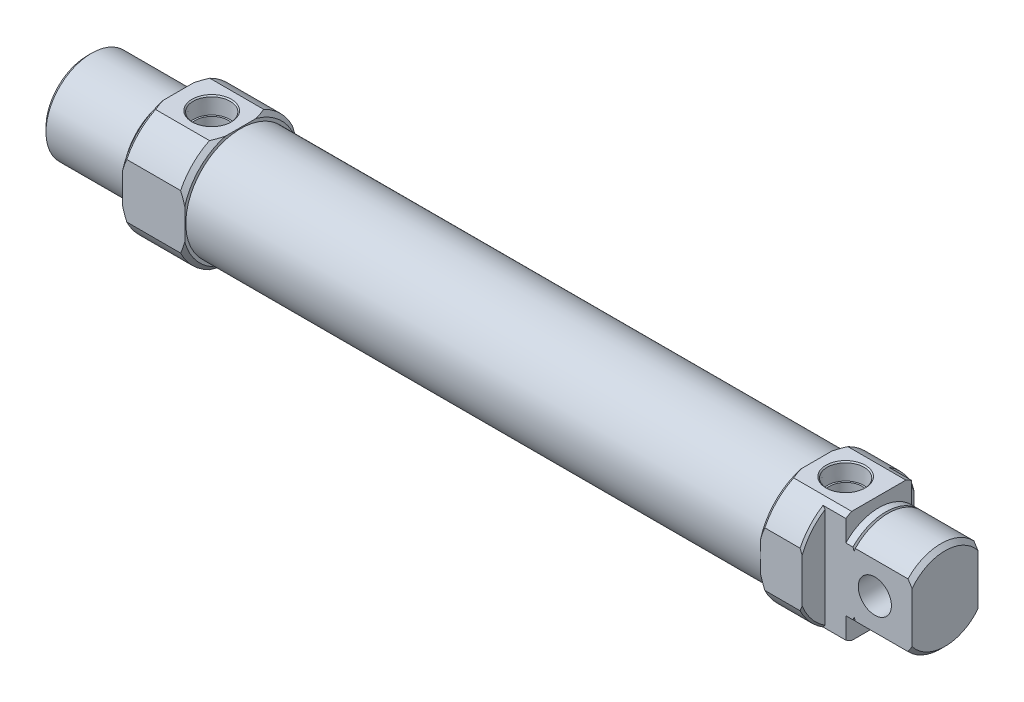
ISO-10303-21;
HEADER;
FILE_DESCRIPTION(('STEP AP214'),'2;1');
FILE_NAME('part.step','',(''),(''),'','','');
FILE_SCHEMA(('AUTOMOTIVE_DESIGN { 1 0 10303 214 1 1 1 1 }'));
ENDSEC;
DATA;
#1=APPLICATION_CONTEXT('core data for automotive mechanical design processes');
#2=APPLICATION_PROTOCOL_DEFINITION('international standard','automotive_design',2000,#1);
#3=PRODUCT_CONTEXT('',#1,'mechanical');
#4=PRODUCT('Part','Part','',(#3));
#5=PRODUCT_RELATED_PRODUCT_CATEGORY('part','',(#4));
#6=PRODUCT_DEFINITION_FORMATION('','',#4);
#7=PRODUCT_DEFINITION_CONTEXT('part definition',#1,'design');
#8=PRODUCT_DEFINITION('design','',#6,#7);
#9=PRODUCT_DEFINITION_SHAPE('','',#8);
#10=(LENGTH_UNIT() NAMED_UNIT(*) SI_UNIT(.MILLI.,.METRE.));
#11=(NAMED_UNIT(*) PLANE_ANGLE_UNIT() SI_UNIT($,.RADIAN.));
#12=(NAMED_UNIT(*) SI_UNIT($,.STERADIAN.) SOLID_ANGLE_UNIT());
#13=UNCERTAINTY_MEASURE_WITH_UNIT(LENGTH_MEASURE(1.E-05),#10,'distance_accuracy_value','');
#14=(GEOMETRIC_REPRESENTATION_CONTEXT(3) GLOBAL_UNCERTAINTY_ASSIGNED_CONTEXT((#13)) GLOBAL_UNIT_ASSIGNED_CONTEXT((#10,
#11,#12)) REPRESENTATION_CONTEXT('',''));
#15=CARTESIAN_POINT('',(0.,0.,0.));
#16=DIRECTION('',(0.,0.,1.));
#17=DIRECTION('',(1.,0.,0.));
#18=AXIS2_PLACEMENT_3D('',#15,#16,#17);
#19=CARTESIAN_POINT('',(154.,12.65,-12.65));
#20=DIRECTION('',(-1.,0.,0.));
#21=DIRECTION('',(0.,-1.,0.));
#22=AXIS2_PLACEMENT_3D('',#19,#20,#21);
#23=PLANE('',#22);
#24=CARTESIAN_POINT('',(154.,0.,0.));
#25=DIRECTION('',(1.,0.,0.));
#26=DIRECTION('',(0.,0.,-1.));
#27=AXIS2_PLACEMENT_3D('',#24,#25,#26);
#28=CIRCLE('',#27,12.5);
#29=CARTESIAN_POINT('',(154.,0.,-12.5));
#30=VERTEX_POINT('',#29);
#31=EDGE_CURVE('E21',#30,#30,#28,.T.);
#32=ORIENTED_EDGE('',*,*,#31,.F.);
#33=EDGE_LOOP('',(#32));
#34=FACE_BOUND('',#33,.T.);
#35=ADVANCED_FACE('F16',(#34),#23,.T.);
#36=CARTESIAN_POINT('',(15.,0.,0.));
#37=DIRECTION('',(1.,0.,0.));
#38=DIRECTION('',(0.,0.,-1.));
#39=AXIS2_PLACEMENT_3D('',#36,#37,#38);
#40=CYLINDRICAL_SURFACE('',#39,12.5);
#41=ORIENTED_EDGE('',*,*,#31,.T.);
#42=EDGE_LOOP('',(#41));
#43=FACE_BOUND('',#42,.T.);
#44=CARTESIAN_POINT('',(15.,0.,0.));
#45=DIRECTION('',(1.,0.,0.));
#46=DIRECTION('',(0.,0.,-1.));
#47=AXIS2_PLACEMENT_3D('',#44,#45,#46);
#48=CIRCLE('',#47,12.5);
#49=CARTESIAN_POINT('',(15.,0.,-12.5));
#50=VERTEX_POINT('',#49);
#51=EDGE_CURVE('E1763',#50,#50,#48,.T.);
#52=ORIENTED_EDGE('',*,*,#51,.F.);
#53=EDGE_LOOP('',(#52));
#54=FACE_BOUND('',#53,.T.);
#55=ADVANCED_FACE('F1063',(#43,#54),#40,.F.);
#56=CARTESIAN_POINT('',(-22.,10.12,-10.12));
#57=DIRECTION('',(-1.,0.,0.));
#58=DIRECTION('',(0.,-1.,0.));
#59=AXIS2_PLACEMENT_3D('',#56,#57,#58);
#60=PLANE('',#59);
#61=CARTESIAN_POINT('',(-22.,0.,0.));
#62=DIRECTION('',(1.,0.,0.));
#63=DIRECTION('',(0.,0.,-1.));
#64=AXIS2_PLACEMENT_3D('',#61,#62,#63);
#65=CIRCLE('',#64,5.);
#66=CARTESIAN_POINT('',(-22.,0.,-5.));
#67=VERTEX_POINT('',#66);
#68=EDGE_CURVE('E1758',#67,#67,#65,.F.);
#69=ORIENTED_EDGE('',*,*,#68,.F.);
#70=EDGE_LOOP('',(#69));
#71=FACE_BOUND('',#70,.T.);
#72=CARTESIAN_POINT('',(-22.,0.,0.));
#73=DIRECTION('',(1.,0.,0.));
#74=DIRECTION('',(0.,0.,-1.));
#75=AXIS2_PLACEMENT_3D('',#72,#73,#74);
#76=CIRCLE('',#75,10.);
#77=CARTESIAN_POINT('',(-22.,0.,-10.));
#78=VERTEX_POINT('',#77);
#79=EDGE_CURVE('E1761',#78,#78,#76,.F.);
#80=ORIENTED_EDGE('',*,*,#79,.T.);
#81=EDGE_LOOP('',(#80));
#82=FACE_BOUND('',#81,.T.);
#83=ADVANCED_FACE('F1065',(#71,#82),#60,.T.);
#84=CARTESIAN_POINT('',(15.,-12.65,-12.65));
#85=DIRECTION('',(1.,0.,0.));
#86=DIRECTION('',(0.,1.,0.));
#87=AXIS2_PLACEMENT_3D('',#84,#85,#86);
#88=PLANE('',#87);
#89=CARTESIAN_POINT('',(15.,0.,0.));
#90=DIRECTION('',(1.,0.,0.));
#91=DIRECTION('',(0.,0.,-1.));
#92=AXIS2_PLACEMENT_3D('',#89,#90,#91);
#93=CIRCLE('',#92,5.);
#94=CARTESIAN_POINT('',(15.,0.,-5.));
#95=VERTEX_POINT('',#94);
#96=EDGE_CURVE('E373',#95,#95,#93,.T.);
#97=ORIENTED_EDGE('',*,*,#96,.F.);
#98=EDGE_LOOP('',(#97));
#99=FACE_BOUND('',#98,.T.);
#100=ORIENTED_EDGE('',*,*,#51,.T.);
#101=EDGE_LOOP('',(#100));
#102=FACE_BOUND('',#101,.T.);
#103=ADVANCED_FACE('F1068',(#99,#102),#88,.T.);
#104=CARTESIAN_POINT('',(-22.,0.,0.));
#105=DIRECTION('',(1.,0.,0.));
#106=DIRECTION('',(0.,0.,-1.));
#107=AXIS2_PLACEMENT_3D('',#104,#105,#106);
#108=CONICAL_SURFACE('',#107,10.,0.785398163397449);
#109=ORIENTED_EDGE('',*,*,#79,.F.);
#110=EDGE_LOOP('',(#109));
#111=FACE_BOUND('',#110,.T.);
#112=CARTESIAN_POINT('',(-21.,0.,0.));
#113=DIRECTION('',(1.,0.,0.));
#114=DIRECTION('',(0.,1.,0.));
#115=AXIS2_PLACEMENT_3D('',#112,#113,#114);
#116=CIRCLE('',#115,11.);
#117=CARTESIAN_POINT('',(-21.,11.,0.));
#118=VERTEX_POINT('',#117);
#119=EDGE_CURVE('E371',#118,#118,#116,.F.);
#120=ORIENTED_EDGE('',*,*,#119,.T.);
#121=EDGE_LOOP('',(#120));
#122=FACE_BOUND('',#121,.T.);
#123=ADVANCED_FACE('F1072',(#111,#122),#108,.T.);
#124=CARTESIAN_POINT('',(-22.,0.,0.));
#125=DIRECTION('',(1.,0.,0.));
#126=DIRECTION('',(0.,0.,-1.));
#127=AXIS2_PLACEMENT_3D('',#124,#125,#126);
#128=CYLINDRICAL_SURFACE('',#127,5.);
#129=ORIENTED_EDGE('',*,*,#68,.T.);
#130=EDGE_LOOP('',(#129));
#131=FACE_BOUND('',#130,.T.);
#132=CARTESIAN_POINT('',(7.99999999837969,3.06553421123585,-3.95000000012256));
#133=CARTESIAN_POINT('',(8.07541907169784,3.06553648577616,-3.94999898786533));
#134=CARTESIAN_POINT('',(8.15085703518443,3.06833331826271,-3.94783327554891));
#135=CARTESIAN_POINT('',(8.30110360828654,3.07937100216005,-3.93922774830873));
#136=CARTESIAN_POINT('',(8.37591183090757,3.08761498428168,-3.932785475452));
#137=CARTESIAN_POINT('',(8.59881808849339,3.12002331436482,-3.90720555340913));
#138=CARTESIAN_POINT('',(8.74514096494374,3.15186205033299,-3.88181550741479));
#139=CARTESIAN_POINT('',(9.07790048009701,3.24432547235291,-3.80512333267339));
#140=CARTESIAN_POINT('',(9.26119919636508,3.31103993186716,-3.74796658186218));
#141=CARTESIAN_POINT('',(9.61245876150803,3.46006849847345,-3.61084382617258));
#142=CARTESIAN_POINT('',(9.78037416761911,3.54242674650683,-3.53081294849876));
#143=CARTESIAN_POINT('',(10.0479375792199,3.68556710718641,-3.37988433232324));
#144=CARTESIAN_POINT('',(10.1518544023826,3.74452101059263,-3.3146607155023));
#145=CARTESIAN_POINT('',(10.35283884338,3.86351823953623,-3.17515736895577));
#146=CARTESIAN_POINT('',(10.4499041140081,3.92356192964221,-3.10087455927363));
#147=CARTESIAN_POINT('',(10.6368745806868,4.04295032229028,-2.94351809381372));
#148=CARTESIAN_POINT('',(10.7267875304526,4.10229572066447,-2.8604541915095));
#149=CARTESIAN_POINT('',(10.899183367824,4.21885495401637,-2.6855760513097));
#150=CARTESIAN_POINT('',(10.9816651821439,4.27606848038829,-2.5937605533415));
#151=CARTESIAN_POINT('',(11.1867025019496,4.42091824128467,-2.34253389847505));
#152=CARTESIAN_POINT('',(11.3028913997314,4.50574507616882,-2.17614214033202));
#153=CARTESIAN_POINT('',(11.5105429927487,4.66010939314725,-1.82224652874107));
#154=CARTESIAN_POINT('',(11.6020335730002,4.72966410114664,-1.6347668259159));
#155=CARTESIAN_POINT('',(11.7435420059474,4.83837742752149,-1.27275041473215));
#156=CARTESIAN_POINT('',(11.7978254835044,4.88060018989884,-1.10083757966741));
#157=CARTESIAN_POINT('',(11.8614851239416,4.93035513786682,-0.836463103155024));
#158=CARTESIAN_POINT('',(11.8797378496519,4.94467192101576,-0.747315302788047));
#159=CARTESIAN_POINT('',(11.9101027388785,4.9685322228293,-0.567364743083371));
#160=CARTESIAN_POINT('',(11.922217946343,4.97807810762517,-0.476562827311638));
#161=CARTESIAN_POINT('',(11.9374272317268,4.9900721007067,-0.321391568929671));
#162=CARTESIAN_POINT('',(11.9421376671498,4.99379071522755,-0.257270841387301));
#163=CARTESIAN_POINT('',(11.9484245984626,4.99875514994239,-0.128769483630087));
#164=CARTESIAN_POINT('',(11.9500005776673,5.00000056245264,-0.0643888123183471));
#165=CARTESIAN_POINT('',(11.9499991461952,4.99999916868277,0.0951680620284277));
#166=CARTESIAN_POINT('',(11.9465542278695,4.99727644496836,0.190353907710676));
#167=CARTESIAN_POINT('',(11.9328327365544,4.9864472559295,0.379962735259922));
#168=CARTESIAN_POINT('',(11.9225523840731,4.97833781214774,0.474385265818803));
#169=CARTESIAN_POINT('',(11.8953124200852,4.95690300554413,0.661832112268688));
#170=CARTESIAN_POINT('',(11.8783413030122,4.94356865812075,0.754853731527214));
#171=CARTESIAN_POINT('',(11.838004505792,4.91198777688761,0.938665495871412));
#172=CARTESIAN_POINT('',(11.8146359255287,4.89373901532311,1.02945460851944));
#173=CARTESIAN_POINT('',(11.7358023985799,4.83245401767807,1.29632412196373));
#174=CARTESIAN_POINT('',(11.6713962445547,4.78270827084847,1.46832431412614));
#175=CARTESIAN_POINT('',(11.521865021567,4.66890575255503,1.79771186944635));
#176=CARTESIAN_POINT('',(11.4367405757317,4.60484941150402,1.95509967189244));
#177=CARTESIAN_POINT('',(11.2796722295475,4.48909124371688,2.20460571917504));
#178=CARTESIAN_POINT('',(11.2125805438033,4.44024067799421,2.30118446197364));
#179=CARTESIAN_POINT('',(11.0711084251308,4.3389817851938,2.48684780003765));
#180=CARTESIAN_POINT('',(10.9967281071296,4.28657351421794,2.57593251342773));
#181=CARTESIAN_POINT('',(10.841034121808,4.17920865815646,2.74671084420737));
#182=CARTESIAN_POINT('',(10.7597006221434,4.12424500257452,2.82838185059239));
#183=CARTESIAN_POINT('',(10.5907212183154,4.01313872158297,2.98393146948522));
#184=CARTESIAN_POINT('',(10.5030777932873,3.95699656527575,3.05781311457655));
#185=CARTESIAN_POINT('',(10.3203266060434,3.84397957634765,3.19876525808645));
#186=CARTESIAN_POINT('',(10.2251274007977,3.78710622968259,3.26571845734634));
#187=CARTESIAN_POINT('',(10.0284615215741,3.67499928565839,3.39138160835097));
#188=CARTESIAN_POINT('',(9.9269929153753,3.61976620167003,3.45008900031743));
#189=CARTESIAN_POINT('',(9.71799653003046,3.51297156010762,3.55876626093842));
#190=CARTESIAN_POINT('',(9.61048491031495,3.46140097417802,3.6087580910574));
#191=CARTESIAN_POINT('',(9.3892192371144,3.36415577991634,3.69957790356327));
#192=CARTESIAN_POINT('',(9.27547068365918,3.31847609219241,3.74041380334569));
#193=CARTESIAN_POINT('',(9.0187338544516,3.227740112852,3.81916117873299));
#194=CARTESIAN_POINT('',(8.87437582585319,3.18455050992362,3.85494126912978));
#195=CARTESIAN_POINT('',(8.65273363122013,3.1334314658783,3.89641947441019));
#196=CARTESIAN_POINT('',(8.57810587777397,3.11868004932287,3.90820585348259));
#197=CARTESIAN_POINT('',(8.42748760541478,3.09430781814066,3.92753162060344));
#198=CARTESIAN_POINT('',(8.35149797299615,3.08468378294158,3.93507367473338));
#199=CARTESIAN_POINT('',(8.22946399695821,3.0737728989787,3.94359540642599));
#200=CARTESIAN_POINT('',(8.18366869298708,3.07068965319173,3.94599444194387));
#201=CARTESIAN_POINT('',(8.09191795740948,3.06656934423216,3.94919725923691));
#202=CARTESIAN_POINT('',(8.04596248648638,3.06553282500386,3.95000061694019));
#203=CARTESIAN_POINT('',(7.92458092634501,3.06553648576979,3.94999898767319));
#204=CARTESIAN_POINT('',(7.84914296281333,3.06833331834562,3.94783327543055));
#205=CARTESIAN_POINT('',(7.69889638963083,3.07937100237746,3.93922774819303));
#206=CARTESIAN_POINT('',(7.6240881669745,3.08761498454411,3.93278547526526));
#207=CARTESIAN_POINT('',(7.40118190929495,3.1200233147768,3.90720555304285));
#208=CARTESIAN_POINT('',(7.2548590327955,3.15186205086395,3.88181550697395));
#209=CARTESIAN_POINT('',(6.92209951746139,3.24432547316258,3.80512333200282));
#210=CARTESIAN_POINT('',(6.73880080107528,3.31103993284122,3.74796658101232));
#211=CARTESIAN_POINT('',(6.38754123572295,3.46006849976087,3.61084382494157));
#212=CARTESIAN_POINT('',(6.21962582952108,3.54242674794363,3.53081294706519));
#213=CARTESIAN_POINT('',(5.95206241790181,3.68556710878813,3.37988433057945));
#214=CARTESIAN_POINT('',(5.84814559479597,3.74452101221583,3.31466071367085));
#215=CARTESIAN_POINT('',(5.64716115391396,3.86351824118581,3.17515736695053));
#216=CARTESIAN_POINT('',(5.55009588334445,3.92356193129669,3.1008745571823));
#217=CARTESIAN_POINT('',(5.36312541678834,4.04295032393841,2.94351809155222));
#218=CARTESIAN_POINT('',(5.27321246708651,4.10229572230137,2.86045418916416));
#219=CARTESIAN_POINT('',(5.10081662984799,4.21885495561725,2.68557604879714));
#220=CARTESIAN_POINT('',(5.01833481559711,4.27606848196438,2.59376055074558));
#221=CARTESIAN_POINT('',(4.81329749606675,4.42091824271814,2.34253389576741));
#222=CARTESIAN_POINT('',(4.69710859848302,4.50574507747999,2.17614213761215));
#223=CARTESIAN_POINT('',(4.48945700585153,4.66010939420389,1.82224652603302));
#224=CARTESIAN_POINT('',(4.39796642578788,4.7296641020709,1.63476682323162));
#225=CARTESIAN_POINT('',(4.25645799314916,4.83837742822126,1.27275041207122));
#226=CARTESIAN_POINT('',(4.20217451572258,4.88060019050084,1.10083757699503));
#227=CARTESIAN_POINT('',(4.13851487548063,4.93035513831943,0.836463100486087));
#228=CARTESIAN_POINT('',(4.12026214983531,4.94467192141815,0.747315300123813));
#229=CARTESIAN_POINT('',(4.08989726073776,4.96853222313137,0.567364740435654));
#230=CARTESIAN_POINT('',(4.07778205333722,4.97807810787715,0.476562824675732));
#231=CARTESIAN_POINT('',(4.06257276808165,4.99007210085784,0.321391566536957));
#232=CARTESIAN_POINT('',(4.05786233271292,4.99379071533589,0.257270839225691));
#233=CARTESIAN_POINT('',(4.05157540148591,4.99875514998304,0.128769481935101));
#234=CARTESIAN_POINT('',(4.04999942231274,5.0000005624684,0.0643888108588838));
#235=CARTESIAN_POINT('',(4.05000085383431,4.99999916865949,-0.0951680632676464));
#236=CARTESIAN_POINT('',(4.05344577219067,4.99727644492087,-0.190353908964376));
#237=CARTESIAN_POINT('',(4.06716726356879,4.98644725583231,-0.379962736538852));
#238=CARTESIAN_POINT('',(4.07744761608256,4.97833781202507,-0.474385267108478));
#239=CARTESIAN_POINT('',(4.10468758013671,4.95690300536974,-0.661832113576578));
#240=CARTESIAN_POINT('',(4.12165869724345,4.9435686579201,-0.754853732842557));
#241=CARTESIAN_POINT('',(4.16199549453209,4.91198777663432,-0.938665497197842));
#242=CARTESIAN_POINT('',(4.18536407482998,4.89373901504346,-1.0294546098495));
#243=CARTESIAN_POINT('',(4.26419760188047,4.83245401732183,-1.29632412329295));
#244=CARTESIAN_POINT('',(4.32860375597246,4.78270827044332,-1.46832431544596));
#245=CARTESIAN_POINT('',(4.47813497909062,4.66890575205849,-1.79771187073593));
#246=CARTESIAN_POINT('',(4.56325942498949,4.60484941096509,-1.95509967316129));
#247=CARTESIAN_POINT('',(4.72032777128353,4.4890912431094,-2.20460572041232));
#248=CARTESIAN_POINT('',(4.78741945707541,4.44024067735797,-2.30118446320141));
#249=CARTESIAN_POINT('',(4.92889157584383,4.33898178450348,-2.48684780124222));
#250=CARTESIAN_POINT('',(5.00327189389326,4.28657351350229,-2.57593251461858));
#251=CARTESIAN_POINT('',(5.15896587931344,4.17920865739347,-2.74671084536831));
#252=CARTESIAN_POINT('',(5.24029937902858,4.12424500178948,-2.82838185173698));
#253=CARTESIAN_POINT('',(5.40927878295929,4.01313872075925,-2.98393147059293));
#254=CARTESIAN_POINT('',(5.4969222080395,3.9569965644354,-3.05781311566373));
#255=CARTESIAN_POINT('',(5.67967339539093,3.84397957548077,-3.19876525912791));
#256=CARTESIAN_POINT('',(5.77487260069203,3.78710622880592,-3.26571845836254));
#257=CARTESIAN_POINT('',(5.97153848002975,3.67499928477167,-3.3913816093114));
#258=CARTESIAN_POINT('',(6.07300708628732,3.61976620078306,-3.45008900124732));
#259=CARTESIAN_POINT('',(6.28200347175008,3.51297155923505,-3.55876626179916));
#260=CARTESIAN_POINT('',(6.38951509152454,3.46140097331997,-3.60875809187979));
#261=CARTESIAN_POINT('',(6.61078076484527,3.36415577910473,-3.69957790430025));
#262=CARTESIAN_POINT('',(6.72452931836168,3.31847609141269,-3.74041380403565));
#263=CARTESIAN_POINT('',(6.98126614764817,3.22774011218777,-3.81916117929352));
#264=CARTESIAN_POINT('',(7.12562417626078,3.18455050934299,-3.85494126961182));
#265=CARTESIAN_POINT('',(7.34726637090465,3.13343146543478,-3.89641947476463));
#266=CARTESIAN_POINT('',(7.42189412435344,3.11868004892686,-3.90820585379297));
#267=CARTESIAN_POINT('',(7.57251239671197,3.09430781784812,-3.92753162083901));
#268=CARTESIAN_POINT('',(7.64850202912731,3.08468378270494,-3.93507367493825));
#269=CARTESIAN_POINT('',(7.77053600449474,3.07377289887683,-3.94359540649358));
#270=CARTESIAN_POINT('',(7.81633130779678,3.07068965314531,-3.94599444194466));
#271=CARTESIAN_POINT('',(7.90808204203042,3.06656934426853,-3.94919725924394));
#272=CARTESIAN_POINT('',(7.95403751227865,3.06553282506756,-3.95000061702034));
#273=CARTESIAN_POINT('',(7.99999999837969,3.06553421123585,-3.95000000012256));
#274=B_SPLINE_CURVE_WITH_KNOTS('',3,(#132,#133,#134,#135,#136,#137,#138,#139,#140,#141,#142,
#143,#144,#145,#146,#147,#148,#149,#150,#151,#152,#153,#154,#155,#156,#157,#158,#159,#160,#161,
#162,#163,#164,#165,#166,#167,#168,#169,#170,#171,#172,#173,#174,#175,#176,#177,#178,#179,#180,
#181,#182,#183,#184,#185,#186,#187,#188,#189,#190,#191,#192,#193,#194,#195,#196,#197,#198,#199,
#200,#201,#202,#203,#204,#205,#206,#207,#208,#209,#210,#211,#212,#213,#214,#215,#216,#217,#218,
#219,#220,#221,#222,#223,#224,#225,#226,#227,#228,#229,#230,#231,#232,#233,#234,#235,#236,#237,
#238,#239,#240,#241,#242,#243,#244,#245,#246,#247,#248,#249,#250,#251,#252,#253,#254,#255,#256,
#257,#258,#259,#260,#261,#262,#263,#264,#265,#266,#267,#268,#269,#270,#271,#272,#273),
.UNSPECIFIED.,.T.,.F.,(4,2,2,2,2,2,2,2,2,2,2,2,2,2,2,2,2,2,2,2,2,2,2,2,2,2,2,2,2,2,2,2,2,2,2,2,
2,2,2,2,2,2,2,2,2,2,2,2,2,2,2,2,2,2,2,2,2,2,2,2,2,2,2,2,2,2,2,2,2,2,4),(0.,0.226204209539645,
0.452538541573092,0.905966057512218,1.51249666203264,2.12076479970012,2.52868506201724,
2.93674439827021,3.34435515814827,3.75202469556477,4.40917887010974,5.06558796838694,
5.61844588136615,5.894509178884,6.17043542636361,6.3635227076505,6.55664181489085,
6.84207605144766,7.12766824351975,7.41375370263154,7.69996906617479,8.26812571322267,
8.83626527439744,9.21782345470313,9.59937561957,9.98205490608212,10.3645846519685,
10.7527890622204,11.141113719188,11.5284452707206,11.915440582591,12.3780709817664,
12.6087661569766,12.8393162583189,12.9771347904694,13.1149899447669,13.3411941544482,
13.5675284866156,14.0209560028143,14.6274866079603,15.2357547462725,15.6436750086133,
16.0517343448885,16.4593451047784,16.8670146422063,17.5241688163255,18.1805779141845,
18.7334358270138,19.0094991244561,19.2854253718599,19.4785126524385,19.6716317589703,
19.9570659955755,20.2426581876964,20.5287436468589,20.814959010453,21.3831156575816,
21.9512552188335,22.332813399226,22.7143655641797,23.0970448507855,23.4795745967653,
23.8677790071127,24.2561036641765,24.6434352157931,25.0304305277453,25.4930609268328,
25.7237561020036,25.9543062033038,26.0921247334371,26.2299798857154),.UNSPECIFIED.);
#275=CARTESIAN_POINT('',(7.99999999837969,3.06553421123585,-3.95000000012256));
#276=VERTEX_POINT('',#275);
#277=EDGE_CURVE('E370',#276,#276,#274,.T.);
#278=ORIENTED_EDGE('',*,*,#277,.F.);
#279=EDGE_LOOP('',(#278));
#280=FACE_BOUND('',#279,.T.);
#281=ORIENTED_EDGE('',*,*,#96,.T.);
#282=EDGE_LOOP('',(#281));
#283=FACE_BOUND('',#282,.T.);
#284=ADVANCED_FACE('F1684',(#131,#280,#283),#128,.F.);
#285=CARTESIAN_POINT('',(-21.,0.,0.));
#286=DIRECTION('',(1.,0.,0.));
#287=DIRECTION('',(0.,0.,-1.));
#288=AXIS2_PLACEMENT_3D('',#285,#286,#287);
#289=CYLINDRICAL_SURFACE('',#288,11.);
#290=ORIENTED_EDGE('',*,*,#119,.F.);
#291=EDGE_LOOP('',(#290));
#292=FACE_BOUND('',#291,.T.);
#293=CARTESIAN_POINT('',(-2.28867513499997,0.,0.));
#294=DIRECTION('',(-1.,0.,0.));
#295=DIRECTION('',(0.,-1.,0.));
#296=AXIS2_PLACEMENT_3D('',#293,#294,#295);
#297=CIRCLE('',#296,11.);
#298=CARTESIAN_POINT('',(-2.288675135,-11.,0.));
#299=VERTEX_POINT('',#298);
#300=EDGE_CURVE('E367',#299,#299,#297,.T.);
#301=ORIENTED_EDGE('',*,*,#300,.T.);
#302=EDGE_LOOP('',(#301));
#303=FACE_BOUND('',#302,.T.);
#304=ADVANCED_FACE('F1675',(#292,#303),#289,.T.);
#305=CARTESIAN_POINT('',(8.,3.026927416,0.));
#306=DIRECTION('',(0.,1.,0.));
#307=DIRECTION('',(-1.,0.,0.));
#308=AXIS2_PLACEMENT_3D('',#305,#306,#307);
#309=CYLINDRICAL_SURFACE('',#308,3.95);
#310=ORIENTED_EDGE('',*,*,#277,.T.);
#311=EDGE_LOOP('',(#310));
#312=FACE_BOUND('',#311,.T.);
#313=CARTESIAN_POINT('',(8.,9.5,0.));
#314=DIRECTION('',(0.,1.,0.));
#315=DIRECTION('',(-1.,0.,0.));
#316=AXIS2_PLACEMENT_3D('',#313,#314,#315);
#317=CIRCLE('',#316,3.95);
#318=CARTESIAN_POINT('',(4.05,9.5,0.));
#319=VERTEX_POINT('',#318);
#320=EDGE_CURVE('E366',#319,#319,#317,.T.);
#321=ORIENTED_EDGE('',*,*,#320,.T.);
#322=EDGE_LOOP('',(#321));
#323=FACE_BOUND('',#322,.T.);
#324=ADVANCED_FACE('F1666',(#312,#323),#309,.F.);
#325=CARTESIAN_POINT('',(-2.,0.,0.));
#326=DIRECTION('',(-1.,0.,0.));
#327=DIRECTION('',(0.,0.,1.));
#328=AXIS2_PLACEMENT_3D('',#325,#326,#327);
#329=CONICAL_SURFACE('',#328,10.5,1.04719755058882);
#330=CARTESIAN_POINT('',(-2.,0.,0.));
#331=DIRECTION('',(1.,0.,0.));
#332=DIRECTION('',(0.,1.,0.));
#333=AXIS2_PLACEMENT_3D('',#330,#331,#332);
#334=CIRCLE('',#333,10.5);
#335=CARTESIAN_POINT('',(-2.,10.5,0.));
#336=VERTEX_POINT('',#335);
#337=EDGE_CURVE('E363',#336,#336,#334,.F.);
#338=ORIENTED_EDGE('',*,*,#337,.T.);
#339=EDGE_LOOP('',(#338));
#340=FACE_BOUND('',#339,.T.);
#341=ORIENTED_EDGE('',*,*,#300,.F.);
#342=EDGE_LOOP('',(#341));
#343=FACE_BOUND('',#342,.T.);
#344=ADVANCED_FACE('F1077',(#340,#343),#329,.T.);
#345=CARTESIAN_POINT('',(3.596464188,9.5,4.403535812));
#346=DIRECTION('',(0.,-1.,0.));
#347=DIRECTION('',(0.,0.,-1.));
#348=AXIS2_PLACEMENT_3D('',#345,#346,#347);
#349=PLANE('',#348);
#350=ORIENTED_EDGE('',*,*,#320,.F.);
#351=EDGE_LOOP('',(#350));
#352=FACE_BOUND('',#351,.T.);
#353=CARTESIAN_POINT('',(8.,9.49999999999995,0.));
#354=DIRECTION('',(0.,1.,0.));
#355=DIRECTION('',(0.,0.,1.));
#356=AXIS2_PLACEMENT_3D('',#353,#354,#355);
#357=CIRCLE('',#356,4.351319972);
#358=CARTESIAN_POINT('',(8.,9.49999999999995,4.351319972));
#359=VERTEX_POINT('',#358);
#360=EDGE_CURVE('E362',#359,#359,#357,.F.);
#361=ORIENTED_EDGE('',*,*,#360,.F.);
#362=EDGE_LOOP('',(#361));
#363=FACE_BOUND('',#362,.T.);
#364=ADVANCED_FACE('F1074',(#352,#363),#349,.F.);
#365=CARTESIAN_POINT('',(-2.,0.,0.));
#366=DIRECTION('',(1.,0.,0.));
#367=DIRECTION('',(0.,0.,-1.));
#368=AXIS2_PLACEMENT_3D('',#365,#366,#367);
#369=CONICAL_SURFACE('',#368,10.5,1.04719755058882);
#370=ORIENTED_EDGE('',*,*,#337,.F.);
#371=EDGE_LOOP('',(#370));
#372=FACE_BOUND('',#371,.T.);
#373=CARTESIAN_POINT('',(-1.711324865,0.,0.));
#374=DIRECTION('',(1.,0.,0.));
#375=DIRECTION('',(0.,1.,0.));
#376=AXIS2_PLACEMENT_3D('',#373,#374,#375);
#377=CIRCLE('',#376,11.);
#378=CARTESIAN_POINT('',(-1.711324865,11.,0.));
#379=VERTEX_POINT('',#378);
#380=EDGE_CURVE('E333',#379,#379,#377,.F.);
#381=ORIENTED_EDGE('',*,*,#380,.T.);
#382=EDGE_LOOP('',(#381));
#383=FACE_BOUND('',#382,.T.);
#384=ADVANCED_FACE('F1076',(#372,#383),#369,.T.);
#385=CARTESIAN_POINT('',(8.,9.5,0.));
#386=DIRECTION('',(0.,1.,0.));
#387=DIRECTION('',(0.,0.,1.));
#388=AXIS2_PLACEMENT_3D('',#385,#386,#387);
#389=CONICAL_SURFACE('',#388,4.351319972,0.0312064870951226);
#390=ORIENTED_EDGE('',*,*,#360,.T.);
#391=EDGE_LOOP('',(#390));
#392=FACE_BOUND('',#391,.T.);
#393=CARTESIAN_POINT('',(8.,13.2173635,0.));
#394=DIRECTION('',(0.,1.,0.));
#395=DIRECTION('',(0.,0.,1.));
#396=AXIS2_PLACEMENT_3D('',#393,#394,#395);
#397=CIRCLE('',#396,4.4673635);
#398=CARTESIAN_POINT('',(8.,13.2173635,4.4673635));
#399=VERTEX_POINT('',#398);
#400=EDGE_CURVE('E355',#399,#399,#397,.F.);
#401=ORIENTED_EDGE('',*,*,#400,.F.);
#402=EDGE_LOOP('',(#401));
#403=FACE_BOUND('',#402,.T.);
#404=ADVANCED_FACE('F1638',(#392,#403),#389,.F.);
#405=CARTESIAN_POINT('',(-1.711324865,0.,0.));
#406=DIRECTION('',(1.,0.,0.));
#407=DIRECTION('',(0.,0.,-1.));
#408=AXIS2_PLACEMENT_3D('',#405,#406,#407);
#409=CYLINDRICAL_SURFACE('',#408,11.);
#410=ORIENTED_EDGE('',*,*,#380,.F.);
#411=EDGE_LOOP('',(#410));
#412=FACE_BOUND('',#411,.T.);
#413=CARTESIAN_POINT('',(0.,0.,0.));
#414=DIRECTION('',(1.,0.,0.));
#415=DIRECTION('',(0.,0.,-1.));
#416=AXIS2_PLACEMENT_3D('',#413,#414,#415);
#417=CIRCLE('',#416,11.);
#418=CARTESIAN_POINT('',(0.,0.,-11.));
#419=VERTEX_POINT('',#418);
#420=EDGE_CURVE('E1089',#419,#419,#417,.T.);
#421=ORIENTED_EDGE('',*,*,#420,.F.);
#422=EDGE_LOOP('',(#421));
#423=FACE_BOUND('',#422,.T.);
#424=ADVANCED_FACE('F593',(#412,#423),#409,.T.);
#425=CARTESIAN_POINT('',(171.,0.,0.));
#426=DIRECTION('',(-1.,0.,0.));
#427=DIRECTION('',(0.,0.,1.));
#428=AXIS2_PLACEMENT_3D('',#425,#426,#427);
#429=CONICAL_SURFACE('',#428,10.5,1.04719755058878);
#430=CARTESIAN_POINT('',(170.999999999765,-6.8591180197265,-7.95));
#431=CARTESIAN_POINT('',(170.953064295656,-6.98346655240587,-7.95));
#432=CARTESIAN_POINT('',(170.90554016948,-7.10758657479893,-7.95));
#433=CARTESIAN_POINT('',(170.809315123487,-7.35536946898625,-7.95));
#434=CARTESIAN_POINT('',(170.760614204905,-7.47903234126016,-7.95));
#435=CARTESIAN_POINT('',(170.711324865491,-7.6024667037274,-7.95));
#436=B_SPLINE_CURVE_WITH_KNOTS('',3,(#430,#431,#432,#433,#434,#435),.UNSPECIFIED.,.F.,.F.,(4,2,
4),(0.,0.398721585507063,0.797442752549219),.UNSPECIFIED.);
#437=CARTESIAN_POINT('',(170.999999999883,-6.85911801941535,-7.95));
#438=VERTEX_POINT('',#437);
#439=CARTESIAN_POINT('',(170.711324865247,-7.60246670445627,-7.9499999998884));
#440=VERTEX_POINT('',#439);
#441=EDGE_CURVE('E332',#438,#440,#436,.T.);
#442=ORIENTED_EDGE('',*,*,#441,.F.);
#443=CARTESIAN_POINT('',(171.,0.,0.));
#444=DIRECTION('',(1.,0.,0.));
#445=DIRECTION('',(0.,1.,0.));
#446=AXIS2_PLACEMENT_3D('',#443,#444,#445);
#447=CIRCLE('',#446,10.5);
#448=CARTESIAN_POINT('',(171.000000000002,-6.85911801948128,7.95));
#449=VERTEX_POINT('',#448);
#450=EDGE_CURVE('E337',#438,#449,#447,.F.);
#451=ORIENTED_EDGE('',*,*,#450,.T.);
#452=CARTESIAN_POINT('',(170.711324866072,-7.60246670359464,7.95000000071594));
#453=CARTESIAN_POINT('',(170.760614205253,-7.47903234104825,7.95000000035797));
#454=CARTESIAN_POINT('',(170.809315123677,-7.35536946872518,7.95000000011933));
#455=CARTESIAN_POINT('',(170.905540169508,-7.10758657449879,7.94999999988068));
#456=CARTESIAN_POINT('',(170.953064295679,-6.98346655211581,7.94999999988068));
#457=CARTESIAN_POINT('',(170.99999999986,-6.85911801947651,7.95));
#458=B_SPLINE_CURVE_WITH_KNOTS('',3,(#452,#453,#454,#455,#456,#457),.UNSPECIFIED.,.F.,.F.,(4,2,
4),(0.,0.398721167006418,0.79744275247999),.UNSPECIFIED.);
#459=CARTESIAN_POINT('',(170.711324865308,-7.60246670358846,7.95000000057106));
#460=VERTEX_POINT('',#459);
#461=EDGE_CURVE('E322',#460,#449,#458,.T.);
#462=ORIENTED_EDGE('',*,*,#461,.F.);
#463=CARTESIAN_POINT('',(170.711324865,0.,0.));
#464=DIRECTION('',(1.,0.,0.));
#465=DIRECTION('',(0.,1.,0.));
#466=AXIS2_PLACEMENT_3D('',#463,#464,#465);
#467=CIRCLE('',#466,11.);
#468=EDGE_CURVE('E317',#460,#440,#467,.T.);
#469=ORIENTED_EDGE('',*,*,#468,.T.);
#470=EDGE_LOOP('',(#442,#451,#462,#469));
#471=FACE_BOUND('',#470,.T.);
#472=ADVANCED_FACE('F343',(#471),#429,.T.);
#473=CARTESIAN_POINT('',(0.,0.,0.));
#474=DIRECTION('',(1.,0.,0.));
#475=DIRECTION('',(0.,0.,-1.));
#476=AXIS2_PLACEMENT_3D('',#473,#474,#475);
#477=CONICAL_SURFACE('',#476,14.,0.785398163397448);
#478=CARTESIAN_POINT('',(0.,0.,0.));
#479=DIRECTION('',(1.,0.,0.));
#480=DIRECTION('',(0.,0.,-1.));
#481=AXIS2_PLACEMENT_3D('',#478,#479,#480);
#482=CIRCLE('',#481,14.);
#483=CARTESIAN_POINT('',(-5.6887261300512E-10,-3.70809924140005,-13.5));
#484=VERTEX_POINT('',#483);
#485=CARTESIAN_POINT('',(0.,-13.5,-3.70809924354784));
#486=VERTEX_POINT('',#485);
#487=EDGE_CURVE('E1093',#484,#486,#482,.F.);
#488=ORIENTED_EDGE('',*,*,#487,.F.);
#489=CARTESIAN_POINT('',(-1.14449613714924E-09,-3.70809923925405,-13.5000000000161));
#490=CARTESIAN_POINT('',(0.0641614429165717,-3.95035855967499,-13.5000000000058));
#491=CARTESIAN_POINT('',(0.13378470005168,-4.19112970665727,-13.5000000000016));
#492=CARTESIAN_POINT('',(0.282865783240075,-4.6692328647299,-13.4999999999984));
#493=CARTESIAN_POINT('',(0.36230926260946,-4.90656933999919,-13.4999999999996));
#494=CARTESIAN_POINT('',(0.530118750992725,-5.3780014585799,-13.5000000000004));
#495=CARTESIAN_POINT('',(0.618483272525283,-5.61209763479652,-13.5000000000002));
#496=CARTESIAN_POINT('',(0.803368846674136,-6.07744393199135,-13.4999999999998));
#497=CARTESIAN_POINT('',(0.899901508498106,-6.30868944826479,-13.4999999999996));
#498=CARTESIAN_POINT('',(0.999999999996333,-6.5383484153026,-13.5));
#499=B_SPLINE_CURVE_WITH_KNOTS('',3,(#489,#490,#491,#492,#493,#494,#495,#496,#497,#498),
.UNSPECIFIED.,.F.,.F.,(4,2,2,2,4),(0.,0.751713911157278,1.5023423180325,2.25284577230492,
3.00443441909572),.UNSPECIFIED.);
#500=CARTESIAN_POINT('',(0.999999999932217,-6.53834841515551,-13.5));
#501=VERTEX_POINT('',#500);
#502=EDGE_CURVE('E611',#484,#501,#499,.T.);
#503=ORIENTED_EDGE('',*,*,#502,.T.);
#504=CARTESIAN_POINT('',(1.,0.,0.));
#505=DIRECTION('',(1.,0.,0.));
#506=DIRECTION('',(0.,1.,0.));
#507=AXIS2_PLACEMENT_3D('',#504,#505,#506);
#508=CIRCLE('',#507,15.);
#509=CARTESIAN_POINT('',(1.00000000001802,-13.5,-6.53834841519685));
#510=VERTEX_POINT('',#509);
#511=EDGE_CURVE('E564',#501,#510,#508,.F.);
#512=ORIENTED_EDGE('',*,*,#511,.T.);
#513=CARTESIAN_POINT('',(1.00000000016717,-13.4999999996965,-6.53834841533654));
#514=CARTESIAN_POINT('',(0.899901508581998,-13.4999999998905,-6.30868944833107));
#515=CARTESIAN_POINT('',(0.80336884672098,-13.4999999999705,-6.07744393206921));
#516=CARTESIAN_POINT('',(0.618483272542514,-13.5000000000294,-5.61209763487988));
#517=CARTESIAN_POINT('',(0.530118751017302,-13.5000000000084,-5.37800145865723));
#518=CARTESIAN_POINT('',(0.362309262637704,-13.4999999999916,-4.90656934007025));
#519=CARTESIAN_POINT('',(0.282865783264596,-13.4999999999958,-4.66923286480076));
#520=CARTESIAN_POINT('',(0.133784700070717,-13.5000000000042,-4.19112970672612));
#521=CARTESIAN_POINT('',(0.0641614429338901,-13.5000000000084,-3.95035855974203));
#522=CARTESIAN_POINT('',(-1.12080765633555E-09,-13.5,-3.70809923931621));
#523=B_SPLINE_CURVE_WITH_KNOTS('',3,(#513,#514,#515,#516,#517,#518,#519,#520,#521,#522),
.UNSPECIFIED.,.F.,.F.,(4,2,2,2,4),(0.,0.751588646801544,1.50209210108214,2.25272050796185,
3.00443441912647),.UNSPECIFIED.);
#524=EDGE_CURVE('E603',#510,#486,#523,.T.);
#525=ORIENTED_EDGE('',*,*,#524,.T.);
#526=EDGE_LOOP('',(#488,#503,#512,#525));
#527=FACE_BOUND('',#526,.T.);
#528=ADVANCED_FACE('F592',(#527),#477,.T.);
#529=CARTESIAN_POINT('',(1.,0.,0.));
#530=DIRECTION('',(1.,0.,0.));
#531=DIRECTION('',(0.,0.,-1.));
#532=AXIS2_PLACEMENT_3D('',#529,#530,#531);
#533=CYLINDRICAL_SURFACE('',#532,15.);
#534=ORIENTED_EDGE('',*,*,#511,.F.);
#535=DIRECTION('',(1.,0.,0.));
#536=VECTOR('',#535,1.);
#537=CARTESIAN_POINT('',(7.5,-6.538348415,-13.5));
#538=LINE('',#537,#536);
#539=CARTESIAN_POINT('',(13.9999999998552,-6.5383484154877,-13.5));
#540=VERTEX_POINT('',#539);
#541=EDGE_CURVE('E618',#501,#540,#538,.T.);
#542=ORIENTED_EDGE('',*,*,#541,.T.);
#543=CARTESIAN_POINT('',(14.,0.,0.));
#544=DIRECTION('',(-1.,0.,0.));
#545=DIRECTION('',(0.,-1.,0.));
#546=AXIS2_PLACEMENT_3D('',#543,#544,#545);
#547=CIRCLE('',#546,15.);
#548=CARTESIAN_POINT('',(13.9999999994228,-13.5,-6.53834841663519));
#549=VERTEX_POINT('',#548);
#550=EDGE_CURVE('E565',#540,#549,#547,.T.);
#551=ORIENTED_EDGE('',*,*,#550,.T.);
#552=DIRECTION('',(-1.,0.,0.));
#553=VECTOR('',#552,1.);
#554=CARTESIAN_POINT('',(7.5,-13.5,-6.538348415));
#555=LINE('',#554,#553);
#556=EDGE_CURVE('E1198',#549,#510,#555,.T.);
#557=ORIENTED_EDGE('',*,*,#556,.T.);
#558=EDGE_LOOP('',(#534,#542,#551,#557));
#559=FACE_BOUND('',#558,.T.);
#560=ADVANCED_FACE('F599',(#559),#533,.T.);
#561=CARTESIAN_POINT('',(0.,0.,0.));
#562=DIRECTION('',(1.,0.,0.));
#563=DIRECTION('',(0.,0.,-1.));
#564=AXIS2_PLACEMENT_3D('',#561,#562,#563);
#565=CONICAL_SURFACE('',#564,14.,0.785398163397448);
#566=CARTESIAN_POINT('',(1.,0.,0.));
#567=DIRECTION('',(1.,0.,0.));
#568=DIRECTION('',(0.,1.,0.));
#569=AXIS2_PLACEMENT_3D('',#566,#567,#568);
#570=CIRCLE('',#569,15.);
#571=CARTESIAN_POINT('',(0.999999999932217,13.5,-6.53834841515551));
#572=VERTEX_POINT('',#571);
#573=CARTESIAN_POINT('',(1.0000000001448,6.5383484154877,-13.5));
#574=VERTEX_POINT('',#573);
#575=EDGE_CURVE('E359',#572,#574,#570,.F.);
#576=ORIENTED_EDGE('',*,*,#575,.T.);
#577=CARTESIAN_POINT('',(1.00000000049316,6.53834841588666,-13.4999999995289));
#578=CARTESIAN_POINT('',(0.899901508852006,6.30868944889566,-13.49999999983));
#579=CARTESIAN_POINT('',(0.803368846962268,6.07744393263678,-13.4999999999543));
#580=CARTESIAN_POINT('',(0.618483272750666,5.61209763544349,-13.5000000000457));
#581=CARTESIAN_POINT('',(0.530118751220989,5.37800145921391,-13.5000000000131));
#582=CARTESIAN_POINT('',(0.36230926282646,4.90656934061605,-13.4999999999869));
#583=CARTESIAN_POINT('',(0.282865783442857,4.66923286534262,-13.4999999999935));
#584=CARTESIAN_POINT('',(0.133784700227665,4.19112970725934,-13.5000000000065));
#585=CARTESIAN_POINT('',(0.0641614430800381,3.95035856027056,-13.5000000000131));
#586=CARTESIAN_POINT('',(-9.82446094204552E-10,3.70809923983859,-13.5));
#587=B_SPLINE_CURVE_WITH_KNOTS('',3,(#577,#578,#579,#580,#581,#582,#583,#584,#585,#586),
.UNSPECIFIED.,.F.,.F.,(4,2,2,2,4),(0.,0.751588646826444,1.50209210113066,2.25272050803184,
3.00443441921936),.UNSPECIFIED.);
#588=CARTESIAN_POINT('',(0.,3.70809924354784,-13.5));
#589=VERTEX_POINT('',#588);
#590=EDGE_CURVE('E625',#574,#589,#587,.T.);
#591=ORIENTED_EDGE('',*,*,#590,.T.);
#592=CARTESIAN_POINT('',(0.,0.,0.));
#593=DIRECTION('',(1.,0.,0.));
#594=DIRECTION('',(0.,0.,-1.));
#595=AXIS2_PLACEMENT_3D('',#592,#593,#594);
#596=CIRCLE('',#595,14.);
#597=CARTESIAN_POINT('',(-3.03276519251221E-10,13.5,-3.70809924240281));
#598=VERTEX_POINT('',#597);
#599=EDGE_CURVE('E1096',#598,#589,#596,.F.);
#600=ORIENTED_EDGE('',*,*,#599,.F.);
#601=CARTESIAN_POINT('',(-6.06552744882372E-10,13.5,-3.70809924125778));
#602=CARTESIAN_POINT('',(0.0641614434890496,13.5,-3.95035856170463));
#603=CARTESIAN_POINT('',(0.133784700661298,13.5,-4.19112970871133));
#604=CARTESIAN_POINT('',(0.28286578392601,13.5,-4.6692328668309));
#605=CARTESIAN_POINT('',(0.362309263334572,13.5,-4.90656934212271));
#606=CARTESIAN_POINT('',(0.530118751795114,13.5,-5.37800146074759));
#607=CARTESIAN_POINT('',(0.618483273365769,13.5,-5.61209763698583));
#608=CARTESIAN_POINT('',(0.803368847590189,13.5,-6.07744393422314));
#609=CARTESIAN_POINT('',(0.899901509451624,13.5,-6.30868945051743));
#610=CARTESIAN_POINT('',(1.00000000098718,13.5,-6.53834841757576));
#611=B_SPLINE_CURVE_WITH_KNOTS('',3,(#601,#602,#603,#604,#605,#606,#607,#608,#609,#610),
.UNSPECIFIED.,.F.,.F.,(4,2,2,2,4),(0.,0.751713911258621,1.5023423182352,2.25284577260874,
3.00443441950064),.UNSPECIFIED.);
#612=EDGE_CURVE('E678',#598,#572,#611,.T.);
#613=ORIENTED_EDGE('',*,*,#612,.T.);
#614=EDGE_LOOP('',(#576,#591,#600,#613));
#615=FACE_BOUND('',#614,.T.);
#616=ADVANCED_FACE('F684',(#615),#565,.T.);
#617=CARTESIAN_POINT('',(1.,0.,0.));
#618=DIRECTION('',(1.,0.,0.));
#619=DIRECTION('',(0.,0.,-1.));
#620=AXIS2_PLACEMENT_3D('',#617,#618,#619);
#621=CYLINDRICAL_SURFACE('',#620,15.);
#622=CARTESIAN_POINT('',(14.,0.,0.));
#623=DIRECTION('',(-1.,0.,0.));
#624=DIRECTION('',(0.,-1.,0.));
#625=AXIS2_PLACEMENT_3D('',#622,#623,#624);
#626=CIRCLE('',#625,15.);
#627=CARTESIAN_POINT('',(13.999999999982,13.5,-6.53834841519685));
#628=VERTEX_POINT('',#627);
#629=CARTESIAN_POINT('',(14.0000000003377,6.53834841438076,-13.5));
#630=VERTEX_POINT('',#629);
#631=EDGE_CURVE('E558',#628,#630,#626,.T.);
#632=ORIENTED_EDGE('',*,*,#631,.T.);
#633=DIRECTION('',(-1.,0.,0.));
#634=VECTOR('',#633,1.);
#635=CARTESIAN_POINT('',(7.5,6.538348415,-13.5));
#636=LINE('',#635,#634);
#637=EDGE_CURVE('E1101',#630,#574,#636,.T.);
#638=ORIENTED_EDGE('',*,*,#637,.T.);
#639=ORIENTED_EDGE('',*,*,#575,.F.);
#640=DIRECTION('',(1.,0.,0.));
#641=VECTOR('',#640,1.);
#642=CARTESIAN_POINT('',(7.5,13.5,-6.538348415));
#643=LINE('',#642,#641);
#644=EDGE_CURVE('E676',#572,#628,#643,.T.);
#645=ORIENTED_EDGE('',*,*,#644,.T.);
#646=EDGE_LOOP('',(#632,#638,#639,#645));
#647=FACE_BOUND('',#646,.T.);
#648=ADVANCED_FACE('F688',(#647),#621,.T.);
#649=CARTESIAN_POINT('',(8.,13.2173635,0.));
#650=DIRECTION('',(0.,1.,0.));
#651=DIRECTION('',(0.,0.,1.));
#652=AXIS2_PLACEMENT_3D('',#649,#650,#651);
#653=CONICAL_SURFACE('',#652,4.4673635,0.785398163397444);
#654=ORIENTED_EDGE('',*,*,#400,.T.);
#655=EDGE_LOOP('',(#654));
#656=FACE_BOUND('',#655,.T.);
#657=CARTESIAN_POINT('',(8.,13.5,0.));
#658=DIRECTION('',(0.,1.,0.));
#659=DIRECTION('',(0.,0.,1.));
#660=AXIS2_PLACEMENT_3D('',#657,#658,#659);
#661=CIRCLE('',#660,4.74999999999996);
#662=CARTESIAN_POINT('',(8.,13.5,4.74999999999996));
#663=VERTEX_POINT('',#662);
#664=EDGE_CURVE('E551',#663,#663,#661,.T.);
#665=ORIENTED_EDGE('',*,*,#664,.T.);
#666=EDGE_LOOP('',(#665));
#667=FACE_BOUND('',#666,.T.);
#668=ADVANCED_FACE('F693',(#656,#667),#653,.F.);
#669=CARTESIAN_POINT('',(0.,0.,0.));
#670=DIRECTION('',(1.,0.,0.));
#671=DIRECTION('',(0.,0.,-1.));
#672=AXIS2_PLACEMENT_3D('',#669,#670,#671);
#673=CONICAL_SURFACE('',#672,14.,0.785398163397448);
#674=CARTESIAN_POINT('',(1.,0.,0.));
#675=DIRECTION('',(1.,0.,0.));
#676=DIRECTION('',(0.,1.,0.));
#677=AXIS2_PLACEMENT_3D('',#674,#675,#676);
#678=CIRCLE('',#677,15.);
#679=CARTESIAN_POINT('',(0.999999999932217,-13.5,6.53834841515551));
#680=VERTEX_POINT('',#679);
#681=CARTESIAN_POINT('',(1.00000000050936,-6.53834841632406,13.5));
#682=VERTEX_POINT('',#681);
#683=EDGE_CURVE('E554',#680,#682,#678,.F.);
#684=ORIENTED_EDGE('',*,*,#683,.T.);
#685=CARTESIAN_POINT('',(1.00000000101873,-6.53834841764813,13.5));
#686=CARTESIAN_POINT('',(0.899901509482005,-6.30868945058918,13.5));
#687=CARTESIAN_POINT('',(0.80336884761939,-6.07744393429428,13.5));
#688=CARTESIAN_POINT('',(0.618483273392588,-5.6120976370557,13.5));
#689=CARTESIAN_POINT('',(0.53011875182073,-5.37800146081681,13.5));
#690=CARTESIAN_POINT('',(0.362309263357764,-4.90656934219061,13.5));
#691=CARTESIAN_POINT('',(0.282865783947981,-4.66923286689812,13.5));
#692=CARTESIAN_POINT('',(0.133784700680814,-4.19112970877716,13.5));
#693=CARTESIAN_POINT('',(0.0641614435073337,-3.95035856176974,13.5));
#694=CARTESIAN_POINT('',(-5.89501682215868E-10,-3.70809924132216,13.5));
#695=B_SPLINE_CURVE_WITH_KNOTS('',3,(#685,#686,#687,#688,#689,#690,#691,#692,#693,#694),
.UNSPECIFIED.,.F.,.F.,(4,2,2,2,4),(0.,0.75158864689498,1.50209210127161,2.25272050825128,
3.00443441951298),.UNSPECIFIED.);
#696=CARTESIAN_POINT('',(0.,-3.70809924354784,13.5));
#697=VERTEX_POINT('',#696);
#698=EDGE_CURVE('E712',#682,#697,#695,.T.);
#699=ORIENTED_EDGE('',*,*,#698,.T.);
#700=CARTESIAN_POINT('',(0.,0.,0.));
#701=DIRECTION('',(1.,0.,0.));
#702=DIRECTION('',(0.,0.,-1.));
#703=AXIS2_PLACEMENT_3D('',#700,#701,#702);
#704=CIRCLE('',#703,14.);
#705=CARTESIAN_POINT('',(-5.00342005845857E-10,-13.5,3.70809924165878));
#706=VERTEX_POINT('',#705);
#707=EDGE_CURVE('E358',#706,#697,#704,.F.);
#708=ORIENTED_EDGE('',*,*,#707,.F.);
#709=CARTESIAN_POINT('',(-9.75459910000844E-10,-13.49999999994,3.70809923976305));
#710=CARTESIAN_POINT('',(0.0641614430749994,-13.4999999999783,3.95035856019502));
#711=CARTESIAN_POINT('',(0.133784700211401,-13.4999999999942,4.19112970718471));
#712=CARTESIAN_POINT('',(0.282865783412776,-13.5000000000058,4.66923286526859));
#713=CARTESIAN_POINT('',(0.362309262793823,-13.5000000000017,4.90656934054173));
#714=CARTESIAN_POINT('',(0.530118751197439,-13.4999999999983,5.3780014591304));
#715=CARTESIAN_POINT('',(0.618483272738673,-13.4999999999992,5.6120976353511));
#716=CARTESIAN_POINT('',(0.803368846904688,-13.5000000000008,6.07744393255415));
#717=CARTESIAN_POINT('',(0.899901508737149,-13.5000000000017,6.3086894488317));
#718=CARTESIAN_POINT('',(1.00000000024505,-13.5,6.5383484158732));
#719=B_SPLINE_CURVE_WITH_KNOTS('',3,(#709,#710,#711,#712,#713,#714,#715,#716,#717,#718),
.UNSPECIFIED.,.F.,.F.,(4,2,2,2,4),(0.,0.751713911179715,1.50234231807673,2.25284577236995,
3.00443441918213),.UNSPECIFIED.);
#720=EDGE_CURVE('E707',#706,#680,#719,.T.);
#721=ORIENTED_EDGE('',*,*,#720,.T.);
#722=EDGE_LOOP('',(#684,#699,#708,#721));
#723=FACE_BOUND('',#722,.T.);
#724=ADVANCED_FACE('F697',(#723),#673,.T.);
#725=CARTESIAN_POINT('',(0.,13.5,-13.5));
#726=DIRECTION('',(-1.,0.,0.));
#727=DIRECTION('',(0.,-1.,0.));
#728=AXIS2_PLACEMENT_3D('',#725,#726,#727);
#729=PLANE('',#728);
#730=ORIENTED_EDGE('',*,*,#420,.T.);
#731=EDGE_LOOP('',(#730));
#732=FACE_BOUND('',#731,.T.);
#733=DIRECTION('',(0.,-1.,0.));
#734=VECTOR('',#733,1.);
#735=CARTESIAN_POINT('',(0.,0.,-13.5));
#736=LINE('',#735,#734);
#737=EDGE_CURVE('E619',#589,#484,#736,.T.);
#738=ORIENTED_EDGE('',*,*,#737,.T.);
#739=ORIENTED_EDGE('',*,*,#487,.T.);
#740=DIRECTION('',(0.,0.,1.));
#741=VECTOR('',#740,1.);
#742=CARTESIAN_POINT('',(0.,-13.5,0.));
#743=LINE('',#742,#741);
#744=EDGE_CURVE('E1218',#486,#706,#743,.T.);
#745=ORIENTED_EDGE('',*,*,#744,.T.);
#746=ORIENTED_EDGE('',*,*,#707,.T.);
#747=DIRECTION('',(0.,1.,0.));
#748=VECTOR('',#747,1.);
#749=CARTESIAN_POINT('',(0.,0.,13.5));
#750=LINE('',#749,#748);
#751=CARTESIAN_POINT('',(-4.31811489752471E-10,3.70809924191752,13.5));
#752=VERTEX_POINT('',#751);
#753=EDGE_CURVE('E718',#697,#752,#750,.T.);
#754=ORIENTED_EDGE('',*,*,#753,.T.);
#755=CARTESIAN_POINT('',(0.,0.,0.));
#756=DIRECTION('',(1.,0.,0.));
#757=DIRECTION('',(0.,0.,-1.));
#758=AXIS2_PLACEMENT_3D('',#755,#756,#757);
#759=CIRCLE('',#758,14.);
#760=CARTESIAN_POINT('',(0.,13.5,3.70809924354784));
#761=VERTEX_POINT('',#760);
#762=EDGE_CURVE('E555',#752,#761,#759,.F.);
#763=ORIENTED_EDGE('',*,*,#762,.T.);
#764=DIRECTION('',(0.,0.,-1.));
#765=VECTOR('',#764,1.);
#766=CARTESIAN_POINT('',(0.,13.5,0.));
#767=LINE('',#766,#765);
#768=EDGE_CURVE('E683',#761,#598,#767,.T.);
#769=ORIENTED_EDGE('',*,*,#768,.T.);
#770=ORIENTED_EDGE('',*,*,#599,.T.);
#771=EDGE_LOOP('',(#738,#739,#745,#746,#754,#763,#769,#770));
#772=FACE_BOUND('',#771,.T.);
#773=ADVANCED_FACE('F701',(#732,#772),#729,.T.);
#774=CARTESIAN_POINT('',(0.,0.,0.));
#775=DIRECTION('',(1.,0.,0.));
#776=DIRECTION('',(0.,0.,-1.));
#777=AXIS2_PLACEMENT_3D('',#774,#775,#776);
#778=CONICAL_SURFACE('',#777,14.,0.785398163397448);
#779=ORIENTED_EDGE('',*,*,#762,.F.);
#780=CARTESIAN_POINT('',(-8.0642142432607E-10,3.70809924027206,13.4999999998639));
#781=CARTESIAN_POINT('',(0.0641614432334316,3.95035856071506,13.4999999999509));
#782=CARTESIAN_POINT('',(0.133784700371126,4.19112970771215,13.4999999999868));
#783=CARTESIAN_POINT('',(0.282865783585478,4.66923286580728,13.5000000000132));
#784=CARTESIAN_POINT('',(0.362309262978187,4.90656934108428,13.5000000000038));
#785=CARTESIAN_POINT('',(0.530118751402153,5.37800145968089,13.4999999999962));
#786=CARTESIAN_POINT('',(0.618483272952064,5.61209763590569,13.4999999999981));
#787=CARTESIAN_POINT('',(0.803368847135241,6.07744393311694,13.5000000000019));
#788=CARTESIAN_POINT('',(0.899901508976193,6.30868944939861,13.5000000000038));
#789=CARTESIAN_POINT('',(1.00000000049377,6.53834841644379,13.5));
#790=B_SPLINE_CURVE_WITH_KNOTS('',3,(#780,#781,#782,#783,#784,#785,#786,#787,#788,#789),
.UNSPECIFIED.,.F.,.F.,(4,2,2,2,4),(0.,0.751713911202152,1.50234231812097,2.25284577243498,
3.00443441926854),.UNSPECIFIED.);
#791=CARTESIAN_POINT('',(0.999999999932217,6.53834841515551,13.5));
#792=VERTEX_POINT('',#791);
#793=EDGE_CURVE('E720',#752,#792,#790,.T.);
#794=ORIENTED_EDGE('',*,*,#793,.T.);
#795=CARTESIAN_POINT('',(1.,0.,0.));
#796=DIRECTION('',(1.,0.,0.));
#797=DIRECTION('',(0.,1.,0.));
#798=AXIS2_PLACEMENT_3D('',#795,#796,#797);
#799=CIRCLE('',#798,15.);
#800=CARTESIAN_POINT('',(1.00000000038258,13.5,6.53834841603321));
#801=VERTEX_POINT('',#800);
#802=EDGE_CURVE('E552',#792,#801,#799,.F.);
#803=ORIENTED_EDGE('',*,*,#802,.T.);
#804=CARTESIAN_POINT('',(1.00000000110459,13.4999999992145,6.53834841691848));
#805=CARTESIAN_POINT('',(0.899901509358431,13.4999999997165,6.30868944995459));
#806=CARTESIAN_POINT('',(0.803368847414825,13.4999999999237,6.07744393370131));
#807=CARTESIAN_POINT('',(0.618483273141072,13.5000000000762,5.61209763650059));
#808=CARTESIAN_POINT('',(0.530118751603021,13.5000000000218,5.37800146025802));
#809=CARTESIAN_POINT('',(0.362309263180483,13.4999999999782,4.90656934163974));
#810=CARTESIAN_POINT('',(0.282865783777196,13.4999999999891,4.6692328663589));
#811=CARTESIAN_POINT('',(0.133784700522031,13.5000000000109,4.19112970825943));
#812=CARTESIAN_POINT('',(0.0641614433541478,13.5000000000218,3.95035856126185));
#813=CARTESIAN_POINT('',(-7.22940225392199E-10,13.5,3.70809924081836));
#814=B_SPLINE_CURVE_WITH_KNOTS('',3,(#804,#805,#806,#807,#808,#809,#810,#811,#812,#813),
.UNSPECIFIED.,.F.,.F.,(4,2,2,2,4),(0.,0.751588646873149,1.50209210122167,2.25272050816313,
3.00443441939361),.UNSPECIFIED.);
#815=EDGE_CURVE('E653',#801,#761,#814,.T.);
#816=ORIENTED_EDGE('',*,*,#815,.T.);
#817=EDGE_LOOP('',(#779,#794,#803,#816));
#818=FACE_BOUND('',#817,.T.);
#819=ADVANCED_FACE('F703',(#818),#778,.T.);
#820=CARTESIAN_POINT('',(1.,0.,0.));
#821=DIRECTION('',(1.,0.,0.));
#822=DIRECTION('',(0.,0.,-1.));
#823=AXIS2_PLACEMENT_3D('',#820,#821,#822);
#824=CYLINDRICAL_SURFACE('',#823,15.);
#825=ORIENTED_EDGE('',*,*,#802,.F.);
#826=DIRECTION('',(1.,0.,0.));
#827=VECTOR('',#826,1.);
#828=CARTESIAN_POINT('',(7.5,6.538348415,13.5));
#829=LINE('',#828,#827);
#830=CARTESIAN_POINT('',(13.9999999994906,6.53834841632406,13.5));
#831=VERTEX_POINT('',#830);
#832=EDGE_CURVE('E748',#792,#831,#829,.T.);
#833=ORIENTED_EDGE('',*,*,#832,.T.);
#834=CARTESIAN_POINT('',(14.,0.,0.));
#835=DIRECTION('',(-1.,0.,0.));
#836=DIRECTION('',(0.,-1.,0.));
#837=AXIS2_PLACEMENT_3D('',#834,#835,#836);
#838=CIRCLE('',#837,15.);
#839=CARTESIAN_POINT('',(14.0000000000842,13.5,6.53834841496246));
#840=VERTEX_POINT('',#839);
#841=EDGE_CURVE('E547',#831,#840,#838,.T.);
#842=ORIENTED_EDGE('',*,*,#841,.T.);
#843=DIRECTION('',(-1.,0.,0.));
#844=VECTOR('',#843,1.);
#845=CARTESIAN_POINT('',(7.5,13.5,6.538348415));
#846=LINE('',#845,#844);
#847=EDGE_CURVE('E652',#840,#801,#846,.T.);
#848=ORIENTED_EDGE('',*,*,#847,.T.);
#849=EDGE_LOOP('',(#825,#833,#842,#848));
#850=FACE_BOUND('',#849,.T.);
#851=ADVANCED_FACE('F1084',(#850),#824,.T.);
#852=CARTESIAN_POINT('',(1.,0.,0.));
#853=DIRECTION('',(1.,0.,0.));
#854=DIRECTION('',(0.,0.,-1.));
#855=AXIS2_PLACEMENT_3D('',#852,#853,#854);
#856=CYLINDRICAL_SURFACE('',#855,15.);
#857=CARTESIAN_POINT('',(14.,0.,0.));
#858=DIRECTION('',(-1.,0.,0.));
#859=DIRECTION('',(0.,-1.,0.));
#860=AXIS2_PLACEMENT_3D('',#857,#858,#859);
#861=CIRCLE('',#860,15.);
#862=CARTESIAN_POINT('',(14.0000000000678,-13.5,6.53834841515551));
#863=VERTEX_POINT('',#862);
#864=CARTESIAN_POINT('',(13.9999999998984,-6.53834841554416,13.5));
#865=VERTEX_POINT('',#864);
#866=EDGE_CURVE('E542',#863,#865,#861,.T.);
#867=ORIENTED_EDGE('',*,*,#866,.T.);
#868=DIRECTION('',(-1.,0.,0.));
#869=VECTOR('',#868,1.);
#870=CARTESIAN_POINT('',(7.5,-6.538348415,13.5));
#871=LINE('',#870,#869);
#872=EDGE_CURVE('E719',#865,#682,#871,.T.);
#873=ORIENTED_EDGE('',*,*,#872,.T.);
#874=ORIENTED_EDGE('',*,*,#683,.F.);
#875=DIRECTION('',(1.,0.,0.));
#876=VECTOR('',#875,1.);
#877=CARTESIAN_POINT('',(7.5,-13.5,6.538348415));
#878=LINE('',#877,#876);
#879=EDGE_CURVE('E569',#680,#863,#878,.T.);
#880=ORIENTED_EDGE('',*,*,#879,.T.);
#881=EDGE_LOOP('',(#867,#873,#874,#880));
#882=FACE_BOUND('',#881,.T.);
#883=ADVANCED_FACE('F1023',(#882),#856,.T.);
#884=CARTESIAN_POINT('',(171.,0.,0.));
#885=DIRECTION('',(1.,0.,0.));
#886=DIRECTION('',(0.,0.,-1.));
#887=AXIS2_PLACEMENT_3D('',#884,#885,#886);
#888=CONICAL_SURFACE('',#887,10.5,1.04719755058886);
#889=CARTESIAN_POINT('',(171.,0.,0.));
#890=DIRECTION('',(-1.,0.,0.));
#891=DIRECTION('',(0.,-1.,0.));
#892=AXIS2_PLACEMENT_3D('',#889,#890,#891);
#893=CIRCLE('',#892,10.5);
#894=CARTESIAN_POINT('',(171.000000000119,6.85911801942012,-7.95));
#895=VERTEX_POINT('',#894);
#896=CARTESIAN_POINT('',(171.000000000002,6.85911801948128,7.95));
#897=VERTEX_POINT('',#896);
#898=EDGE_CURVE('E535',#895,#897,#893,.F.);
#899=ORIENTED_EDGE('',*,*,#898,.T.);
#900=CARTESIAN_POINT('',(171.288675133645,7.60246670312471,7.95000000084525));
#901=CARTESIAN_POINT('',(171.239385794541,7.47903234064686,7.95000000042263));
#902=CARTESIAN_POINT('',(171.190684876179,7.35536946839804,7.95000000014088));
#903=CARTESIAN_POINT('',(171.094459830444,7.10758657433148,7.94999999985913));
#904=CARTESIAN_POINT('',(171.046935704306,6.98346655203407,7.94999999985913));
#905=CARTESIAN_POINT('',(171.000000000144,6.85911801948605,7.95));
#906=B_SPLINE_CURVE_WITH_KNOTS('',3,(#900,#901,#902,#903,#904,#905),.UNSPECIFIED.,.F.,.F.,(4,2,
4),(0.,0.398721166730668,0.797442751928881),.UNSPECIFIED.);
#907=CARTESIAN_POINT('',(171.288675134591,7.60246670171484,7.95));
#908=VERTEX_POINT('',#907);
#909=EDGE_CURVE('E347',#908,#897,#906,.T.);
#910=ORIENTED_EDGE('',*,*,#909,.F.);
#911=CARTESIAN_POINT('',(171.288675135,0.,0.));
#912=DIRECTION('',(1.,0.,0.));
#913=DIRECTION('',(0.,1.,0.));
#914=AXIS2_PLACEMENT_3D('',#911,#912,#913);
#915=CIRCLE('',#914,11.);
#916=CARTESIAN_POINT('',(171.288675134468,7.60246670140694,-7.95));
#917=VERTEX_POINT('',#916);
#918=EDGE_CURVE('E908',#908,#917,#915,.F.);
#919=ORIENTED_EDGE('',*,*,#918,.T.);
#920=CARTESIAN_POINT('',(171.000000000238,6.85911801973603,-7.95));
#921=CARTESIAN_POINT('',(171.046935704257,6.98346655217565,-7.95));
#922=CARTESIAN_POINT('',(171.09445983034,7.10758657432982,-7.95));
#923=CARTESIAN_POINT('',(171.190684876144,7.35536946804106,-7.95));
#924=CARTESIAN_POINT('',(171.239385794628,7.47903234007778,-7.95));
#925=CARTESIAN_POINT('',(171.288675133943,7.60246670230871,-7.95));
#926=B_SPLINE_CURVE_WITH_KNOTS('',3,(#920,#921,#922,#923,#924,#925),.UNSPECIFIED.,.F.,.F.,(4,2,
4),(0.,0.398721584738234,0.797442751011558),.UNSPECIFIED.);
#927=EDGE_CURVE('E557',#895,#917,#926,.T.);
#928=ORIENTED_EDGE('',*,*,#927,.F.);
#929=EDGE_LOOP('',(#899,#910,#919,#928));
#930=FACE_BOUND('',#929,.T.);
#931=ADVANCED_FACE('F1019',(#930),#888,.T.);
#932=CARTESIAN_POINT('',(171.,0.,0.));
#933=DIRECTION('',(1.,0.,0.));
#934=DIRECTION('',(0.,0.,-1.));
#935=AXIS2_PLACEMENT_3D('',#932,#933,#934);
#936=CONICAL_SURFACE('',#935,10.5,1.04719755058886);
#937=ORIENTED_EDGE('',*,*,#450,.F.);
#938=CARTESIAN_POINT('',(171.288675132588,-7.60246670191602,-7.95000000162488));
#939=CARTESIAN_POINT('',(171.239385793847,-7.47903233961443,-7.95000000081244));
#940=CARTESIAN_POINT('',(171.190684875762,-7.3553694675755,-7.95000000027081));
#941=CARTESIAN_POINT('',(171.094459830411,-7.10758657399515,-7.94999999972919));
#942=CARTESIAN_POINT('',(171.046935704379,-6.98346655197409,-7.94999999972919));
#943=CARTESIAN_POINT('',(171.000000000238,-6.85911801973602,-7.95));
#944=B_SPLINE_CURVE_WITH_KNOTS('',3,(#938,#939,#940,#941,#942,#943),.UNSPECIFIED.,.F.,.F.,(4,2,
4),(0.,0.398721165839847,0.7974427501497),.UNSPECIFIED.);
#945=CARTESIAN_POINT('',(171.288675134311,-7.60246670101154,-7.95));
#946=VERTEX_POINT('',#945);
#947=EDGE_CURVE('E345',#946,#438,#944,.T.);
#948=ORIENTED_EDGE('',*,*,#947,.F.);
#949=CARTESIAN_POINT('',(171.288675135,0.,0.));
#950=DIRECTION('',(1.,0.,0.));
#951=DIRECTION('',(0.,1.,0.));
#952=AXIS2_PLACEMENT_3D('',#949,#950,#951);
#953=CIRCLE('',#952,11.);
#954=CARTESIAN_POINT('',(171.288675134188,-7.60246670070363,7.95));
#955=VERTEX_POINT('',#954);
#956=EDGE_CURVE('E340',#946,#955,#953,.F.);
#957=ORIENTED_EDGE('',*,*,#956,.T.);
#958=CARTESIAN_POINT('',(171.000000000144,-6.85911801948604,7.95));
#959=CARTESIAN_POINT('',(171.046935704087,-6.9834665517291,7.95));
#960=CARTESIAN_POINT('',(171.094459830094,-7.10758657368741,7.95));
#961=CARTESIAN_POINT('',(171.19068487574,-7.35536946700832,7.95));
#962=CARTESIAN_POINT('',(171.239385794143,-7.47903233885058,7.95));
#963=CARTESIAN_POINT('',(171.288675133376,-7.60246670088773,7.95));
#964=B_SPLINE_CURVE_WITH_KNOTS('',3,(#958,#959,#960,#961,#962,#963),.UNSPECIFIED.,.F.,.F.,(4,2,
4),(0.,0.398721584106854,0.797442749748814),.UNSPECIFIED.);
#965=EDGE_CURVE('E327',#449,#955,#964,.T.);
#966=ORIENTED_EDGE('',*,*,#965,.F.);
#967=EDGE_LOOP('',(#937,#948,#957,#966));
#968=FACE_BOUND('',#967,.T.);
#969=ADVANCED_FACE('F336',(#968),#936,.T.);
#970=CARTESIAN_POINT('',(169.,0.,0.));
#971=DIRECTION('',(1.,0.,0.));
#972=DIRECTION('',(0.,0.,-1.));
#973=AXIS2_PLACEMENT_3D('',#970,#971,#972);
#974=CYLINDRICAL_SURFACE('',#973,11.);
#975=CARTESIAN_POINT('',(169.,0.,0.));
#976=DIRECTION('',(1.,0.,0.));
#977=DIRECTION('',(0.,0.,-1.));
#978=AXIS2_PLACEMENT_3D('',#975,#976,#977);
#979=CIRCLE('',#978,11.);
#980=CARTESIAN_POINT('',(169.000000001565,-7.60246670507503,-7.9499999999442));
#981=VERTEX_POINT('',#980);
#982=CARTESIAN_POINT('',(169.000000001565,-7.60246670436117,7.95000000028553));
#983=VERTEX_POINT('',#982);
#984=EDGE_CURVE('E906',#981,#983,#979,.F.);
#985=ORIENTED_EDGE('',*,*,#984,.F.);
#986=DIRECTION('',(1.,0.,0.));
#987=VECTOR('',#986,1.);
#988=CARTESIAN_POINT('',(169.8556624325,-7.60246670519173,-7.94999999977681));
#989=LINE('',#988,#987);
#990=EDGE_CURVE('E526',#440,#981,#989,.F.);
#991=ORIENTED_EDGE('',*,*,#990,.F.);
#992=ORIENTED_EDGE('',*,*,#468,.F.);
#993=DIRECTION('',(-1.,0.,0.));
#994=VECTOR('',#993,1.);
#995=CARTESIAN_POINT('',(169.8556624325,-7.60246670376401,7.95000000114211));
#996=LINE('',#995,#994);
#997=EDGE_CURVE('E329',#983,#460,#996,.F.);
#998=ORIENTED_EDGE('',*,*,#997,.F.);
#999=EDGE_LOOP('',(#985,#991,#992,#998));
#1000=FACE_BOUND('',#999,.T.);
#1001=ADVANCED_FACE('F1028',(#1000),#974,.T.);
#1002=CARTESIAN_POINT('',(164.,0.,0.));
#1003=DIRECTION('',(-1.,0.,0.));
#1004=DIRECTION('',(0.,0.,1.));
#1005=AXIS2_PLACEMENT_3D('',#1002,#1003,#1004);
#1006=CONICAL_SURFACE('',#1005,14.5,0.785398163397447);
#1007=CARTESIAN_POINT('',(163.499999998,0.,0.));
#1008=DIRECTION('',(1.,0.,0.));
#1009=DIRECTION('',(0.,1.,0.));
#1010=AXIS2_PLACEMENT_3D('',#1007,#1008,#1009);
#1011=CIRCLE('',#1010,15.);
#1012=CARTESIAN_POINT('',(163.499999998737,-6.53834841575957,13.5));
#1013=VERTEX_POINT('',#1012);
#1014=CARTESIAN_POINT('',(163.49999999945,-12.7199646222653,7.95));
#1015=VERTEX_POINT('',#1014);
#1016=EDGE_CURVE('E777',#1013,#1015,#1011,.T.);
#1017=ORIENTED_EDGE('',*,*,#1016,.T.);
#1018=CARTESIAN_POINT('',(164.000000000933,-12.1263143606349,7.95));
#1019=CARTESIAN_POINT('',(163.917005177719,-12.2255411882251,7.95));
#1020=CARTESIAN_POINT('',(163.833841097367,-12.3246254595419,7.95));
#1021=CARTESIAN_POINT('',(163.667174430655,-12.5225088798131,7.95));
#1022=CARTESIAN_POINT('',(163.583671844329,-12.6213080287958,7.95));
#1023=CARTESIAN_POINT('',(163.500000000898,-12.7199646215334,7.95));
#1024=B_SPLINE_CURVE_WITH_KNOTS('',3,(#1018,#1019,#1020,#1021,#1022,#1023),.UNSPECIFIED.,.F.,
.F.,(4,2,4),(0.,0.388079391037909,0.776158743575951),.UNSPECIFIED.);
#1025=CARTESIAN_POINT('',(164.000000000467,-12.1263143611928,7.95));
#1026=VERTEX_POINT('',#1025);
#1027=EDGE_CURVE('E534',#1026,#1015,#1024,.T.);
#1028=ORIENTED_EDGE('',*,*,#1027,.F.);
#1029=CARTESIAN_POINT('',(164.,0.,0.));
#1030=DIRECTION('',(-1.,0.,0.));
#1031=DIRECTION('',(0.,0.,1.));
#1032=AXIS2_PLACEMENT_3D('',#1029,#1030,#1031);
#1033=CIRCLE('',#1032,14.5);
#1034=CARTESIAN_POINT('',(164.000000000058,-5.29150262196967,13.5));
#1035=VERTEX_POINT('',#1034);
#1036=EDGE_CURVE('E1123',#1026,#1035,#1033,.T.);
#1037=ORIENTED_EDGE('',*,*,#1036,.T.);
#1038=CARTESIAN_POINT('',(163.499999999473,-6.53834841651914,13.5));
#1039=CARTESIAN_POINT('',(163.544743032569,-6.43570006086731,13.5));
#1040=CARTESIAN_POINT('',(163.588769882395,-6.33273833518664,13.5));
#1041=CARTESIAN_POINT('',(163.675303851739,-6.12620668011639,13.5));
#1042=CARTESIAN_POINT('',(163.717811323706,-6.02263689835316,13.5));
#1043=CARTESIAN_POINT('',(163.801240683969,-5.81485838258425,13.5));
#1044=CARTESIAN_POINT('',(163.84216255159,-5.71064964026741,13.5));
#1045=CARTESIAN_POINT('',(163.922348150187,-5.50156845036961,13.5));
#1046=CARTESIAN_POINT('',(163.961611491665,-5.39669585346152,13.5));
#1047=CARTESIAN_POINT('',(164.000000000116,-5.29150262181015,13.5));
#1048=B_SPLINE_CURVE_WITH_KNOTS('',3,(#1038,#1039,#1040,#1041,#1042,#1043,#1044,#1045,#1046,
#1047),.UNSPECIFIED.,.F.,.F.,(4,2,2,2,4),(0.,0.335926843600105,0.671775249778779,
1.00762803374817,1.34355925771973),.UNSPECIFIED.);
#1049=EDGE_CURVE('E1037',#1013,#1035,#1048,.T.);
#1050=ORIENTED_EDGE('',*,*,#1049,.F.);
#1051=EDGE_LOOP('',(#1017,#1028,#1037,#1050));
#1052=FACE_BOUND('',#1051,.T.);
#1053=ADVANCED_FACE('F1041',(#1052),#1006,.T.);
#1054=CARTESIAN_POINT('',(0.,-13.5,-6.538348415));
#1055=DIRECTION('',(0.,1.,0.));
#1056=DIRECTION('',(0.,0.,1.));
#1057=AXIS2_PLACEMENT_3D('',#1054,#1055,#1056);
#1058=PLANE('',#1057);
#1059=ORIENTED_EDGE('',*,*,#879,.F.);
#1060=ORIENTED_EDGE('',*,*,#720,.F.);
#1061=ORIENTED_EDGE('',*,*,#744,.F.);
#1062=ORIENTED_EDGE('',*,*,#524,.F.);
#1063=ORIENTED_EDGE('',*,*,#556,.F.);
#1064=CARTESIAN_POINT('',(13.99999999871,-13.5,-6.53834841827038));
#1065=CARTESIAN_POINT('',(14.1000984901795,-13.5,-6.3086894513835));
#1066=CARTESIAN_POINT('',(14.1966311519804,-13.5,-6.07744393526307));
#1067=CARTESIAN_POINT('',(14.3815167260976,-13.5,-5.6120976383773));
#1068=CARTESIAN_POINT('',(14.4698812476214,-13.5,-5.37800146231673));
#1069=CARTESIAN_POINT('',(14.6376907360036,-13.5,-4.90656934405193));
#1070=CARTESIAN_POINT('',(14.7171342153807,-13.5,-4.66923286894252));
#1071=CARTESIAN_POINT('',(14.8662152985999,-13.5,-4.19112971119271));
#1072=CARTESIAN_POINT('',(14.9358385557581,-13.5,-3.95035856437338));
#1073=CARTESIAN_POINT('',(14.9999999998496,-13.5,-3.70809924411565));
#1074=B_SPLINE_CURVE_WITH_KNOTS('',3,(#1064,#1065,#1066,#1067,#1068,#1069,#1070,#1071,#1072,
#1073),.UNSPECIFIED.,.F.,.F.,(4,2,2,2,4),(0.,0.751588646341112,1.50209210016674,
2.25272050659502,3.00443441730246),.UNSPECIFIED.);
#1075=CARTESIAN_POINT('',(14.9999999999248,-13.5,-3.70809924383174));
#1076=VERTEX_POINT('',#1075);
#1077=EDGE_CURVE('E568',#549,#1076,#1074,.T.);
#1078=ORIENTED_EDGE('',*,*,#1077,.T.);
#1079=DIRECTION('',(0.,0.,-1.));
#1080=VECTOR('',#1079,1.);
#1081=CARTESIAN_POINT('',(15.,-13.5,0.));
#1082=LINE('',#1081,#1080);
#1083=CARTESIAN_POINT('',(15.0000000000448,-13.5,3.70809924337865));
#1084=VERTEX_POINT('',#1083);
#1085=EDGE_CURVE('E775',#1084,#1076,#1082,.T.);
#1086=ORIENTED_EDGE('',*,*,#1085,.F.);
#1087=CARTESIAN_POINT('',(15.0000000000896,-13.5,3.70809924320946));
#1088=CARTESIAN_POINT('',(14.9358385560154,-13.5,3.95035856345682));
#1089=CARTESIAN_POINT('',(14.8662152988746,-13.5,4.19112971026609));
#1090=CARTESIAN_POINT('',(14.71713421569,-13.5,4.66923286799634));
#1091=CARTESIAN_POINT('',(14.6376907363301,-13.5,4.90656934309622));
#1092=CARTESIAN_POINT('',(14.469881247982,-13.5,5.37800146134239));
#1093=CARTESIAN_POINT('',(14.3815167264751,-13.5,5.61209763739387));
#1094=CARTESIAN_POINT('',(14.1966311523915,-13.5,6.07744393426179));
#1095=CARTESIAN_POINT('',(14.1000984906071,-13.5,6.30868945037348));
#1096=CARTESIAN_POINT('',(13.9999999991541,-13.5,6.53834841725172));
#1097=B_SPLINE_CURVE_WITH_KNOTS('',3,(#1087,#1088,#1089,#1090,#1091,#1092,#1093,#1094,#1095,
#1096),.UNSPECIFIED.,.F.,.F.,(4,2,2,2,4),(0.,0.751713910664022,1.5023423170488,2.25284577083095,
3.00443441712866),.UNSPECIFIED.);
#1098=EDGE_CURVE('E1169',#1084,#863,#1097,.T.);
#1099=ORIENTED_EDGE('',*,*,#1098,.T.);
#1100=EDGE_LOOP('',(#1059,#1060,#1061,#1062,#1063,#1078,#1086,#1099));
#1101=FACE_BOUND('',#1100,.T.);
#1102=ADVANCED_FACE('F637',(#1101),#1058,.F.);
#1103=CARTESIAN_POINT('',(15.,0.,0.));
#1104=DIRECTION('',(-1.,0.,0.));
#1105=DIRECTION('',(0.,0.,1.));
#1106=AXIS2_PLACEMENT_3D('',#1103,#1104,#1105);
#1107=CONICAL_SURFACE('',#1106,14.,0.785398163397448);
#1108=ORIENTED_EDGE('',*,*,#550,.F.);
#1109=CARTESIAN_POINT('',(13.9999999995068,-6.53834841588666,-13.4999999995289));
#1110=CARTESIAN_POINT('',(14.1000984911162,-6.30868944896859,-13.49999999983));
#1111=CARTESIAN_POINT('',(14.1966311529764,-6.07744393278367,-13.4999999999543));
#1112=CARTESIAN_POINT('',(14.3815167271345,-5.61209763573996,-13.5000000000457));
#1113=CARTESIAN_POINT('',(14.4698812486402,-5.378001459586,-13.5000000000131));
#1114=CARTESIAN_POINT('',(14.6376907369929,-4.90656934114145,-13.4999999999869));
#1115=CARTESIAN_POINT('',(14.7171342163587,-4.6692328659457,-13.4999999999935));
#1116=CARTESIAN_POINT('',(14.8662152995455,-4.19112970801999,-13.5000000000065));
#1117=CARTESIAN_POINT('',(14.9358385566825,-3.95035856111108,-13.5000000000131));
#1118=CARTESIAN_POINT('',(15.0000000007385,-3.7080992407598,-13.5));
#1119=B_SPLINE_CURVE_WITH_KNOTS('',3,(#1109,#1110,#1111,#1112,#1113,#1114,#1115,#1116,#1117,
#1118),.UNSPECIFIED.,.F.,.F.,(4,2,2,2,4),(0.,0.751588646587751,1.50209210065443,
2.25272050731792,3.00443441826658),.UNSPECIFIED.);
#1120=CARTESIAN_POINT('',(15.000000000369,-3.70809924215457,-13.5));
#1121=VERTEX_POINT('',#1120);
#1122=EDGE_CURVE('E562',#540,#1121,#1119,.T.);
#1123=ORIENTED_EDGE('',*,*,#1122,.T.);
#1124=CARTESIAN_POINT('',(15.,0.,0.));
#1125=DIRECTION('',(-1.,0.,0.));
#1126=DIRECTION('',(0.,0.,1.));
#1127=AXIS2_PLACEMENT_3D('',#1124,#1125,#1126);
#1128=CIRCLE('',#1127,14.);
#1129=EDGE_CURVE('E774',#1076,#1121,#1128,.F.);
#1130=ORIENTED_EDGE('',*,*,#1129,.F.);
#1131=ORIENTED_EDGE('',*,*,#1077,.F.);
#1132=EDGE_LOOP('',(#1108,#1123,#1130,#1131));
#1133=FACE_BOUND('',#1132,.T.);
#1134=ADVANCED_FACE('F635',(#1133),#1107,.T.);
#1135=CARTESIAN_POINT('',(0.,-6.538348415,-13.5));
#1136=DIRECTION('',(0.,0.,1.));
#1137=DIRECTION('',(1.,0.,0.));
#1138=AXIS2_PLACEMENT_3D('',#1135,#1136,#1137);
#1139=PLANE('',#1138);
#1140=DIRECTION('',(0.,1.,0.));
#1141=VECTOR('',#1140,1.);
#1142=CARTESIAN_POINT('',(15.,0.,-13.5));
#1143=LINE('',#1142,#1141);
#1144=CARTESIAN_POINT('',(15.000000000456,3.70809924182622,-13.5));
#1145=VERTEX_POINT('',#1144);
#1146=EDGE_CURVE('E772',#1121,#1145,#1143,.T.);
#1147=ORIENTED_EDGE('',*,*,#1146,.F.);
#1148=ORIENTED_EDGE('',*,*,#1122,.F.);
#1149=ORIENTED_EDGE('',*,*,#541,.F.);
#1150=ORIENTED_EDGE('',*,*,#502,.F.);
#1151=ORIENTED_EDGE('',*,*,#737,.F.);
#1152=ORIENTED_EDGE('',*,*,#590,.F.);
#1153=ORIENTED_EDGE('',*,*,#637,.F.);
#1154=CARTESIAN_POINT('',(14.0000000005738,6.53834841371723,-13.4999999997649));
#1155=CARTESIAN_POINT('',(14.1000984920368,6.3086894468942,-13.4999999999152));
#1156=CARTESIAN_POINT('',(14.1966311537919,6.07744393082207,-13.4999999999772));
#1157=CARTESIAN_POINT('',(14.3815167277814,5.61209763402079,-13.5000000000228));
#1158=CARTESIAN_POINT('',(14.4698812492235,5.37800145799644,-13.5000000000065));
#1159=CARTESIAN_POINT('',(14.6376907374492,4.90656933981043,-13.4999999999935));
#1160=CARTESIAN_POINT('',(14.7171342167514,4.66923286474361,-13.4999999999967));
#1161=CARTESIAN_POINT('',(14.8662152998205,4.1911297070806,-13.5000000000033));
#1162=CARTESIAN_POINT('',(14.9358385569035,3.95035856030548,-13.5000000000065));
#1163=CARTESIAN_POINT('',(15.0000000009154,3.70809924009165,-13.5));
#1164=B_SPLINE_CURVE_WITH_KNOTS('',3,(#1154,#1155,#1156,#1157,#1158,#1159,#1160,#1161,#1162,
#1163),.UNSPECIFIED.,.F.,.F.,(4,2,2,2,4),(0.,0.751588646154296,1.50209209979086,2.252720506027,
3.00443441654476),.UNSPECIFIED.);
#1165=EDGE_CURVE('E561',#630,#1145,#1164,.T.);
#1166=ORIENTED_EDGE('',*,*,#1165,.T.);
#1167=EDGE_LOOP('',(#1147,#1148,#1149,#1150,#1151,#1152,#1153,#1166));
#1168=FACE_BOUND('',#1167,.T.);
#1169=ADVANCED_FACE('F630',(#1168),#1139,.F.);
#1170=CARTESIAN_POINT('',(15.,0.,0.));
#1171=DIRECTION('',(-1.,0.,0.));
#1172=DIRECTION('',(0.,0.,1.));
#1173=AXIS2_PLACEMENT_3D('',#1170,#1171,#1172);
#1174=CONICAL_SURFACE('',#1173,14.,0.785398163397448);
#1175=CARTESIAN_POINT('',(15.,0.,0.));
#1176=DIRECTION('',(-1.,0.,0.));
#1177=DIRECTION('',(0.,0.,1.));
#1178=AXIS2_PLACEMENT_3D('',#1175,#1176,#1177);
#1179=CIRCLE('',#1178,14.);
#1180=CARTESIAN_POINT('',(15.0000000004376,13.5,-3.70809924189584));
#1181=VERTEX_POINT('',#1180);
#1182=EDGE_CURVE('E771',#1145,#1181,#1179,.F.);
#1183=ORIENTED_EDGE('',*,*,#1182,.F.);
#1184=ORIENTED_EDGE('',*,*,#1165,.F.);
#1185=ORIENTED_EDGE('',*,*,#631,.F.);
#1186=CARTESIAN_POINT('',(13.9999999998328,13.4999999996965,-6.53834841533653));
#1187=CARTESIAN_POINT('',(14.1000984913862,13.4999999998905,-6.308689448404));
#1188=CARTESIAN_POINT('',(14.1966311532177,13.4999999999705,-6.0774439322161));
#1189=CARTESIAN_POINT('',(14.3815167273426,13.5000000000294,-5.61209763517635));
#1190=CARTESIAN_POINT('',(14.4698812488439,13.5000000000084,-5.37800145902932));
#1191=CARTESIAN_POINT('',(14.6376907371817,13.4999999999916,-4.90656934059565));
#1192=CARTESIAN_POINT('',(14.717134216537,13.4999999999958,-4.66923286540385));
#1193=CARTESIAN_POINT('',(14.8662152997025,13.5000000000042,-4.19112970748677));
#1194=CARTESIAN_POINT('',(14.9358385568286,13.5000000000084,-3.95035856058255));
#1195=CARTESIAN_POINT('',(15.0000000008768,13.5,-3.70809924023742));
#1196=B_SPLINE_CURVE_WITH_KNOTS('',3,(#1186,#1187,#1188,#1189,#1190,#1191,#1192,#1193,#1194,
#1195),.UNSPECIFIED.,.F.,.F.,(4,2,2,2,4),(0.,0.75158864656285,1.50209210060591,2.25272050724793,
3.00443441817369),.UNSPECIFIED.);
#1197=EDGE_CURVE('E670',#628,#1181,#1196,.T.);
#1198=ORIENTED_EDGE('',*,*,#1197,.T.);
#1199=EDGE_LOOP('',(#1183,#1184,#1185,#1198));
#1200=FACE_BOUND('',#1199,.T.);
#1201=ADVANCED_FACE('F634',(#1200),#1174,.T.);
#1202=CARTESIAN_POINT('',(0.,13.5,6.538348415));
#1203=DIRECTION('',(0.,-1.,0.));
#1204=DIRECTION('',(0.,0.,-1.));
#1205=AXIS2_PLACEMENT_3D('',#1202,#1203,#1204);
#1206=PLANE('',#1205);
#1207=ORIENTED_EDGE('',*,*,#664,.F.);
#1208=EDGE_LOOP('',(#1207));
#1209=FACE_BOUND('',#1208,.T.);
#1210=DIRECTION('',(0.,0.,1.));
#1211=VECTOR('',#1210,1.);
#1212=CARTESIAN_POINT('',(15.,13.5,0.));
#1213=LINE('',#1212,#1211);
#1214=CARTESIAN_POINT('',(15.0000000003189,13.5,3.70809924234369));
#1215=VERTEX_POINT('',#1214);
#1216=EDGE_CURVE('E769',#1181,#1215,#1213,.T.);
#1217=ORIENTED_EDGE('',*,*,#1216,.F.);
#1218=ORIENTED_EDGE('',*,*,#1197,.F.);
#1219=ORIENTED_EDGE('',*,*,#644,.F.);
#1220=ORIENTED_EDGE('',*,*,#612,.F.);
#1221=ORIENTED_EDGE('',*,*,#768,.F.);
#1222=ORIENTED_EDGE('',*,*,#815,.F.);
#1223=ORIENTED_EDGE('',*,*,#847,.F.);
#1224=CARTESIAN_POINT('',(13.9999999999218,13.4999999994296,6.53834841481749));
#1225=CARTESIAN_POINT('',(14.1000984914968,13.4999999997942,6.30868944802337));
#1226=CARTESIAN_POINT('',(14.1966311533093,13.4999999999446,6.07744393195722));
#1227=CARTESIAN_POINT('',(14.3815167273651,13.5000000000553,5.61209763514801));
#1228=CARTESIAN_POINT('',(14.4698812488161,13.5000000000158,5.3780014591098));
#1229=CARTESIAN_POINT('',(14.6376907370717,13.4999999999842,4.90656934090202));
#1230=CARTESIAN_POINT('',(14.7171342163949,13.4999999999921,4.66923286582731));
#1231=CARTESIAN_POINT('',(14.8662152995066,13.5000000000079,4.19112970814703));
#1232=CARTESIAN_POINT('',(14.9358385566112,13.5000000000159,3.95035856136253));
#1233=CARTESIAN_POINT('',(15.0000000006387,13.5,3.7080992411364));
#1234=B_SPLINE_CURVE_WITH_KNOTS('',3,(#1224,#1225,#1226,#1227,#1228,#1229,#1230,#1231,#1232,
#1233),.UNSPECIFIED.,.F.,.F.,(4,2,2,2,4),(0.,0.7515886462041,1.50209209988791,2.252720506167,
3.00443441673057),.UNSPECIFIED.);
#1235=EDGE_CURVE('E550',#840,#1215,#1234,.T.);
#1236=ORIENTED_EDGE('',*,*,#1235,.T.);
#1237=EDGE_LOOP('',(#1217,#1218,#1219,#1220,#1221,#1222,#1223,#1236));
#1238=FACE_BOUND('',#1237,.T.);
#1239=ADVANCED_FACE('F640',(#1209,#1238),#1206,.F.);
#1240=CARTESIAN_POINT('',(15.,0.,0.));
#1241=DIRECTION('',(-1.,0.,0.));
#1242=DIRECTION('',(0.,0.,1.));
#1243=AXIS2_PLACEMENT_3D('',#1240,#1241,#1242);
#1244=CONICAL_SURFACE('',#1243,14.,0.785398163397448);
#1245=ORIENTED_EDGE('',*,*,#841,.F.);
#1246=CARTESIAN_POINT('',(13.9999999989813,6.53834841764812,13.5));
#1247=CARTESIAN_POINT('',(14.100098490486,6.30868945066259,13.5));
#1248=CARTESIAN_POINT('',(14.1966311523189,6.07744393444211,13.5));
#1249=CARTESIAN_POINT('',(14.3815167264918,5.61209763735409,13.5));
#1250=CARTESIAN_POINT('',(14.4698812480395,5.37800146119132,13.5));
#1251=CARTESIAN_POINT('',(14.6376907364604,4.90656934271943,13.5));
#1252=CARTESIAN_POINT('',(14.7171342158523,4.66923286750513,13.5));
#1253=CARTESIAN_POINT('',(14.8662152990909,4.19112970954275,13.5));
#1254=CARTESIAN_POINT('',(14.9358385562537,3.95035856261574,13.5));
#1255=CARTESIAN_POINT('',(15.0000000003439,3.70809924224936,13.5));
#1256=B_SPLINE_CURVE_WITH_KNOTS('',3,(#1246,#1247,#1248,#1249,#1250,#1251,#1252,#1253,#1254,
#1255),.UNSPECIFIED.,.F.,.F.,(4,2,2,2,4),(0.,0.751588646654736,1.50209210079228,
2.25272050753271,3.004434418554),.UNSPECIFIED.);
#1257=CARTESIAN_POINT('',(15.000000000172,3.7080992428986,13.5));
#1258=VERTEX_POINT('',#1257);
#1259=EDGE_CURVE('E546',#831,#1258,#1256,.T.);
#1260=ORIENTED_EDGE('',*,*,#1259,.T.);
#1261=CARTESIAN_POINT('',(15.,0.,0.));
#1262=DIRECTION('',(-1.,0.,0.));
#1263=DIRECTION('',(0.,0.,1.));
#1264=AXIS2_PLACEMENT_3D('',#1261,#1262,#1263);
#1265=CIRCLE('',#1264,14.);
#1266=EDGE_CURVE('E768',#1215,#1258,#1265,.F.);
#1267=ORIENTED_EDGE('',*,*,#1266,.F.);
#1268=ORIENTED_EDGE('',*,*,#1235,.F.);
#1269=EDGE_LOOP('',(#1245,#1260,#1267,#1268));
#1270=FACE_BOUND('',#1269,.T.);
#1271=ADVANCED_FACE('F665',(#1270),#1244,.T.);
#1272=CARTESIAN_POINT('',(15.,-6.538348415,13.5));
#1273=DIRECTION('',(0.,0.,-1.));
#1274=DIRECTION('',(-1.,0.,0.));
#1275=AXIS2_PLACEMENT_3D('',#1272,#1273,#1274);
#1276=PLANE('',#1275);
#1277=DIRECTION('',(0.,-1.,0.));
#1278=VECTOR('',#1277,1.);
#1279=CARTESIAN_POINT('',(15.,0.,13.5));
#1280=LINE('',#1279,#1278);
#1281=CARTESIAN_POINT('',(15.0000000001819,-3.70809924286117,13.5));
#1282=VERTEX_POINT('',#1281);
#1283=EDGE_CURVE('E765',#1258,#1282,#1280,.T.);
#1284=ORIENTED_EDGE('',*,*,#1283,.F.);
#1285=ORIENTED_EDGE('',*,*,#1259,.F.);
#1286=ORIENTED_EDGE('',*,*,#832,.F.);
#1287=ORIENTED_EDGE('',*,*,#793,.F.);
#1288=ORIENTED_EDGE('',*,*,#753,.F.);
#1289=ORIENTED_EDGE('',*,*,#698,.F.);
#1290=ORIENTED_EDGE('',*,*,#872,.F.);
#1291=CARTESIAN_POINT('',(13.9999999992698,-6.53834841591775,13.4999999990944));
#1292=CARTESIAN_POINT('',(14.1000984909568,-6.30868944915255,13.4999999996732));
#1293=CARTESIAN_POINT('',(14.1966311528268,-6.07744393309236,13.4999999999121));
#1294=CARTESIAN_POINT('',(14.3815167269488,-5.61209763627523,13.5000000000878));
#1295=CARTESIAN_POINT('',(14.4698812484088,-5.37800146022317,13.5000000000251));
#1296=CARTESIAN_POINT('',(14.6376907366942,-4.90656934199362,13.4999999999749));
#1297=CARTESIAN_POINT('',(14.7171342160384,-4.669232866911,13.4999999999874));
#1298=CARTESIAN_POINT('',(14.8662152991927,-4.19112970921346,13.5000000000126));
#1299=CARTESIAN_POINT('',(14.9358385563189,-3.95035856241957,13.5000000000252));
#1300=CARTESIAN_POINT('',(15.000000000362,-3.70809924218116,13.5));
#1301=B_SPLINE_CURVE_WITH_KNOTS('',3,(#1291,#1292,#1293,#1294,#1295,#1296,#1297,#1298,#1299,
#1300),.UNSPECIFIED.,.F.,.F.,(4,2,2,2,4),(0.,0.751588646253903,1.50209209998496,
2.25272050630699,3.00443441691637),.UNSPECIFIED.);
#1302=EDGE_CURVE('E545',#865,#1282,#1301,.T.);
#1303=ORIENTED_EDGE('',*,*,#1302,.T.);
#1304=EDGE_LOOP('',(#1284,#1285,#1286,#1287,#1288,#1289,#1290,#1303));
#1305=FACE_BOUND('',#1304,.T.);
#1306=ADVANCED_FACE('F728',(#1305),#1276,.F.);
#1307=CARTESIAN_POINT('',(15.,0.,0.));
#1308=DIRECTION('',(-1.,0.,0.));
#1309=DIRECTION('',(0.,0.,1.));
#1310=AXIS2_PLACEMENT_3D('',#1307,#1308,#1309);
#1311=CONICAL_SURFACE('',#1310,14.,0.785398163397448);
#1312=CARTESIAN_POINT('',(15.,0.,0.));
#1313=DIRECTION('',(-1.,0.,0.));
#1314=DIRECTION('',(0.,0.,1.));
#1315=AXIS2_PLACEMENT_3D('',#1312,#1313,#1314);
#1316=CIRCLE('',#1315,14.);
#1317=EDGE_CURVE('E767',#1282,#1084,#1316,.F.);
#1318=ORIENTED_EDGE('',*,*,#1317,.F.);
#1319=ORIENTED_EDGE('',*,*,#1302,.F.);
#1320=ORIENTED_EDGE('',*,*,#866,.F.);
#1321=ORIENTED_EDGE('',*,*,#1098,.F.);
#1322=EDGE_LOOP('',(#1318,#1319,#1320,#1321));
#1323=FACE_BOUND('',#1322,.T.);
#1324=ADVANCED_FACE('F732',(#1323),#1311,.T.);
#1325=CARTESIAN_POINT('',(164.,0.,0.));
#1326=DIRECTION('',(-1.,0.,0.));
#1327=DIRECTION('',(0.,0.,1.));
#1328=AXIS2_PLACEMENT_3D('',#1325,#1326,#1327);
#1329=CONICAL_SURFACE('',#1328,14.5,0.785398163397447);
#1330=CARTESIAN_POINT('',(163.499999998,0.,0.));
#1331=DIRECTION('',(1.,0.,0.));
#1332=DIRECTION('',(0.,1.,0.));
#1333=AXIS2_PLACEMENT_3D('',#1330,#1331,#1332);
#1334=CIRCLE('',#1333,15.);
#1335=CARTESIAN_POINT('',(163.49999999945,-12.7199646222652,-7.95));
#1336=VERTEX_POINT('',#1335);
#1337=CARTESIAN_POINT('',(163.499999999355,-6.5383484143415,-13.5));
#1338=VERTEX_POINT('',#1337);
#1339=EDGE_CURVE('E890',#1336,#1338,#1334,.T.);
#1340=ORIENTED_EDGE('',*,*,#1339,.T.);
#1341=CARTESIAN_POINT('',(163.999999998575,-5.29150262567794,-13.4999999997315));
#1342=CARTESIAN_POINT('',(163.961611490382,-5.39669585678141,-13.499999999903));
#1343=CARTESIAN_POINT('',(163.922348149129,-5.50156845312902,-13.4999999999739));
#1344=CARTESIAN_POINT('',(163.842162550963,-5.71064964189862,-13.5000000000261));
#1345=CARTESIAN_POINT('',(163.801240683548,-5.81485838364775,-13.5000000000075));
#1346=CARTESIAN_POINT('',(163.717811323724,-6.02263689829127,-13.4999999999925));
#1347=CARTESIAN_POINT('',(163.67530385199,-6.12620667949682,-13.4999999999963));
#1348=CARTESIAN_POINT('',(163.588769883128,-6.33273833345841,-13.5000000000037));
#1349=CARTESIAN_POINT('',(163.544743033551,-6.4357000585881,-13.5000000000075));
#1350=CARTESIAN_POINT('',(163.500000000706,-6.53834841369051,-13.5));
#1351=B_SPLINE_CURVE_WITH_KNOTS('',3,(#1341,#1342,#1343,#1344,#1345,#1346,#1347,#1348,#1349,
#1350),.UNSPECIFIED.,.F.,.F.,(4,2,2,2,4),(0.,0.335931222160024,0.671784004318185,
1.0076324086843,1.3435592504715),.UNSPECIFIED.);
#1352=CARTESIAN_POINT('',(163.999999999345,-5.29150262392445,-13.5));
#1353=VERTEX_POINT('',#1352);
#1354=EDGE_CURVE('E1167',#1353,#1338,#1351,.T.);
#1355=ORIENTED_EDGE('',*,*,#1354,.F.);
#1356=CARTESIAN_POINT('',(164.,0.,0.));
#1357=DIRECTION('',(-1.,0.,0.));
#1358=DIRECTION('',(0.,0.,1.));
#1359=AXIS2_PLACEMENT_3D('',#1356,#1357,#1358);
#1360=CIRCLE('',#1359,14.5);
#1361=CARTESIAN_POINT('',(164.000000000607,-12.1263143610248,-7.95));
#1362=VERTEX_POINT('',#1361);
#1363=EDGE_CURVE('E893',#1353,#1362,#1360,.T.);
#1364=ORIENTED_EDGE('',*,*,#1363,.T.);
#1365=CARTESIAN_POINT('',(163.50000000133,-12.7199646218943,-7.95000000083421));
#1366=CARTESIAN_POINT('',(163.583671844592,-12.6213080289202,-7.9500000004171));
#1367=CARTESIAN_POINT('',(163.667174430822,-12.5225088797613,-7.95000000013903));
#1368=CARTESIAN_POINT('',(163.833841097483,-12.3246254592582,-7.94999999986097));
#1369=CARTESIAN_POINT('',(163.917005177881,-12.2255411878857,-7.94999999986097));
#1370=CARTESIAN_POINT('',(164.000000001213,-12.1263143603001,-7.95));
#1371=B_SPLINE_CURVE_WITH_KNOTS('',3,(#1365,#1366,#1367,#1368,#1369,#1370),.UNSPECIFIED.,.F.,
.F.,(4,2,4),(0.,0.388079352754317,0.776158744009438),.UNSPECIFIED.);
#1372=EDGE_CURVE('E1166',#1336,#1362,#1371,.T.);
#1373=ORIENTED_EDGE('',*,*,#1372,.F.);
#1374=EDGE_LOOP('',(#1340,#1355,#1364,#1373));
#1375=FACE_BOUND('',#1374,.T.);
#1376=ADVANCED_FACE('F951',(#1375),#1329,.T.);
#1377=CARTESIAN_POINT('',(157.0026,0.,-3.9974));
#1378=DIRECTION('',(0.,1.,0.));
#1379=DIRECTION('',(0.,0.,1.));
#1380=AXIS2_PLACEMENT_3D('',#1377,#1378,#1379);
#1381=PLANE('',#1380);
#1382=CARTESIAN_POINT('',(161.,0.,0.));
#1383=DIRECTION('',(0.,1.,0.));
#1384=DIRECTION('',(0.,0.,1.));
#1385=AXIS2_PLACEMENT_3D('',#1382,#1383,#1384);
#1386=CIRCLE('',#1385,3.95);
#1387=CARTESIAN_POINT('',(161.,0.,3.95));
#1388=VERTEX_POINT('',#1387);
#1389=EDGE_CURVE('E1151',#1388,#1388,#1386,.F.);
#1390=ORIENTED_EDGE('',*,*,#1389,.F.);
#1391=EDGE_LOOP('',(#1390));
#1392=FACE_BOUND('',#1391,.T.);
#1393=ADVANCED_FACE('F734',(#1392),#1381,.T.);
#1394=CARTESIAN_POINT('',(171.,0.,0.));
#1395=DIRECTION('',(-1.,0.,0.));
#1396=DIRECTION('',(0.,0.,1.));
#1397=AXIS2_PLACEMENT_3D('',#1394,#1395,#1396);
#1398=CONICAL_SURFACE('',#1397,10.5,1.04719755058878);
#1399=ORIENTED_EDGE('',*,*,#898,.F.);
#1400=CARTESIAN_POINT('',(170.71132486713,7.60246670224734,-7.95000000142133));
#1401=CARTESIAN_POINT('',(170.760614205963,7.47903233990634,-7.95000000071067));
#1402=CARTESIAN_POINT('',(170.809315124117,7.35536946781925,-7.95000000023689));
#1403=CARTESIAN_POINT('',(170.905540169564,7.1075865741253,-7.94999999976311));
#1404=CARTESIAN_POINT('',(170.953064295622,6.98346655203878,-7.94999999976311));
#1405=CARTESIAN_POINT('',(170.999999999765,6.8591180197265,-7.95));
#1406=B_SPLINE_CURVE_WITH_KNOTS('',3,(#1400,#1401,#1402,#1403,#1404,#1405),.UNSPECIFIED.,.F.,
.F.,(4,2,4),(0.,0.398721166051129,0.797442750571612),.UNSPECIFIED.);
#1407=CARTESIAN_POINT('',(170.711324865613,7.60246670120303,-7.95));
#1408=VERTEX_POINT('',#1407);
#1409=EDGE_CURVE('E539',#1408,#895,#1406,.T.);
#1410=ORIENTED_EDGE('',*,*,#1409,.F.);
#1411=CARTESIAN_POINT('',(170.711324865,0.,0.));
#1412=DIRECTION('',(1.,0.,0.));
#1413=DIRECTION('',(0.,1.,0.));
#1414=AXIS2_PLACEMENT_3D('',#1411,#1412,#1413);
#1415=CIRCLE('',#1414,11.);
#1416=CARTESIAN_POINT('',(170.711324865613,7.60246670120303,7.95));
#1417=VERTEX_POINT('',#1416);
#1418=EDGE_CURVE('E523',#1408,#1417,#1415,.T.);
#1419=ORIENTED_EDGE('',*,*,#1418,.T.);
#1420=CARTESIAN_POINT('',(170.99999999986,6.85911801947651,7.95));
#1421=CARTESIAN_POINT('',(170.953064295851,6.98346655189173,7.95));
#1422=CARTESIAN_POINT('',(170.905540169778,7.10758657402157,7.95));
#1423=CARTESIAN_POINT('',(170.809315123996,7.35536946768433,7.95));
#1424=CARTESIAN_POINT('',(170.760614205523,7.47903233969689,7.95));
#1425=CARTESIAN_POINT('',(170.711324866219,7.60246670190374,7.95));
#1426=B_SPLINE_CURVE_WITH_KNOTS('',3,(#1420,#1421,#1422,#1423,#1424,#1425),.UNSPECIFIED.,.F.,
.F.,(4,2,4),(0.,0.398721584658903,0.797442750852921),.UNSPECIFIED.);
#1427=EDGE_CURVE('E538',#897,#1417,#1426,.T.);
#1428=ORIENTED_EDGE('',*,*,#1427,.F.);
#1429=EDGE_LOOP('',(#1399,#1410,#1419,#1428));
#1430=FACE_BOUND('',#1429,.T.);
#1431=ADVANCED_FACE('F944',(#1430),#1398,.T.);
#1432=CARTESIAN_POINT('',(171.288675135,0.,0.));
#1433=DIRECTION('',(1.,0.,0.));
#1434=DIRECTION('',(0.,0.,-1.));
#1435=AXIS2_PLACEMENT_3D('',#1432,#1433,#1434);
#1436=CYLINDRICAL_SURFACE('',#1435,11.);
#1437=ORIENTED_EDGE('',*,*,#918,.F.);
#1438=DIRECTION('',(1.,0.,0.));
#1439=VECTOR('',#1438,1.);
#1440=CARTESIAN_POINT('',(174.1855,7.60246670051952,7.95));
#1441=LINE('',#1440,#1439);
#1442=CARTESIAN_POINT('',(183.999999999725,7.6024667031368,7.95));
#1443=VERTEX_POINT('',#1442);
#1444=EDGE_CURVE('E810',#908,#1443,#1441,.T.);
#1445=ORIENTED_EDGE('',*,*,#1444,.T.);
#1446=CARTESIAN_POINT('',(184.,0.,0.));
#1447=DIRECTION('',(-1.,0.,0.));
#1448=DIRECTION('',(0.,-1.,0.));
#1449=AXIS2_PLACEMENT_3D('',#1446,#1447,#1448);
#1450=CIRCLE('',#1449,11.);
#1451=CARTESIAN_POINT('',(184.000000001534,7.60246670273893,-7.95));
#1452=VERTEX_POINT('',#1451);
#1453=EDGE_CURVE('E910',#1443,#1452,#1450,.T.);
#1454=ORIENTED_EDGE('',*,*,#1453,.T.);
#1455=DIRECTION('',(-1.,0.,0.));
#1456=VECTOR('',#1455,1.);
#1457=CARTESIAN_POINT('',(174.1855,7.60246670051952,-7.95));
#1458=LINE('',#1457,#1456);
#1459=EDGE_CURVE('E782',#1452,#917,#1458,.T.);
#1460=ORIENTED_EDGE('',*,*,#1459,.T.);
#1461=EDGE_LOOP('',(#1437,#1445,#1454,#1460));
#1462=FACE_BOUND('',#1461,.T.);
#1463=ADVANCED_FACE('F949',(#1462),#1436,.T.);
#1464=CARTESIAN_POINT('',(185.,0.,0.));
#1465=DIRECTION('',(-1.,0.,0.));
#1466=DIRECTION('',(0.,0.,1.));
#1467=AXIS2_PLACEMENT_3D('',#1464,#1465,#1466);
#1468=CONICAL_SURFACE('',#1467,10.,0.785398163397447);
#1469=CARTESIAN_POINT('',(185.,0.,0.));
#1470=DIRECTION('',(-1.,0.,0.));
#1471=DIRECTION('',(0.,0.,1.));
#1472=AXIS2_PLACEMENT_3D('',#1469,#1470,#1471);
#1473=CIRCLE('',#1472,9.99999999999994);
#1474=CARTESIAN_POINT('',(185.000000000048,6.06609429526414,-7.95));
#1475=VERTEX_POINT('',#1474);
#1476=CARTESIAN_POINT('',(185.,6.06609429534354,7.95));
#1477=VERTEX_POINT('',#1476);
#1478=EDGE_CURVE('E918',#1475,#1477,#1473,.F.);
#1479=ORIENTED_EDGE('',*,*,#1478,.F.);
#1480=CARTESIAN_POINT('',(185.000000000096,6.06609429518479,-7.95));
#1481=CARTESIAN_POINT('',(184.920743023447,6.19673998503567,-7.95));
#1482=CARTESIAN_POINT('',(184.84031440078,6.32666971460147,-7.95));
#1483=CARTESIAN_POINT('',(184.677361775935,6.5851693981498,-7.95));
#1484=CARTESIAN_POINT('',(184.594838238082,6.71373964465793,-7.95));
#1485=CARTESIAN_POINT('',(184.427911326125,6.96964574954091,-7.95));
#1486=CARTESIAN_POINT('',(184.343508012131,7.09698164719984,-7.95));
#1487=CARTESIAN_POINT('',(184.172987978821,7.35054217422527,-7.95));
#1488=CARTESIAN_POINT('',(184.086870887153,7.47676655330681,-7.95));
#1489=CARTESIAN_POINT('',(183.999999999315,7.60246670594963,-7.95));
#1490=B_SPLINE_CURVE_WITH_KNOTS('',3,(#1480,#1481,#1482,#1483,#1484,#1485,#1486,#1487,#1488,
#1489),.UNSPECIFIED.,.F.,.F.,(4,2,2,2,4),(0.,0.458408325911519,0.916715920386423,
1.37500888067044,1.83340252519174),.UNSPECIFIED.);
#1491=EDGE_CURVE('E785',#1475,#1452,#1490,.T.);
#1492=ORIENTED_EDGE('',*,*,#1491,.T.);
#1493=ORIENTED_EDGE('',*,*,#1453,.F.);
#1494=CARTESIAN_POINT('',(183.999999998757,7.60246670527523,7.94999999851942));
#1495=CARTESIAN_POINT('',(184.086870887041,7.47676655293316,7.9499999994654));
#1496=CARTESIAN_POINT('',(184.172987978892,7.35054217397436,7.94999999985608));
#1497=CARTESIAN_POINT('',(184.343508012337,7.09698164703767,7.95000000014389));
#1498=CARTESIAN_POINT('',(184.427911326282,6.9696457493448,7.95000000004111));
#1499=CARTESIAN_POINT('',(184.594838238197,6.71373964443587,7.94999999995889));
#1500=CARTESIAN_POINT('',(184.677361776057,6.58516939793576,7.94999999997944));
#1501=CARTESIAN_POINT('',(184.840314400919,6.32666971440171,7.95000000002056));
#1502=CARTESIAN_POINT('',(184.920743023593,6.19673998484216,7.95000000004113));
#1503=CARTESIAN_POINT('',(185.000000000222,6.06609429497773,7.95));
#1504=B_SPLINE_CURVE_WITH_KNOTS('',3,(#1494,#1495,#1496,#1497,#1498,#1499,#1500,#1501,#1502,
#1503),.UNSPECIFIED.,.F.,.F.,(4,2,2,2,4),(0.,0.458393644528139,0.916686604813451,
1.37499419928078,1.83340252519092),.UNSPECIFIED.);
#1505=EDGE_CURVE('E809',#1443,#1477,#1504,.T.);
#1506=ORIENTED_EDGE('',*,*,#1505,.T.);
#1507=EDGE_LOOP('',(#1479,#1492,#1493,#1506));
#1508=FACE_BOUND('',#1507,.T.);
#1509=ADVANCED_FACE('F956',(#1508),#1468,.T.);
#1510=CARTESIAN_POINT('',(185.,-10.12,-7.95));
#1511=DIRECTION('',(1.,0.,0.));
#1512=DIRECTION('',(0.,1.,0.));
#1513=AXIS2_PLACEMENT_3D('',#1510,#1511,#1512);
#1514=PLANE('',#1513);
#1515=DIRECTION('',(0.,1.,0.));
#1516=VECTOR('',#1515,1.);
#1517=CARTESIAN_POINT('',(185.,0.,-7.95));
#1518=LINE('',#1517,#1516);
#1519=CARTESIAN_POINT('',(185.,-6.06609429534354,-7.95));
#1520=VERTEX_POINT('',#1519);
#1521=EDGE_CURVE('E786',#1520,#1475,#1518,.T.);
#1522=ORIENTED_EDGE('',*,*,#1521,.T.);
#1523=ORIENTED_EDGE('',*,*,#1478,.T.);
#1524=DIRECTION('',(0.,-1.,0.));
#1525=VECTOR('',#1524,1.);
#1526=CARTESIAN_POINT('',(185.,0.,7.95));
#1527=LINE('',#1526,#1525);
#1528=CARTESIAN_POINT('',(185.000000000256,-6.06609429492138,7.95));
#1529=VERTEX_POINT('',#1528);
#1530=EDGE_CURVE('E806',#1477,#1529,#1527,.T.);
#1531=ORIENTED_EDGE('',*,*,#1530,.T.);
#1532=CARTESIAN_POINT('',(185.,0.,0.));
#1533=DIRECTION('',(-1.,0.,0.));
#1534=DIRECTION('',(0.,0.,1.));
#1535=AXIS2_PLACEMENT_3D('',#1532,#1533,#1534);
#1536=CIRCLE('',#1535,9.99999999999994);
#1537=EDGE_CURVE('E921',#1529,#1520,#1536,.F.);
#1538=ORIENTED_EDGE('',*,*,#1537,.T.);
#1539=EDGE_LOOP('',(#1522,#1523,#1531,#1538));
#1540=FACE_BOUND('',#1539,.T.);
#1541=ADVANCED_FACE('F961',(#1540),#1514,.T.);
#1542=CARTESIAN_POINT('',(185.,0.,0.));
#1543=DIRECTION('',(-1.,0.,0.));
#1544=DIRECTION('',(0.,0.,1.));
#1545=AXIS2_PLACEMENT_3D('',#1542,#1543,#1544);
#1546=CONICAL_SURFACE('',#1545,10.,0.785398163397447);
#1547=ORIENTED_EDGE('',*,*,#1537,.F.);
#1548=CARTESIAN_POINT('',(185.000000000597,-6.06609429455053,7.95000000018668));
#1549=CARTESIAN_POINT('',(184.920743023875,-6.19673998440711,7.9500000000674));
#1550=CARTESIAN_POINT('',(184.840314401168,-6.32666971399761,7.95000000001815));
#1551=CARTESIAN_POINT('',(184.677361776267,-6.58516939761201,7.94999999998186));
#1552=CARTESIAN_POINT('',(184.594838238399,-6.71373964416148,7.94999999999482));
#1553=CARTESIAN_POINT('',(184.427911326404,-6.96964574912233,7.95000000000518));
#1554=CARTESIAN_POINT('',(184.343508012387,-7.09698164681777,7.95000000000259));
#1555=CARTESIAN_POINT('',(184.17298797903,-7.35054217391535,7.94999999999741));
#1556=CARTESIAN_POINT('',(184.086870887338,-7.47676655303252,7.94999999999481));
#1557=CARTESIAN_POINT('',(183.999999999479,-7.60246670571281,7.95));
#1558=B_SPLINE_CURVE_WITH_KNOTS('',3,(#1548,#1549,#1550,#1551,#1552,#1553,#1554,#1555,#1556,
#1557),.UNSPECIFIED.,.F.,.F.,(4,2,2,2,4),(0.,0.45840832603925,0.916715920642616,
1.37500888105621,1.83340252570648),.UNSPECIFIED.);
#1559=CARTESIAN_POINT('',(184.000000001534,-7.60246670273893,7.95));
#1560=VERTEX_POINT('',#1559);
#1561=EDGE_CURVE('E805',#1529,#1560,#1558,.T.);
#1562=ORIENTED_EDGE('',*,*,#1561,.T.);
#1563=CARTESIAN_POINT('',(184.,0.,0.));
#1564=DIRECTION('',(1.,0.,0.));
#1565=DIRECTION('',(0.,1.,0.));
#1566=AXIS2_PLACEMENT_3D('',#1563,#1564,#1565);
#1567=CIRCLE('',#1566,11.);
#1568=CARTESIAN_POINT('',(183.999999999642,-7.60246670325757,-7.95));
#1569=VERTEX_POINT('',#1568);
#1570=EDGE_CURVE('E907',#1560,#1569,#1567,.T.);
#1571=ORIENTED_EDGE('',*,*,#1570,.T.);
#1572=CARTESIAN_POINT('',(183.99999999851,-7.60246670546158,-7.94999999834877));
#1573=CARTESIAN_POINT('',(184.086870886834,-7.47676655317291,-7.94999999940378));
#1574=CARTESIAN_POINT('',(184.172987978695,-7.35054217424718,-7.94999999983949));
#1575=CARTESIAN_POINT('',(184.343508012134,-7.09698164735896,-7.95000000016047));
#1576=CARTESIAN_POINT('',(184.427911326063,-6.96964574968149,-7.95000000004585));
#1577=CARTESIAN_POINT('',(184.594838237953,-6.71373964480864,-7.94999999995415));
#1578=CARTESIAN_POINT('',(184.677361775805,-6.58516939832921,-7.94999999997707));
#1579=CARTESIAN_POINT('',(184.840314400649,-6.32666971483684,-7.95000000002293));
#1580=CARTESIAN_POINT('',(184.920743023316,-6.19673998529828,-7.95000000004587));
#1581=CARTESIAN_POINT('',(184.999999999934,-6.06609429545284,-7.95));
#1582=B_SPLINE_CURVE_WITH_KNOTS('',3,(#1572,#1573,#1574,#1575,#1576,#1577,#1578,#1579,#1580,
#1581),.UNSPECIFIED.,.F.,.F.,(4,2,2,2,4),(0.,0.458393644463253,0.916686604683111,
1.37499419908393,1.83340252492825),.UNSPECIFIED.);
#1583=EDGE_CURVE('E789',#1569,#1520,#1582,.T.);
#1584=ORIENTED_EDGE('',*,*,#1583,.T.);
#1585=EDGE_LOOP('',(#1547,#1562,#1571,#1584));
#1586=FACE_BOUND('',#1585,.T.);
#1587=ADVANCED_FACE('F963',(#1586),#1546,.T.);
#1588=CARTESIAN_POINT('',(171.288675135,0.,0.));
#1589=DIRECTION('',(1.,0.,0.));
#1590=DIRECTION('',(0.,0.,-1.));
#1591=AXIS2_PLACEMENT_3D('',#1588,#1589,#1590);
#1592=CYLINDRICAL_SURFACE('',#1591,11.);
#1593=ORIENTED_EDGE('',*,*,#956,.F.);
#1594=DIRECTION('',(1.,0.,0.));
#1595=VECTOR('',#1594,1.);
#1596=CARTESIAN_POINT('',(174.1855,-7.60246670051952,-7.95));
#1597=LINE('',#1596,#1595);
#1598=EDGE_CURVE('E790',#946,#1569,#1597,.T.);
#1599=ORIENTED_EDGE('',*,*,#1598,.T.);
#1600=ORIENTED_EDGE('',*,*,#1570,.F.);
#1601=DIRECTION('',(-1.,0.,0.));
#1602=VECTOR('',#1601,1.);
#1603=CARTESIAN_POINT('',(174.1855,-7.60246670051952,7.95));
#1604=LINE('',#1603,#1602);
#1605=EDGE_CURVE('E803',#1560,#955,#1604,.T.);
#1606=ORIENTED_EDGE('',*,*,#1605,.T.);
#1607=EDGE_LOOP('',(#1593,#1599,#1600,#1606));
#1608=FACE_BOUND('',#1607,.T.);
#1609=ADVANCED_FACE('F1161',(#1608),#1592,.T.);
#1610=CARTESIAN_POINT('',(176.,0.,-7.95));
#1611=DIRECTION('',(0.,0.,1.));
#1612=DIRECTION('',(1.,0.,0.));
#1613=AXIS2_PLACEMENT_3D('',#1610,#1611,#1612);
#1614=CYLINDRICAL_SURFACE('',#1613,4.);
#1615=CARTESIAN_POINT('',(176.,0.,7.95));
#1616=DIRECTION('',(0.,0.,1.));
#1617=DIRECTION('',(1.,0.,0.));
#1618=AXIS2_PLACEMENT_3D('',#1615,#1616,#1617);
#1619=CIRCLE('',#1618,4.);
#1620=CARTESIAN_POINT('',(180.,0.,7.95));
#1621=VERTEX_POINT('',#1620);
#1622=EDGE_CURVE('E801',#1621,#1621,#1619,.T.);
#1623=ORIENTED_EDGE('',*,*,#1622,.T.);
#1624=EDGE_LOOP('',(#1623));
#1625=FACE_BOUND('',#1624,.T.);
#1626=CARTESIAN_POINT('',(176.,0.,-7.95));
#1627=DIRECTION('',(0.,0.,1.));
#1628=DIRECTION('',(1.,0.,0.));
#1629=AXIS2_PLACEMENT_3D('',#1626,#1627,#1628);
#1630=CIRCLE('',#1629,4.);
#1631=CARTESIAN_POINT('',(180.,0.,-7.95));
#1632=VERTEX_POINT('',#1631);
#1633=EDGE_CURVE('E781',#1632,#1632,#1630,.F.);
#1634=ORIENTED_EDGE('',*,*,#1633,.T.);
#1635=EDGE_LOOP('',(#1634));
#1636=FACE_BOUND('',#1635,.T.);
#1637=ADVANCED_FACE('F985',(#1625,#1636),#1614,.F.);
#1638=CARTESIAN_POINT('',(169.,-13.5,-7.95));
#1639=DIRECTION('',(1.,0.,0.));
#1640=DIRECTION('',(0.,1.,0.));
#1641=AXIS2_PLACEMENT_3D('',#1638,#1639,#1640);
#1642=PLANE('',#1641);
#1643=DIRECTION('',(0.,-1.,0.));
#1644=VECTOR('',#1643,1.);
#1645=CARTESIAN_POINT('',(169.000000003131,0.,7.95));
#1646=LINE('',#1645,#1644);
#1647=CARTESIAN_POINT('',(169.000000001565,-12.7199646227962,7.95));
#1648=VERTEX_POINT('',#1647);
#1649=EDGE_CURVE('E802',#983,#1648,#1646,.T.);
#1650=ORIENTED_EDGE('',*,*,#1649,.T.);
#1651=CARTESIAN_POINT('',(169.,0.,0.));
#1652=DIRECTION('',(1.,0.,0.));
#1653=DIRECTION('',(0.,0.,-1.));
#1654=AXIS2_PLACEMENT_3D('',#1651,#1652,#1653);
#1655=CIRCLE('',#1654,15.);
#1656=CARTESIAN_POINT('',(169.,-13.5,6.53834841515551));
#1657=VERTEX_POINT('',#1656);
#1658=EDGE_CURVE('E898',#1648,#1657,#1655,.T.);
#1659=ORIENTED_EDGE('',*,*,#1658,.T.);
#1660=DIRECTION('',(0.,0.,-1.));
#1661=VECTOR('',#1660,1.);
#1662=CARTESIAN_POINT('',(169.,-13.5,0.));
#1663=LINE('',#1662,#1661);
#1664=CARTESIAN_POINT('',(169.,-13.5,-6.53834841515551));
#1665=VERTEX_POINT('',#1664);
#1666=EDGE_CURVE('E822',#1657,#1665,#1663,.T.);
#1667=ORIENTED_EDGE('',*,*,#1666,.T.);
#1668=CARTESIAN_POINT('',(169.,0.,0.));
#1669=DIRECTION('',(1.,0.,0.));
#1670=DIRECTION('',(0.,0.,-1.));
#1671=AXIS2_PLACEMENT_3D('',#1668,#1669,#1670);
#1672=CIRCLE('',#1671,15.);
#1673=CARTESIAN_POINT('',(169.000000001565,-12.7199646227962,-7.95));
#1674=VERTEX_POINT('',#1673);
#1675=EDGE_CURVE('E894',#1665,#1674,#1672,.T.);
#1676=ORIENTED_EDGE('',*,*,#1675,.T.);
#1677=DIRECTION('',(0.,1.,0.));
#1678=VECTOR('',#1677,1.);
#1679=CARTESIAN_POINT('',(169.000000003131,0.,-7.95));
#1680=LINE('',#1679,#1678);
#1681=EDGE_CURVE('E524',#1674,#981,#1680,.T.);
#1682=ORIENTED_EDGE('',*,*,#1681,.T.);
#1683=ORIENTED_EDGE('',*,*,#984,.T.);
#1684=EDGE_LOOP('',(#1650,#1659,#1667,#1676,#1682,#1683));
#1685=FACE_BOUND('',#1684,.T.);
#1686=ADVANCED_FACE('F1130',(#1685),#1642,.T.);
#1687=CARTESIAN_POINT('',(164.,-12.271830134,7.95));
#1688=DIRECTION('',(-1.,0.,0.));
#1689=DIRECTION('',(0.,0.,1.));
#1690=AXIS2_PLACEMENT_3D('',#1687,#1688,#1689);
#1691=PLANE('',#1690);
#1692=ORIENTED_EDGE('',*,*,#1036,.F.);
#1693=DIRECTION('',(0.,1.,0.));
#1694=VECTOR('',#1693,1.);
#1695=CARTESIAN_POINT('',(164.000000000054,0.,7.95));
#1696=LINE('',#1695,#1694);
#1697=CARTESIAN_POINT('',(164.000000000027,12.1263143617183,7.95));
#1698=VERTEX_POINT('',#1697);
#1699=EDGE_CURVE('E816',#1026,#1698,#1696,.T.);
#1700=ORIENTED_EDGE('',*,*,#1699,.T.);
#1701=CARTESIAN_POINT('',(164.,0.,0.));
#1702=DIRECTION('',(-1.,0.,0.));
#1703=DIRECTION('',(0.,0.,1.));
#1704=AXIS2_PLACEMENT_3D('',#1701,#1702,#1703);
#1705=CIRCLE('',#1704,14.5);
#1706=CARTESIAN_POINT('',(164.,5.29150262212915,13.5));
#1707=VERTEX_POINT('',#1706);
#1708=EDGE_CURVE('E497',#1698,#1707,#1705,.F.);
#1709=ORIENTED_EDGE('',*,*,#1708,.T.);
#1710=DIRECTION('',(0.,-1.,0.));
#1711=VECTOR('',#1710,1.);
#1712=CARTESIAN_POINT('',(164.,0.,13.5));
#1713=LINE('',#1712,#1711);
#1714=EDGE_CURVE('E828',#1707,#1035,#1713,.T.);
#1715=ORIENTED_EDGE('',*,*,#1714,.T.);
#1716=EDGE_LOOP('',(#1692,#1700,#1709,#1715));
#1717=FACE_BOUND('',#1716,.T.);
#1718=ADVANCED_FACE('F1226',(#1717),#1691,.F.);
#1719=CARTESIAN_POINT('',(155.,0.,0.));
#1720=DIRECTION('',(1.,0.,0.));
#1721=DIRECTION('',(0.,0.,-1.));
#1722=AXIS2_PLACEMENT_3D('',#1719,#1720,#1721);
#1723=CYLINDRICAL_SURFACE('',#1722,15.);
#1724=ORIENTED_EDGE('',*,*,#1016,.F.);
#1725=DIRECTION('',(-1.,0.,0.));
#1726=VECTOR('',#1725,1.);
#1727=CARTESIAN_POINT('',(159.,-6.538348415,13.5));
#1728=LINE('',#1727,#1726);
#1729=CARTESIAN_POINT('',(155.00000000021,-6.53834841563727,13.5));
#1730=VERTEX_POINT('',#1729);
#1731=EDGE_CURVE('E825',#1013,#1730,#1728,.T.);
#1732=ORIENTED_EDGE('',*,*,#1731,.T.);
#1733=CARTESIAN_POINT('',(155.,0.,0.));
#1734=DIRECTION('',(1.,0.,0.));
#1735=DIRECTION('',(0.,1.,0.));
#1736=AXIS2_PLACEMENT_3D('',#1733,#1734,#1735);
#1737=CIRCLE('',#1736,15.);
#1738=CARTESIAN_POINT('',(154.999999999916,-13.5,6.53834841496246));
#1739=VERTEX_POINT('',#1738);
#1740=EDGE_CURVE('E486',#1730,#1739,#1737,.T.);
#1741=ORIENTED_EDGE('',*,*,#1740,.T.);
#1742=DIRECTION('',(1.,0.,0.));
#1743=VECTOR('',#1742,1.);
#1744=CARTESIAN_POINT('',(161.5,-13.5,6.538348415));
#1745=LINE('',#1744,#1743);
#1746=EDGE_CURVE('E496',#1739,#1657,#1745,.T.);
#1747=ORIENTED_EDGE('',*,*,#1746,.T.);
#1748=ORIENTED_EDGE('',*,*,#1658,.F.);
#1749=DIRECTION('',(-1.,0.,0.));
#1750=VECTOR('',#1749,1.);
#1751=CARTESIAN_POINT('',(174.1855,-12.719964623,7.95));
#1752=LINE('',#1751,#1750);
#1753=EDGE_CURVE('E798',#1648,#1015,#1752,.T.);
#1754=ORIENTED_EDGE('',*,*,#1753,.T.);
#1755=EDGE_LOOP('',(#1724,#1732,#1741,#1747,#1748,#1754));
#1756=FACE_BOUND('',#1755,.T.);
#1757=ADVANCED_FACE('F1136',(#1756),#1723,.T.);
#1758=CARTESIAN_POINT('',(15.,-13.5,-13.5));
#1759=DIRECTION('',(1.,0.,0.));
#1760=DIRECTION('',(0.,1.,0.));
#1761=AXIS2_PLACEMENT_3D('',#1758,#1759,#1760);
#1762=PLANE('',#1761);
#1763=CARTESIAN_POINT('',(15.,0.,0.));
#1764=DIRECTION('',(1.,0.,0.));
#1765=DIRECTION('',(0.,0.,-1.));
#1766=AXIS2_PLACEMENT_3D('',#1763,#1764,#1765);
#1767=CIRCLE('',#1766,13.25);
#1768=CARTESIAN_POINT('',(15.,0.,-13.25));
#1769=VERTEX_POINT('',#1768);
#1770=EDGE_CURVE('E462',#1769,#1769,#1767,.F.);
#1771=ORIENTED_EDGE('',*,*,#1770,.T.);
#1772=EDGE_LOOP('',(#1771));
#1773=FACE_BOUND('',#1772,.T.);
#1774=ORIENTED_EDGE('',*,*,#1283,.T.);
#1775=ORIENTED_EDGE('',*,*,#1317,.T.);
#1776=ORIENTED_EDGE('',*,*,#1085,.T.);
#1777=ORIENTED_EDGE('',*,*,#1129,.T.);
#1778=ORIENTED_EDGE('',*,*,#1146,.T.);
#1779=ORIENTED_EDGE('',*,*,#1182,.T.);
#1780=ORIENTED_EDGE('',*,*,#1216,.T.);
#1781=ORIENTED_EDGE('',*,*,#1266,.T.);
#1782=EDGE_LOOP('',(#1774,#1775,#1776,#1777,#1778,#1779,#1780,#1781));
#1783=FACE_BOUND('',#1782,.T.);
#1784=ADVANCED_FACE('F1192',(#1773,#1783),#1762,.T.);
#1785=CARTESIAN_POINT('',(155.,0.,0.));
#1786=DIRECTION('',(1.,0.,0.));
#1787=DIRECTION('',(0.,0.,-1.));
#1788=AXIS2_PLACEMENT_3D('',#1785,#1786,#1787);
#1789=CYLINDRICAL_SURFACE('',#1788,15.);
#1790=ORIENTED_EDGE('',*,*,#1339,.F.);
#1791=DIRECTION('',(1.,0.,0.));
#1792=VECTOR('',#1791,1.);
#1793=CARTESIAN_POINT('',(174.1855,-12.719964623,-7.95));
#1794=LINE('',#1793,#1792);
#1795=EDGE_CURVE('E793',#1336,#1674,#1794,.T.);
#1796=ORIENTED_EDGE('',*,*,#1795,.T.);
#1797=ORIENTED_EDGE('',*,*,#1675,.F.);
#1798=DIRECTION('',(-1.,0.,0.));
#1799=VECTOR('',#1798,1.);
#1800=CARTESIAN_POINT('',(161.5,-13.5,-6.538348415));
#1801=LINE('',#1800,#1799);
#1802=CARTESIAN_POINT('',(154.999999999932,-13.5,-6.53834841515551));
#1803=VERTEX_POINT('',#1802);
#1804=EDGE_CURVE('E819',#1665,#1803,#1801,.T.);
#1805=ORIENTED_EDGE('',*,*,#1804,.T.);
#1806=CARTESIAN_POINT('',(155.,0.,0.));
#1807=DIRECTION('',(1.,0.,0.));
#1808=DIRECTION('',(0.,1.,0.));
#1809=AXIS2_PLACEMENT_3D('',#1806,#1807,#1808);
#1810=CIRCLE('',#1809,15.);
#1811=CARTESIAN_POINT('',(154.999999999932,-6.53834841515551,-13.5));
#1812=VERTEX_POINT('',#1811);
#1813=EDGE_CURVE('E463',#1803,#1812,#1810,.T.);
#1814=ORIENTED_EDGE('',*,*,#1813,.T.);
#1815=DIRECTION('',(1.,0.,0.));
#1816=VECTOR('',#1815,1.);
#1817=CARTESIAN_POINT('',(159.,-6.538348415,-13.5));
#1818=LINE('',#1817,#1816);
#1819=EDGE_CURVE('E441',#1812,#1338,#1818,.T.);
#1820=ORIENTED_EDGE('',*,*,#1819,.T.);
#1821=EDGE_LOOP('',(#1790,#1796,#1797,#1805,#1814,#1820));
#1822=FACE_BOUND('',#1821,.T.);
#1823=ADVANCED_FACE('F1144',(#1822),#1789,.T.);
#1824=CARTESIAN_POINT('',(164.,-12.271830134,-13.5));
#1825=DIRECTION('',(-1.,0.,0.));
#1826=DIRECTION('',(0.,0.,1.));
#1827=AXIS2_PLACEMENT_3D('',#1824,#1825,#1826);
#1828=PLANE('',#1827);
#1829=ORIENTED_EDGE('',*,*,#1363,.F.);
#1830=DIRECTION('',(0.,1.,0.));
#1831=VECTOR('',#1830,1.);
#1832=CARTESIAN_POINT('',(164.,0.,-13.5));
#1833=LINE('',#1832,#1831);
#1834=CARTESIAN_POINT('',(163.999999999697,5.29150262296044,-13.5));
#1835=VERTEX_POINT('',#1834);
#1836=EDGE_CURVE('E831',#1353,#1835,#1833,.T.);
#1837=ORIENTED_EDGE('',*,*,#1836,.T.);
#1838=CARTESIAN_POINT('',(164.,0.,0.));
#1839=DIRECTION('',(-1.,0.,0.));
#1840=DIRECTION('',(0.,0.,1.));
#1841=AXIS2_PLACEMENT_3D('',#1838,#1839,#1840);
#1842=CIRCLE('',#1841,14.5);
#1843=CARTESIAN_POINT('',(164.,12.1263143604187,-7.95000000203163));
#1844=VERTEX_POINT('',#1843);
#1845=EDGE_CURVE('E914',#1835,#1844,#1842,.F.);
#1846=ORIENTED_EDGE('',*,*,#1845,.T.);
#1847=DIRECTION('',(0.,-1.,0.));
#1848=VECTOR('',#1847,1.);
#1849=CARTESIAN_POINT('',(164.000000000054,0.,-7.95));
#1850=LINE('',#1849,#1848);
#1851=EDGE_CURVE('E522',#1844,#1362,#1850,.T.);
#1852=ORIENTED_EDGE('',*,*,#1851,.T.);
#1853=EDGE_LOOP('',(#1829,#1837,#1846,#1852));
#1854=FACE_BOUND('',#1853,.T.);
#1855=ADVANCED_FACE('F1416',(#1854),#1828,.F.);
#1856=CARTESIAN_POINT('',(161.,0.,0.));
#1857=DIRECTION('',(0.,1.,0.));
#1858=DIRECTION('',(0.,0.,1.));
#1859=AXIS2_PLACEMENT_3D('',#1856,#1857,#1858);
#1860=CYLINDRICAL_SURFACE('',#1859,3.95);
#1861=ORIENTED_EDGE('',*,*,#1389,.T.);
#1862=EDGE_LOOP('',(#1861));
#1863=FACE_BOUND('',#1862,.T.);
#1864=CARTESIAN_POINT('',(161.,9.5,0.));
#1865=DIRECTION('',(0.,1.,0.));
#1866=DIRECTION('',(0.,0.,1.));
#1867=AXIS2_PLACEMENT_3D('',#1864,#1865,#1866);
#1868=CIRCLE('',#1867,3.95);
#1869=CARTESIAN_POINT('',(161.,9.5,3.95));
#1870=VERTEX_POINT('',#1869);
#1871=EDGE_CURVE('E442',#1870,#1870,#1868,.T.);
#1872=ORIENTED_EDGE('',*,*,#1871,.T.);
#1873=EDGE_LOOP('',(#1872));
#1874=FACE_BOUND('',#1873,.T.);
#1875=ADVANCED_FACE('F512',(#1863,#1874),#1860,.F.);
#1876=CARTESIAN_POINT('',(164.,0.,0.));
#1877=DIRECTION('',(-1.,0.,0.));
#1878=DIRECTION('',(0.,0.,1.));
#1879=AXIS2_PLACEMENT_3D('',#1876,#1877,#1878);
#1880=CONICAL_SURFACE('',#1879,14.5,0.785398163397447);
#1881=CARTESIAN_POINT('',(163.499999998,0.,0.));
#1882=DIRECTION('',(1.,0.,0.));
#1883=DIRECTION('',(0.,1.,0.));
#1884=AXIS2_PLACEMENT_3D('',#1881,#1882,#1883);
#1885=CIRCLE('',#1884,15.);
#1886=CARTESIAN_POINT('',(163.499999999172,6.53834841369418,-13.5000000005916));
#1887=VERTEX_POINT('',#1886);
#1888=CARTESIAN_POINT('',(163.500000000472,12.7199646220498,-7.94999999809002));
#1889=VERTEX_POINT('',#1888);
#1890=EDGE_CURVE('E877',#1887,#1889,#1885,.T.);
#1891=ORIENTED_EDGE('',*,*,#1890,.T.);
#1892=CARTESIAN_POINT('',(164.000000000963,12.1263143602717,-7.95000000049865));
#1893=CARTESIAN_POINT('',(163.979578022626,12.150733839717,-7.95000004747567));
#1894=CARTESIAN_POINT('',(163.959145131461,12.1751441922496,-7.95000010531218));
#1895=CARTESIAN_POINT('',(163.91816501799,12.2240577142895,-7.95000022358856));
#1896=CARTESIAN_POINT('',(163.89761769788,12.2485608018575,-7.95000028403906));
#1897=CARTESIAN_POINT('',(163.856408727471,12.2976598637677,-7.95000038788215));
#1898=CARTESIAN_POINT('',(163.83574698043,12.3222557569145,-7.95000043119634));
#1899=CARTESIAN_POINT('',(163.794309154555,12.3715404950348,-7.95000049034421));
#1900=CARTESIAN_POINT('',(163.773532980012,12.3962292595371,-7.9500005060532));
#1901=CARTESIAN_POINT('',(163.731866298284,12.4456998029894,-7.95000050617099));
#1902=CARTESIAN_POINT('',(163.710975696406,12.4704815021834,-7.95000049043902));
#1903=CARTESIAN_POINT('',(163.669080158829,12.520137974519,-7.95000043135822));
#1904=CARTESIAN_POINT('',(163.648075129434,12.5450126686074,-7.95000038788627));
#1905=CARTESIAN_POINT('',(163.605950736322,12.5948551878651,-7.95000028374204));
#1906=CARTESIAN_POINT('',(163.58483127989,12.619822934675,-7.95000022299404));
#1907=CARTESIAN_POINT('',(163.542478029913,12.6698516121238,-7.9500001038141));
#1908=CARTESIAN_POINT('',(163.521244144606,12.6949124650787,-7.95000004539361));
#1909=CARTESIAN_POINT('',(163.500000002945,12.7199646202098,-7.94999999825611));
#1910=B_SPLINE_CURVE_WITH_KNOTS('',3,(#1892,#1893,#1894,#1895,#1896,#1897,#1898,#1899,#1900,
#1901,#1902,#1903,#1904,#1905,#1906,#1907,#1908,#1909),.UNSPECIFIED.,.F.,.F.,(4,2,2,2,2,2,2,2,
4),(0.,0.0955003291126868,0.19143437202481,0.287802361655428,0.384604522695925,
0.481841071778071,0.579512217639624,0.677618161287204,0.776159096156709),.UNSPECIFIED.);
#1911=EDGE_CURVE('E517',#1889,#1844,#1910,.F.);
#1912=ORIENTED_EDGE('',*,*,#1911,.T.);
#1913=ORIENTED_EDGE('',*,*,#1845,.F.);
#1914=CARTESIAN_POINT('',(163.999999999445,5.29150262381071,-13.5000000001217));
#1915=CARTESIAN_POINT('',(163.961611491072,5.39669585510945,-13.500000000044));
#1916=CARTESIAN_POINT('',(163.922348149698,5.50156845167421,-13.5000000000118));
#1917=CARTESIAN_POINT('',(163.842162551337,5.71064964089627,-13.4999999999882));
#1918=CARTESIAN_POINT('',(163.801240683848,5.8148583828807,-13.4999999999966));
#1919=CARTESIAN_POINT('',(163.717811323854,6.02263689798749,-13.5000000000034));
#1920=CARTESIAN_POINT('',(163.675303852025,6.126206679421,-13.5000000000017));
#1921=CARTESIAN_POINT('',(163.588769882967,6.33273833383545,-13.4999999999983));
#1922=CARTESIAN_POINT('',(163.544743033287,6.43570005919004,-13.4999999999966));
#1923=CARTESIAN_POINT('',(163.500000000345,6.53834841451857,-13.5));
#1924=B_SPLINE_CURVE_WITH_KNOTS('',3,(#1914,#1915,#1916,#1917,#1918,#1919,#1920,#1921,#1922,
#1923),.UNSPECIFIED.,.F.,.F.,(4,2,2,2,4),(0.,0.335931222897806,0.671784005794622,
1.00763241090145,1.34355925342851),.UNSPECIFIED.);
#1925=EDGE_CURVE('E425',#1835,#1887,#1924,.T.);
#1926=ORIENTED_EDGE('',*,*,#1925,.T.);
#1927=EDGE_LOOP('',(#1891,#1912,#1913,#1926));
#1928=FACE_BOUND('',#1927,.T.);
#1929=ADVANCED_FACE('F507',(#1928),#1880,.T.);
#1930=CARTESIAN_POINT('',(169.,0.,0.));
#1931=DIRECTION('',(1.,0.,0.));
#1932=DIRECTION('',(0.,0.,-1.));
#1933=AXIS2_PLACEMENT_3D('',#1930,#1931,#1932);
#1934=CYLINDRICAL_SURFACE('',#1933,11.);
#1935=CARTESIAN_POINT('',(169.,0.,0.));
#1936=DIRECTION('',(1.,0.,0.));
#1937=DIRECTION('',(0.,0.,-1.));
#1938=AXIS2_PLACEMENT_3D('',#1935,#1936,#1937);
#1939=CIRCLE('',#1938,11.);
#1940=CARTESIAN_POINT('',(169.,7.60246670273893,7.95));
#1941=VERTEX_POINT('',#1940);
#1942=CARTESIAN_POINT('',(169.,7.60246670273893,-7.95));
#1943=VERTEX_POINT('',#1942);
#1944=EDGE_CURVE('E839',#1941,#1943,#1939,.F.);
#1945=ORIENTED_EDGE('',*,*,#1944,.F.);
#1946=DIRECTION('',(1.,0.,0.));
#1947=VECTOR('',#1946,1.);
#1948=CARTESIAN_POINT('',(174.1855,7.60246670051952,7.95));
#1949=LINE('',#1948,#1947);
#1950=EDGE_CURVE('E813',#1941,#1417,#1949,.T.);
#1951=ORIENTED_EDGE('',*,*,#1950,.T.);
#1952=ORIENTED_EDGE('',*,*,#1418,.F.);
#1953=DIRECTION('',(-1.,0.,0.));
#1954=VECTOR('',#1953,1.);
#1955=CARTESIAN_POINT('',(174.1855,7.60246670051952,-7.95));
#1956=LINE('',#1955,#1954);
#1957=EDGE_CURVE('E778',#1408,#1943,#1956,.T.);
#1958=ORIENTED_EDGE('',*,*,#1957,.T.);
#1959=EDGE_LOOP('',(#1945,#1951,#1952,#1958));
#1960=FACE_BOUND('',#1959,.T.);
#1961=ADVANCED_FACE('F503',(#1960),#1934,.T.);
#1962=CARTESIAN_POINT('',(163.371,-12.719964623,-7.95));
#1963=DIRECTION('',(0.,0.,1.));
#1964=DIRECTION('',(1.,0.,0.));
#1965=AXIS2_PLACEMENT_3D('',#1962,#1963,#1964);
#1966=PLANE('',#1965);
#1967=ORIENTED_EDGE('',*,*,#1633,.F.);
#1968=EDGE_LOOP('',(#1967));
#1969=FACE_BOUND('',#1968,.T.);
#1970=DIRECTION('',(0.,1.,0.));
#1971=VECTOR('',#1970,1.);
#1972=CARTESIAN_POINT('',(169.,10.5335407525,-7.95));
#1973=LINE('',#1972,#1971);
#1974=CARTESIAN_POINT('',(169.,12.7199646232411,-7.94999999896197));
#1975=VERTEX_POINT('',#1974);
#1976=EDGE_CURVE('E836',#1943,#1975,#1973,.T.);
#1977=ORIENTED_EDGE('',*,*,#1976,.F.);
#1978=ORIENTED_EDGE('',*,*,#1957,.F.);
#1979=ORIENTED_EDGE('',*,*,#1409,.T.);
#1980=ORIENTED_EDGE('',*,*,#927,.T.);
#1981=ORIENTED_EDGE('',*,*,#1459,.F.);
#1982=ORIENTED_EDGE('',*,*,#1491,.F.);
#1983=ORIENTED_EDGE('',*,*,#1521,.F.);
#1984=ORIENTED_EDGE('',*,*,#1583,.F.);
#1985=ORIENTED_EDGE('',*,*,#1598,.F.);
#1986=ORIENTED_EDGE('',*,*,#947,.T.);
#1987=ORIENTED_EDGE('',*,*,#441,.T.);
#1988=ORIENTED_EDGE('',*,*,#990,.T.);
#1989=ORIENTED_EDGE('',*,*,#1681,.F.);
#1990=ORIENTED_EDGE('',*,*,#1795,.F.);
#1991=ORIENTED_EDGE('',*,*,#1372,.T.);
#1992=ORIENTED_EDGE('',*,*,#1851,.F.);
#1993=ORIENTED_EDGE('',*,*,#1911,.F.);
#1994=DIRECTION('',(-1.,0.,0.));
#1995=VECTOR('',#1994,1.);
#1996=CARTESIAN_POINT('',(162.,12.7199646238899,-7.94999999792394));
#1997=LINE('',#1996,#1995);
#1998=EDGE_CURVE('E843',#1889,#1975,#1997,.F.);
#1999=ORIENTED_EDGE('',*,*,#1998,.T.);
#2000=EDGE_LOOP('',(#1977,#1978,#1979,#1980,#1981,#1982,#1983,#1984,#1985,#1986,#1987,#1988,
#1989,#1990,#1991,#1992,#1993,#1999));
#2001=FACE_BOUND('',#2000,.T.);
#2002=ADVANCED_FACE('F506',(#1969,#2001),#1966,.F.);
#2003=CARTESIAN_POINT('',(185.,-12.719964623,7.95));
#2004=DIRECTION('',(0.,0.,-1.));
#2005=DIRECTION('',(-1.,0.,0.));
#2006=AXIS2_PLACEMENT_3D('',#2003,#2004,#2005);
#2007=PLANE('',#2006);
#2008=ORIENTED_EDGE('',*,*,#1622,.F.);
#2009=EDGE_LOOP('',(#2008));
#2010=FACE_BOUND('',#2009,.T.);
#2011=ORIENTED_EDGE('',*,*,#1649,.F.);
#2012=ORIENTED_EDGE('',*,*,#997,.T.);
#2013=ORIENTED_EDGE('',*,*,#461,.T.);
#2014=ORIENTED_EDGE('',*,*,#965,.T.);
#2015=ORIENTED_EDGE('',*,*,#1605,.F.);
#2016=ORIENTED_EDGE('',*,*,#1561,.F.);
#2017=ORIENTED_EDGE('',*,*,#1530,.F.);
#2018=ORIENTED_EDGE('',*,*,#1505,.F.);
#2019=ORIENTED_EDGE('',*,*,#1444,.F.);
#2020=ORIENTED_EDGE('',*,*,#909,.T.);
#2021=ORIENTED_EDGE('',*,*,#1427,.T.);
#2022=ORIENTED_EDGE('',*,*,#1950,.F.);
#2023=DIRECTION('',(0.,-1.,0.));
#2024=VECTOR('',#2023,1.);
#2025=CARTESIAN_POINT('',(169.,10.5335407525,7.95));
#2026=LINE('',#2025,#2024);
#2027=CARTESIAN_POINT('',(169.,12.7199646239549,7.94999999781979));
#2028=VERTEX_POINT('',#2027);
#2029=EDGE_CURVE('E840',#2028,#1941,#2026,.T.);
#2030=ORIENTED_EDGE('',*,*,#2029,.F.);
#2031=DIRECTION('',(1.,0.,0.));
#2032=VECTOR('',#2031,1.);
#2033=CARTESIAN_POINT('',(162.,12.7199646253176,7.94999999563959));
#2034=LINE('',#2033,#2032);
#2035=CARTESIAN_POINT('',(163.499999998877,12.7199646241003,7.94999999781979));
#2036=VERTEX_POINT('',#2035);
#2037=EDGE_CURVE('E882',#2028,#2036,#2034,.F.);
#2038=ORIENTED_EDGE('',*,*,#2037,.T.);
#2039=CARTESIAN_POINT('',(163.499999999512,12.7199646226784,7.94999999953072));
#2040=CARTESIAN_POINT('',(163.583671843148,12.6213080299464,7.94999999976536));
#2041=CARTESIAN_POINT('',(163.667174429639,12.522508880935,7.94999999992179));
#2042=CARTESIAN_POINT('',(163.833841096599,12.324625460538,7.95000000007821));
#2043=CARTESIAN_POINT('',(163.917005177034,12.2255411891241,7.95000000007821));
#2044=CARTESIAN_POINT('',(164.000000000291,12.1263143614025,7.95));
#2045=B_SPLINE_CURVE_WITH_KNOTS('',3,(#2039,#2040,#2041,#2042,#2043,#2044),.UNSPECIFIED.,.F.,
.F.,(4,2,4),(0.,0.388079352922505,0.776158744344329),.UNSPECIFIED.);
#2046=EDGE_CURVE('E490',#2036,#1698,#2045,.T.);
#2047=ORIENTED_EDGE('',*,*,#2046,.T.);
#2048=ORIENTED_EDGE('',*,*,#1699,.F.);
#2049=ORIENTED_EDGE('',*,*,#1027,.T.);
#2050=ORIENTED_EDGE('',*,*,#1753,.F.);
#2051=EDGE_LOOP('',(#2011,#2012,#2013,#2014,#2015,#2016,#2017,#2018,#2019,#2020,#2021,#2022,
#2030,#2038,#2047,#2048,#2049,#2050));
#2052=FACE_BOUND('',#2051,.T.);
#2053=ADVANCED_FACE('F325',(#2010,#2052),#2007,.F.);
#2054=CARTESIAN_POINT('',(164.,0.,0.));
#2055=DIRECTION('',(-1.,0.,0.));
#2056=DIRECTION('',(0.,0.,1.));
#2057=AXIS2_PLACEMENT_3D('',#2054,#2055,#2056);
#2058=CONICAL_SURFACE('',#2057,14.5,0.785398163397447);
#2059=CARTESIAN_POINT('',(163.499999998,0.,0.));
#2060=DIRECTION('',(1.,0.,0.));
#2061=DIRECTION('',(0.,1.,0.));
#2062=AXIS2_PLACEMENT_3D('',#2059,#2060,#2061);
#2063=CIRCLE('',#2062,15.);
#2064=CARTESIAN_POINT('',(163.49999999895,6.53834841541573,13.5000000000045));
#2065=VERTEX_POINT('',#2064);
#2066=EDGE_CURVE('E879',#2036,#2065,#2063,.T.);
#2067=ORIENTED_EDGE('',*,*,#2066,.T.);
#2068=CARTESIAN_POINT('',(163.499999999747,6.53834841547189,13.4999999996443));
#2069=CARTESIAN_POINT('',(163.544743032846,6.4357000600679,13.4999999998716));
#2070=CARTESIAN_POINT('',(163.588769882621,6.33273833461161,13.4999999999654));
#2071=CARTESIAN_POINT('',(163.675303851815,6.12620667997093,13.5000000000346));
#2072=CARTESIAN_POINT('',(163.717811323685,6.02263689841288,13.5000000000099));
#2073=CARTESIAN_POINT('',(163.801240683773,5.81485838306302,13.4999999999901));
#2074=CARTESIAN_POINT('',(163.842162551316,5.71064964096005,13.4999999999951));
#2075=CARTESIAN_POINT('',(163.922348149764,5.50156845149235,13.5000000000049));
#2076=CARTESIAN_POINT('',(163.961611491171,5.39669585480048,13.5000000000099));
#2077=CARTESIAN_POINT('',(163.999999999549,5.29150262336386,13.5));
#2078=B_SPLINE_CURVE_WITH_KNOTS('',3,(#2068,#2069,#2070,#2071,#2072,#2073,#2074,#2075,#2076,
#2077),.UNSPECIFIED.,.F.,.F.,(4,2,2,2,4),(0.,0.335926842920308,0.671775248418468,
1.00762803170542,1.34355925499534),.UNSPECIFIED.);
#2079=EDGE_CURVE('E464',#2065,#1707,#2078,.T.);
#2080=ORIENTED_EDGE('',*,*,#2079,.T.);
#2081=ORIENTED_EDGE('',*,*,#1708,.F.);
#2082=ORIENTED_EDGE('',*,*,#2046,.F.);
#2083=EDGE_LOOP('',(#2067,#2080,#2081,#2082));
#2084=FACE_BOUND('',#2083,.T.);
#2085=ADVANCED_FACE('F473',(#2084),#2058,.T.);
#2086=CARTESIAN_POINT('',(154.,-13.5,-6.538348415));
#2087=DIRECTION('',(0.,1.,0.));
#2088=DIRECTION('',(0.,0.,1.));
#2089=AXIS2_PLACEMENT_3D('',#2086,#2087,#2088);
#2090=PLANE('',#2089);
#2091=DIRECTION('',(0.,0.,1.));
#2092=VECTOR('',#2091,1.);
#2093=CARTESIAN_POINT('',(154.,-13.5,0.));
#2094=LINE('',#2093,#2092);
#2095=CARTESIAN_POINT('',(153.999999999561,-13.5,-3.70809924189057));
#2096=VERTEX_POINT('',#2095);
#2097=CARTESIAN_POINT('',(153.999999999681,-13.5,3.70809924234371));
#2098=VERTEX_POINT('',#2097);
#2099=EDGE_CURVE('E852',#2096,#2098,#2094,.T.);
#2100=ORIENTED_EDGE('',*,*,#2099,.F.);
#2101=CARTESIAN_POINT('',(153.999999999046,-13.500000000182,-3.70809924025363));
#2102=CARTESIAN_POINT('',(154.064161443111,-13.5000000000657,-3.95035856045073));
#2103=CARTESIAN_POINT('',(154.133784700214,-13.5000000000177,-4.19112970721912));
#2104=CARTESIAN_POINT('',(154.282865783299,-13.4999999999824,-4.66923286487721));
#2105=CARTESIAN_POINT('',(154.362309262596,-13.499999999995,-4.90656933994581));
#2106=CARTESIAN_POINT('',(154.530118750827,-13.500000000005,-5.37800145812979));
#2107=CARTESIAN_POINT('',(154.618483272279,-13.5000000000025,-5.61209763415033));
#2108=CARTESIAN_POINT('',(154.803368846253,-13.4999999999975,-6.07744393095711));
#2109=CARTESIAN_POINT('',(154.899901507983,-13.4999999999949,-6.30868944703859));
#2110=CARTESIAN_POINT('',(154.99999999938,-13.5,-6.53834841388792));
#2111=B_SPLINE_CURVE_WITH_KNOTS('',3,(#2101,#2102,#2103,#2104,#2105,#2106,#2107,#2108,#2109,
#2110),.UNSPECIFIED.,.F.,.F.,(4,2,2,2,4),(0.,0.751713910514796,1.50234231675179,
2.25284577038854,3.0044344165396),.UNSPECIFIED.);
#2112=EDGE_CURVE('E456',#2096,#1803,#2111,.T.);
#2113=ORIENTED_EDGE('',*,*,#2112,.T.);
#2114=ORIENTED_EDGE('',*,*,#1804,.F.);
#2115=ORIENTED_EDGE('',*,*,#1666,.F.);
#2116=ORIENTED_EDGE('',*,*,#1746,.F.);
#2117=CARTESIAN_POINT('',(155.000000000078,-13.4999999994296,6.5383484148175));
#2118=CARTESIAN_POINT('',(154.899901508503,-13.4999999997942,6.30868944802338));
#2119=CARTESIAN_POINT('',(154.803368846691,-13.4999999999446,6.07744393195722));
#2120=CARTESIAN_POINT('',(154.618483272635,-13.5000000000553,5.61209763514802));
#2121=CARTESIAN_POINT('',(154.530118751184,-13.5000000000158,5.37800145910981));
#2122=CARTESIAN_POINT('',(154.362309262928,-13.4999999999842,4.90656934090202));
#2123=CARTESIAN_POINT('',(154.282865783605,-13.4999999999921,4.66923286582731));
#2124=CARTESIAN_POINT('',(154.133784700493,-13.5000000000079,4.19112970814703));
#2125=CARTESIAN_POINT('',(154.064161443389,-13.5000000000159,3.95035856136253));
#2126=CARTESIAN_POINT('',(153.999999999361,-13.5,3.70809924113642));
#2127=B_SPLINE_CURVE_WITH_KNOTS('',3,(#2117,#2118,#2119,#2120,#2121,#2122,#2123,#2124,#2125,
#2126),.UNSPECIFIED.,.F.,.F.,(4,2,2,2,4),(0.,0.751588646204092,1.50209209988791,2.252720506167,
3.00443441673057),.UNSPECIFIED.);
#2128=EDGE_CURVE('E479',#1739,#2098,#2127,.T.);
#2129=ORIENTED_EDGE('',*,*,#2128,.T.);
#2130=EDGE_LOOP('',(#2100,#2113,#2114,#2115,#2116,#2129));
#2131=FACE_BOUND('',#2130,.T.);
#2132=ADVANCED_FACE('F469',(#2131),#2090,.F.);
#2133=CARTESIAN_POINT('',(154.,0.,0.));
#2134=DIRECTION('',(1.,0.,0.));
#2135=DIRECTION('',(0.,0.,-1.));
#2136=AXIS2_PLACEMENT_3D('',#2133,#2134,#2135);
#2137=CONICAL_SURFACE('',#2136,14.,0.785398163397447);
#2138=ORIENTED_EDGE('',*,*,#1740,.F.);
#2139=CARTESIAN_POINT('',(155.00000000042,-6.53834841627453,13.5));
#2140=CARTESIAN_POINT('',(154.899901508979,-6.30868944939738,13.5));
#2141=CARTESIAN_POINT('',(154.803368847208,-6.07744393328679,13.5));
#2142=CARTESIAN_POINT('',(154.618483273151,-5.61209763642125,13.5));
#2143=CARTESIAN_POINT('',(154.530118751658,-5.37800146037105,13.5));
#2144=CARTESIAN_POINT('',(154.362309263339,-4.90656934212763,13.5));
#2145=CARTESIAN_POINT('',(154.282865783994,-4.66923286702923,13.5));
#2146=CARTESIAN_POINT('',(154.13378470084,-4.19112970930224,13.5));
#2147=CARTESIAN_POINT('',(154.064161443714,-3.95035856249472,13.5));
#2148=CARTESIAN_POINT('',(153.999999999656,-3.70809924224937,13.5));
#2149=B_SPLINE_CURVE_WITH_KNOTS('',3,(#2139,#2140,#2141,#2142,#2143,#2144,#2145,#2146,#2147,
#2148),.UNSPECIFIED.,.F.,.F.,(4,2,2,2,4),(0.,0.751588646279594,1.50209210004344,
2.25272050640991,3.00443441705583),.UNSPECIFIED.);
#2150=CARTESIAN_POINT('',(153.999999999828,-3.70809924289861,13.5));
#2151=VERTEX_POINT('',#2150);
#2152=EDGE_CURVE('E485',#1730,#2151,#2149,.T.);
#2153=ORIENTED_EDGE('',*,*,#2152,.T.);
#2154=CARTESIAN_POINT('',(154.,0.,0.));
#2155=DIRECTION('',(1.,0.,0.));
#2156=DIRECTION('',(0.,0.,-1.));
#2157=AXIS2_PLACEMENT_3D('',#2154,#2155,#2156);
#2158=CIRCLE('',#2157,14.);
#2159=EDGE_CURVE('E851',#2098,#2151,#2158,.F.);
#2160=ORIENTED_EDGE('',*,*,#2159,.F.);
#2161=ORIENTED_EDGE('',*,*,#2128,.F.);
#2162=EDGE_LOOP('',(#2138,#2153,#2160,#2161));
#2163=FACE_BOUND('',#2162,.T.);
#2164=ADVANCED_FACE('F450',(#2163),#2137,.T.);
#2165=CARTESIAN_POINT('',(164.,-6.538348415,13.5));
#2166=DIRECTION('',(0.,0.,-1.));
#2167=DIRECTION('',(-1.,0.,0.));
#2168=AXIS2_PLACEMENT_3D('',#2165,#2166,#2167);
#2169=PLANE('',#2168);
#2170=ORIENTED_EDGE('',*,*,#1049,.T.);
#2171=ORIENTED_EDGE('',*,*,#1714,.F.);
#2172=ORIENTED_EDGE('',*,*,#2079,.F.);
#2173=DIRECTION('',(1.,0.,0.));
#2174=VECTOR('',#2173,1.);
#2175=CARTESIAN_POINT('',(162.,6.53834841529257,13.5000000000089));
#2176=LINE('',#2175,#2174);
#2177=CARTESIAN_POINT('',(154.999999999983,6.53834841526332,13.5000000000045));
#2178=VERTEX_POINT('',#2177);
#2179=EDGE_CURVE('E869',#2065,#2178,#2176,.F.);
#2180=ORIENTED_EDGE('',*,*,#2179,.T.);
#2181=CARTESIAN_POINT('',(154.99999999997,6.53834841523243,13.4999999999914));
#2182=CARTESIAN_POINT('',(154.899901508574,6.30868944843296,13.4999999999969));
#2183=CARTESIAN_POINT('',(154.803368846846,6.07744393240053,13.4999999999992));
#2184=CARTESIAN_POINT('',(154.618483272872,5.61209763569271,13.5000000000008));
#2185=CARTESIAN_POINT('',(154.530118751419,5.37800145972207,13.5000000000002));
#2186=CARTESIAN_POINT('',(154.362309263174,4.90656934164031,13.4999999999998));
#2187=CARTESIAN_POINT('',(154.282865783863,4.669232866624,13.4999999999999));
#2188=CARTESIAN_POINT('',(154.13378470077,4.19112970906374,13.5000000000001));
#2189=CARTESIAN_POINT('',(154.064161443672,3.95035856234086,13.5000000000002));
#2190=CARTESIAN_POINT('',(153.999999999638,3.70809924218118,13.5));
#2191=B_SPLINE_CURVE_WITH_KNOTS('',3,(#2181,#2182,#2183,#2184,#2185,#2186,#2187,#2188,#2189,
#2190),.UNSPECIFIED.,.F.,.F.,(4,2,2,2,4),(0.,0.75158864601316,1.50209209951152,2.25272050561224,
3.00443441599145),.UNSPECIFIED.);
#2192=CARTESIAN_POINT('',(153.999999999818,3.70809924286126,13.5));
#2193=VERTEX_POINT('',#2192);
#2194=EDGE_CURVE('E854',#2178,#2193,#2191,.T.);
#2195=ORIENTED_EDGE('',*,*,#2194,.T.);
#2196=DIRECTION('',(0.,1.,0.));
#2197=VECTOR('',#2196,1.);
#2198=CARTESIAN_POINT('',(154.,0.,13.5));
#2199=LINE('',#2198,#2197);
#2200=EDGE_CURVE('E849',#2151,#2193,#2199,.T.);
#2201=ORIENTED_EDGE('',*,*,#2200,.F.);
#2202=ORIENTED_EDGE('',*,*,#2152,.F.);
#2203=ORIENTED_EDGE('',*,*,#1731,.F.);
#2204=EDGE_LOOP('',(#2170,#2171,#2172,#2180,#2195,#2201,#2202,#2203));
#2205=FACE_BOUND('',#2204,.T.);
#2206=ADVANCED_FACE('F418',(#2205),#2169,.F.);
#2207=CARTESIAN_POINT('',(154.,0.,0.));
#2208=DIRECTION('',(1.,0.,0.));
#2209=DIRECTION('',(0.,0.,-1.));
#2210=AXIS2_PLACEMENT_3D('',#2207,#2208,#2209);
#2211=CONICAL_SURFACE('',#2210,14.,0.785398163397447);
#2212=CARTESIAN_POINT('',(154.,0.,0.));
#2213=DIRECTION('',(1.,0.,0.));
#2214=DIRECTION('',(0.,0.,-1.));
#2215=AXIS2_PLACEMENT_3D('',#2212,#2213,#2214);
#2216=CIRCLE('',#2215,14.);
#2217=CARTESIAN_POINT('',(153.999999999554,-3.70809924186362,-13.5));
#2218=VERTEX_POINT('',#2217);
#2219=EDGE_CURVE('E847',#2218,#2096,#2216,.F.);
#2220=ORIENTED_EDGE('',*,*,#2219,.F.);
#2221=CARTESIAN_POINT('',(153.999999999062,-3.70809924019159,-13.500000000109));
#2222=CARTESIAN_POINT('',(154.06416144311,-3.95035856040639,-13.5000000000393));
#2223=CARTESIAN_POINT('',(154.133784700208,-4.19112970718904,-13.5000000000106));
#2224=CARTESIAN_POINT('',(154.282865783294,-4.66923286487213,-13.4999999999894));
#2225=CARTESIAN_POINT('',(154.362309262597,-4.90656933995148,-13.499999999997));
#2226=CARTESIAN_POINT('',(154.530118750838,-5.37800145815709,-13.500000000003));
#2227=CARTESIAN_POINT('',(154.618483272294,-5.61209763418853,-13.5000000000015));
#2228=CARTESIAN_POINT('',(154.803368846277,-6.07744393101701,-13.4999999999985));
#2229=CARTESIAN_POINT('',(154.899901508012,-6.30868944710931,-13.499999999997));
#2230=CARTESIAN_POINT('',(154.999999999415,-6.53834841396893,-13.5));
#2231=B_SPLINE_CURVE_WITH_KNOTS('',3,(#2221,#2222,#2223,#2224,#2225,#2226,#2227,#2228,#2229,
#2230),.UNSPECIFIED.,.F.,.F.,(4,2,2,2,4),(0.,0.751713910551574,1.5023423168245,2.25284577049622,
3.00443441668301),.UNSPECIFIED.);
#2232=EDGE_CURVE('E434',#2218,#1812,#2231,.T.);
#2233=ORIENTED_EDGE('',*,*,#2232,.T.);
#2234=ORIENTED_EDGE('',*,*,#1813,.F.);
#2235=ORIENTED_EDGE('',*,*,#2112,.F.);
#2236=EDGE_LOOP('',(#2220,#2233,#2234,#2235));
#2237=FACE_BOUND('',#2236,.T.);
#2238=ADVANCED_FACE('F444',(#2237),#2211,.T.);
#2239=CARTESIAN_POINT('',(15.,0.,0.));
#2240=DIRECTION('',(1.,0.,0.));
#2241=DIRECTION('',(0.,0.,-1.));
#2242=AXIS2_PLACEMENT_3D('',#2239,#2240,#2241);
#2243=CYLINDRICAL_SURFACE('',#2242,13.25);
#2244=ORIENTED_EDGE('',*,*,#1770,.F.);
#2245=EDGE_LOOP('',(#2244));
#2246=FACE_BOUND('',#2245,.T.);
#2247=CARTESIAN_POINT('',(154.,0.,0.));
#2248=DIRECTION('',(1.,0.,0.));
#2249=DIRECTION('',(0.,0.,-1.));
#2250=AXIS2_PLACEMENT_3D('',#2247,#2248,#2249);
#2251=CIRCLE('',#2250,13.25);
#2252=CARTESIAN_POINT('',(154.,0.,-13.25));
#2253=VERTEX_POINT('',#2252);
#2254=EDGE_CURVE('E1262',#2253,#2253,#2251,.T.);
#2255=ORIENTED_EDGE('',*,*,#2254,.F.);
#2256=EDGE_LOOP('',(#2255));
#2257=FACE_BOUND('',#2256,.T.);
#2258=ADVANCED_FACE('F416',(#2246,#2257),#2243,.T.);
#2259=CARTESIAN_POINT('',(154.,-6.538348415,-13.5));
#2260=DIRECTION('',(0.,0.,1.));
#2261=DIRECTION('',(1.,0.,0.));
#2262=AXIS2_PLACEMENT_3D('',#2259,#2260,#2261);
#2263=PLANE('',#2262);
#2264=ORIENTED_EDGE('',*,*,#1354,.T.);
#2265=ORIENTED_EDGE('',*,*,#1819,.F.);
#2266=ORIENTED_EDGE('',*,*,#2232,.F.);
#2267=DIRECTION('',(0.,-1.,0.));
#2268=VECTOR('',#2267,1.);
#2269=CARTESIAN_POINT('',(154.,0.,-13.5));
#2270=LINE('',#2269,#2268);
#2271=CARTESIAN_POINT('',(153.999999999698,3.70809924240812,-13.5));
#2272=VERTEX_POINT('',#2271);
#2273=EDGE_CURVE('E844',#2272,#2218,#2270,.T.);
#2274=ORIENTED_EDGE('',*,*,#2273,.F.);
#2275=CARTESIAN_POINT('',(153.999999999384,3.70809924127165,-13.5000000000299));
#2276=CARTESIAN_POINT('',(154.064161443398,3.95035856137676,-13.5000000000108));
#2277=CARTESIAN_POINT('',(154.133784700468,4.19112970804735,-13.5000000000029));
#2278=CARTESIAN_POINT('',(154.282865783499,4.66923286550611,-13.4999999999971));
#2279=CARTESIAN_POINT('',(154.362309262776,4.9065693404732,-13.4999999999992));
#2280=CARTESIAN_POINT('',(154.530118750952,5.37800145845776,-13.5000000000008));
#2281=CARTESIAN_POINT('',(154.618483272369,5.61209763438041,-13.5000000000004));
#2282=CARTESIAN_POINT('',(154.803368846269,6.07744393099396,-13.4999999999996));
#2283=CARTESIAN_POINT('',(154.899901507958,6.30868944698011,-13.4999999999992));
#2284=CARTESIAN_POINT('',(154.999999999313,6.53834841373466,-13.5));
#2285=B_SPLINE_CURVE_WITH_KNOTS('',3,(#2275,#2276,#2277,#2278,#2279,#2280,#2281,#2282,#2283,
#2284),.UNSPECIFIED.,.F.,.F.,(4,2,2,2,4),(0.,0.751713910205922,1.5023423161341,2.25284576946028,
3.00443441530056),.UNSPECIFIED.);
#2286=CARTESIAN_POINT('',(155.,6.53834841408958,-13.5000000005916));
#2287=VERTEX_POINT('',#2286);
#2288=EDGE_CURVE('E400',#2272,#2287,#2285,.T.);
#2289=ORIENTED_EDGE('',*,*,#2288,.T.);
#2290=DIRECTION('',(-1.,0.,0.));
#2291=VECTOR('',#2290,1.);
#2292=CARTESIAN_POINT('',(162.,6.53834841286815,-13.5000000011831));
#2293=LINE('',#2292,#2291);
#2294=EDGE_CURVE('E874',#2287,#1887,#2293,.F.);
#2295=ORIENTED_EDGE('',*,*,#2294,.T.);
#2296=ORIENTED_EDGE('',*,*,#1925,.F.);
#2297=ORIENTED_EDGE('',*,*,#1836,.F.);
#2298=EDGE_LOOP('',(#2264,#2265,#2266,#2274,#2289,#2295,#2296,#2297));
#2299=FACE_BOUND('',#2298,.T.);
#2300=ADVANCED_FACE('F410',(#2299),#2263,.F.);
#2301=CARTESIAN_POINT('',(156.596464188,9.5,4.403535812));
#2302=DIRECTION('',(0.,-1.,0.));
#2303=DIRECTION('',(0.,0.,-1.));
#2304=AXIS2_PLACEMENT_3D('',#2301,#2302,#2303);
#2305=PLANE('',#2304);
#2306=ORIENTED_EDGE('',*,*,#1871,.F.);
#2307=EDGE_LOOP('',(#2306));
#2308=FACE_BOUND('',#2307,.T.);
#2309=CARTESIAN_POINT('',(161.,9.49999999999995,0.));
#2310=DIRECTION('',(0.,1.,0.));
#2311=DIRECTION('',(0.,0.,1.));
#2312=AXIS2_PLACEMENT_3D('',#2309,#2310,#2311);
#2313=CIRCLE('',#2312,4.351319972);
#2314=CARTESIAN_POINT('',(161.,9.49999999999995,4.351319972));
#2315=VERTEX_POINT('',#2314);
#2316=EDGE_CURVE('E408',#2315,#2315,#2313,.F.);
#2317=ORIENTED_EDGE('',*,*,#2316,.F.);
#2318=EDGE_LOOP('',(#2317));
#2319=FACE_BOUND('',#2318,.T.);
#2320=ADVANCED_FACE('F415',(#2308,#2319),#2305,.F.);
#2321=CARTESIAN_POINT('',(155.,0.,0.));
#2322=DIRECTION('',(1.,0.,0.));
#2323=DIRECTION('',(0.,0.,-1.));
#2324=AXIS2_PLACEMENT_3D('',#2321,#2322,#2323);
#2325=CYLINDRICAL_SURFACE('',#2324,15.);
#2326=ORIENTED_EDGE('',*,*,#1890,.F.);
#2327=ORIENTED_EDGE('',*,*,#2294,.F.);
#2328=CARTESIAN_POINT('',(155.,0.,0.));
#2329=DIRECTION('',(1.,0.,0.));
#2330=DIRECTION('',(0.,1.,0.));
#2331=AXIS2_PLACEMENT_3D('',#2328,#2329,#2330);
#2332=CIRCLE('',#2331,15.);
#2333=CARTESIAN_POINT('',(154.999999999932,13.5,-6.53834841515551));
#2334=VERTEX_POINT('',#2333);
#2335=EDGE_CURVE('E407',#2287,#2334,#2332,.T.);
#2336=ORIENTED_EDGE('',*,*,#2335,.T.);
#2337=DIRECTION('',(1.,0.,0.));
#2338=VECTOR('',#2337,1.);
#2339=CARTESIAN_POINT('',(161.5,13.5,-6.538348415));
#2340=LINE('',#2339,#2338);
#2341=CARTESIAN_POINT('',(169.,13.5,-6.53834841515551));
#2342=VERTEX_POINT('',#2341);
#2343=EDGE_CURVE('E861',#2334,#2342,#2340,.T.);
#2344=ORIENTED_EDGE('',*,*,#2343,.T.);
#2345=CARTESIAN_POINT('',(169.,0.,0.));
#2346=DIRECTION('',(1.,0.,0.));
#2347=DIRECTION('',(0.,0.,-1.));
#2348=AXIS2_PLACEMENT_3D('',#2345,#2346,#2347);
#2349=CIRCLE('',#2348,15.);
#2350=EDGE_CURVE('E838',#1975,#2342,#2349,.T.);
#2351=ORIENTED_EDGE('',*,*,#2350,.F.);
#2352=ORIENTED_EDGE('',*,*,#1998,.F.);
#2353=EDGE_LOOP('',(#2326,#2327,#2336,#2344,#2351,#2352));
#2354=FACE_BOUND('',#2353,.T.);
#2355=ADVANCED_FACE('F1257',(#2354),#2325,.T.);
#2356=CARTESIAN_POINT('',(169.,7.567081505,-7.95));
#2357=DIRECTION('',(1.,0.,0.));
#2358=DIRECTION('',(0.,1.,0.));
#2359=AXIS2_PLACEMENT_3D('',#2356,#2357,#2358);
#2360=PLANE('',#2359);
#2361=ORIENTED_EDGE('',*,*,#1976,.T.);
#2362=ORIENTED_EDGE('',*,*,#2350,.T.);
#2363=DIRECTION('',(0.,0.,1.));
#2364=VECTOR('',#2363,1.);
#2365=CARTESIAN_POINT('',(169.,13.5,0.));
#2366=LINE('',#2365,#2364);
#2367=CARTESIAN_POINT('',(169.,13.5,6.53834841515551));
#2368=VERTEX_POINT('',#2367);
#2369=EDGE_CURVE('E860',#2342,#2368,#2366,.T.);
#2370=ORIENTED_EDGE('',*,*,#2369,.T.);
#2371=CARTESIAN_POINT('',(169.,0.,0.));
#2372=DIRECTION('',(1.,0.,0.));
#2373=DIRECTION('',(0.,0.,-1.));
#2374=AXIS2_PLACEMENT_3D('',#2371,#2372,#2373);
#2375=CIRCLE('',#2374,15.);
#2376=EDGE_CURVE('E885',#2368,#2028,#2375,.T.);
#2377=ORIENTED_EDGE('',*,*,#2376,.T.);
#2378=ORIENTED_EDGE('',*,*,#2029,.T.);
#2379=ORIENTED_EDGE('',*,*,#1944,.T.);
#2380=EDGE_LOOP('',(#2361,#2362,#2370,#2377,#2378,#2379));
#2381=FACE_BOUND('',#2380,.T.);
#2382=ADVANCED_FACE('F994',(#2381),#2360,.T.);
#2383=CARTESIAN_POINT('',(155.,0.,0.));
#2384=DIRECTION('',(1.,0.,0.));
#2385=DIRECTION('',(0.,0.,-1.));
#2386=AXIS2_PLACEMENT_3D('',#2383,#2384,#2385);
#2387=CYLINDRICAL_SURFACE('',#2386,15.);
#2388=ORIENTED_EDGE('',*,*,#2066,.F.);
#2389=ORIENTED_EDGE('',*,*,#2037,.F.);
#2390=ORIENTED_EDGE('',*,*,#2376,.F.);
#2391=DIRECTION('',(-1.,0.,0.));
#2392=VECTOR('',#2391,1.);
#2393=CARTESIAN_POINT('',(161.5,13.5,6.538348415));
#2394=LINE('',#2393,#2392);
#2395=CARTESIAN_POINT('',(155.000000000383,13.5,6.53834841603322));
#2396=VERTEX_POINT('',#2395);
#2397=EDGE_CURVE('E857',#2368,#2396,#2394,.T.);
#2398=ORIENTED_EDGE('',*,*,#2397,.T.);
#2399=CARTESIAN_POINT('',(155.,0.,0.));
#2400=DIRECTION('',(1.,0.,0.));
#2401=DIRECTION('',(0.,1.,0.));
#2402=AXIS2_PLACEMENT_3D('',#2399,#2400,#2401);
#2403=CIRCLE('',#2402,15.);
#2404=EDGE_CURVE('E866',#2396,#2178,#2403,.T.);
#2405=ORIENTED_EDGE('',*,*,#2404,.T.);
#2406=ORIENTED_EDGE('',*,*,#2179,.F.);
#2407=EDGE_LOOP('',(#2388,#2389,#2390,#2398,#2405,#2406));
#2408=FACE_BOUND('',#2407,.T.);
#2409=ADVANCED_FACE('F1231',(#2408),#2387,.T.);
#2410=CARTESIAN_POINT('',(154.,0.,0.));
#2411=DIRECTION('',(1.,0.,0.));
#2412=DIRECTION('',(0.,0.,-1.));
#2413=AXIS2_PLACEMENT_3D('',#2410,#2411,#2412);
#2414=CONICAL_SURFACE('',#2413,14.,0.785398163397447);
#2415=CARTESIAN_POINT('',(154.,0.,0.));
#2416=DIRECTION('',(1.,0.,0.));
#2417=DIRECTION('',(0.,0.,-1.));
#2418=AXIS2_PLACEMENT_3D('',#2415,#2416,#2417);
#2419=CIRCLE('',#2418,14.);
#2420=CARTESIAN_POINT('',(154.,13.5,3.70809924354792));
#2421=VERTEX_POINT('',#2420);
#2422=EDGE_CURVE('E848',#2193,#2421,#2419,.F.);
#2423=ORIENTED_EDGE('',*,*,#2422,.F.);
#2424=ORIENTED_EDGE('',*,*,#2194,.F.);
#2425=ORIENTED_EDGE('',*,*,#2404,.F.);
#2426=CARTESIAN_POINT('',(155.000000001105,13.4999999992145,6.53834841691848));
#2427=CARTESIAN_POINT('',(154.899901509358,13.4999999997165,6.3086894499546));
#2428=CARTESIAN_POINT('',(154.803368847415,13.4999999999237,6.07744393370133));
#2429=CARTESIAN_POINT('',(154.618483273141,13.5000000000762,5.6120976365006));
#2430=CARTESIAN_POINT('',(154.530118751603,13.5000000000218,5.37800146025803));
#2431=CARTESIAN_POINT('',(154.36230926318,13.4999999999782,4.90656934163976));
#2432=CARTESIAN_POINT('',(154.282865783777,13.4999999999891,4.66923286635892));
#2433=CARTESIAN_POINT('',(154.133784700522,13.5000000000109,4.19112970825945));
#2434=CARTESIAN_POINT('',(154.064161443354,13.5000000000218,3.95035856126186));
#2435=CARTESIAN_POINT('',(153.999999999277,13.5,3.70809924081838));
#2436=B_SPLINE_CURVE_WITH_KNOTS('',3,(#2426,#2427,#2428,#2429,#2430,#2431,#2432,#2433,#2434,
#2435),.UNSPECIFIED.,.F.,.F.,(4,2,2,2,4),(0.,0.75158864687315,1.50209210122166,2.25272050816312,
3.0044344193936),.UNSPECIFIED.);
#2437=EDGE_CURVE('E382',#2396,#2421,#2436,.T.);
#2438=ORIENTED_EDGE('',*,*,#2437,.T.);
#2439=EDGE_LOOP('',(#2423,#2424,#2425,#2438));
#2440=FACE_BOUND('',#2439,.T.);
#2441=ADVANCED_FACE('F394',(#2440),#2414,.T.);
#2442=CARTESIAN_POINT('',(154.,13.5,-13.5));
#2443=DIRECTION('',(-1.,0.,0.));
#2444=DIRECTION('',(0.,-1.,0.));
#2445=AXIS2_PLACEMENT_3D('',#2442,#2443,#2444);
#2446=PLANE('',#2445);
#2447=ORIENTED_EDGE('',*,*,#2254,.T.);
#2448=EDGE_LOOP('',(#2447));
#2449=FACE_BOUND('',#2448,.T.);
#2450=ORIENTED_EDGE('',*,*,#2273,.T.);
#2451=ORIENTED_EDGE('',*,*,#2219,.T.);
#2452=ORIENTED_EDGE('',*,*,#2099,.T.);
#2453=ORIENTED_EDGE('',*,*,#2159,.T.);
#2454=ORIENTED_EDGE('',*,*,#2200,.T.);
#2455=ORIENTED_EDGE('',*,*,#2422,.T.);
#2456=DIRECTION('',(0.,0.,-1.));
#2457=VECTOR('',#2456,1.);
#2458=CARTESIAN_POINT('',(154.,13.5,0.));
#2459=LINE('',#2458,#2457);
#2460=CARTESIAN_POINT('',(153.999999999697,13.5,-3.70809924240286));
#2461=VERTEX_POINT('',#2460);
#2462=EDGE_CURVE('E381',#2421,#2461,#2459,.T.);
#2463=ORIENTED_EDGE('',*,*,#2462,.T.);
#2464=CARTESIAN_POINT('',(154.,0.,0.));
#2465=DIRECTION('',(1.,0.,0.));
#2466=DIRECTION('',(0.,0.,-1.));
#2467=AXIS2_PLACEMENT_3D('',#2464,#2465,#2466);
#2468=CIRCLE('',#2467,14.);
#2469=EDGE_CURVE('E36',#2461,#2272,#2468,.F.);
#2470=ORIENTED_EDGE('',*,*,#2469,.T.);
#2471=EDGE_LOOP('',(#2450,#2451,#2452,#2453,#2454,#2455,#2463,#2470));
#2472=FACE_BOUND('',#2471,.T.);
#2473=ADVANCED_FACE('F393',(#2449,#2472),#2446,.T.);
#2474=CARTESIAN_POINT('',(154.,0.,0.));
#2475=DIRECTION('',(1.,0.,0.));
#2476=DIRECTION('',(0.,0.,-1.));
#2477=AXIS2_PLACEMENT_3D('',#2474,#2475,#2476);
#2478=CONICAL_SURFACE('',#2477,14.,0.785398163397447);
#2479=ORIENTED_EDGE('',*,*,#2335,.F.);
#2480=ORIENTED_EDGE('',*,*,#2288,.F.);
#2481=ORIENTED_EDGE('',*,*,#2469,.F.);
#2482=CARTESIAN_POINT('',(153.999999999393,13.5,-3.70809924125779));
#2483=CARTESIAN_POINT('',(154.064161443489,13.5,-3.95035856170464));
#2484=CARTESIAN_POINT('',(154.133784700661,13.5,-4.19112970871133));
#2485=CARTESIAN_POINT('',(154.282865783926,13.5,-4.6692328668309));
#2486=CARTESIAN_POINT('',(154.362309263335,13.5,-4.90656934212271));
#2487=CARTESIAN_POINT('',(154.530118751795,13.5,-5.37800146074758));
#2488=CARTESIAN_POINT('',(154.618483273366,13.5,-5.61209763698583));
#2489=CARTESIAN_POINT('',(154.80336884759,13.5,-6.07744393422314));
#2490=CARTESIAN_POINT('',(154.899901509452,13.5,-6.30868945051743));
#2491=CARTESIAN_POINT('',(155.000000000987,13.5,-6.53834841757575));
#2492=B_SPLINE_CURVE_WITH_KNOTS('',3,(#2482,#2483,#2484,#2485,#2486,#2487,#2488,#2489,#2490,
#2491),.UNSPECIFIED.,.F.,.F.,(4,2,2,2,4),(0.,0.751713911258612,1.50234231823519,
2.25284577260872,3.00443441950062),.UNSPECIFIED.);
#2493=EDGE_CURVE('E375',#2461,#2334,#2492,.T.);
#2494=ORIENTED_EDGE('',*,*,#2493,.T.);
#2495=EDGE_LOOP('',(#2479,#2480,#2481,#2494));
#2496=FACE_BOUND('',#2495,.T.);
#2497=ADVANCED_FACE('F388',(#2496),#2478,.T.);
#2498=CARTESIAN_POINT('',(161.,9.5,0.));
#2499=DIRECTION('',(0.,1.,0.));
#2500=DIRECTION('',(0.,0.,1.));
#2501=AXIS2_PLACEMENT_3D('',#2498,#2499,#2500);
#2502=CONICAL_SURFACE('',#2501,4.351319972,0.0312064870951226);
#2503=CARTESIAN_POINT('',(161.,13.2173635,0.));
#2504=DIRECTION('',(0.,1.,0.));
#2505=DIRECTION('',(0.,0.,1.));
#2506=AXIS2_PLACEMENT_3D('',#2503,#2504,#2505);
#2507=CIRCLE('',#2506,4.4673635);
#2508=CARTESIAN_POINT('',(161.,13.2173635,4.4673635));
#2509=VERTEX_POINT('',#2508);
#2510=EDGE_CURVE('E27',#2509,#2509,#2507,.F.);
#2511=ORIENTED_EDGE('',*,*,#2510,.F.);
#2512=EDGE_LOOP('',(#2511));
#2513=FACE_BOUND('',#2512,.T.);
#2514=ORIENTED_EDGE('',*,*,#2316,.T.);
#2515=EDGE_LOOP('',(#2514));
#2516=FACE_BOUND('',#2515,.T.);
#2517=ADVANCED_FACE('F392',(#2513,#2516),#2502,.F.);
#2518=CARTESIAN_POINT('',(154.,13.5,6.538348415));
#2519=DIRECTION('',(0.,-1.,0.));
#2520=DIRECTION('',(0.,0.,-1.));
#2521=AXIS2_PLACEMENT_3D('',#2518,#2519,#2520);
#2522=PLANE('',#2521);
#2523=CARTESIAN_POINT('',(161.,13.5,0.));
#2524=DIRECTION('',(0.,1.,0.));
#2525=DIRECTION('',(0.,0.,1.));
#2526=AXIS2_PLACEMENT_3D('',#2523,#2524,#2525);
#2527=CIRCLE('',#2526,4.74999999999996);
#2528=CARTESIAN_POINT('',(161.,13.5,4.74999999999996));
#2529=VERTEX_POINT('',#2528);
#2530=EDGE_CURVE('E11',#2529,#2529,#2527,.T.);
#2531=ORIENTED_EDGE('',*,*,#2530,.F.);
#2532=EDGE_LOOP('',(#2531));
#2533=FACE_BOUND('',#2532,.T.);
#2534=ORIENTED_EDGE('',*,*,#2462,.F.);
#2535=ORIENTED_EDGE('',*,*,#2437,.F.);
#2536=ORIENTED_EDGE('',*,*,#2397,.F.);
#2537=ORIENTED_EDGE('',*,*,#2369,.F.);
#2538=ORIENTED_EDGE('',*,*,#2343,.F.);
#2539=ORIENTED_EDGE('',*,*,#2493,.F.);
#2540=EDGE_LOOP('',(#2534,#2535,#2536,#2537,#2538,#2539));
#2541=FACE_BOUND('',#2540,.T.);
#2542=ADVANCED_FACE('F18',(#2533,#2541),#2522,.F.);
#2543=CARTESIAN_POINT('',(161.,13.2173635,0.));
#2544=DIRECTION('',(0.,1.,0.));
#2545=DIRECTION('',(0.,0.,1.));
#2546=AXIS2_PLACEMENT_3D('',#2543,#2544,#2545);
#2547=CONICAL_SURFACE('',#2546,4.4673635,0.785398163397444);
#2548=ORIENTED_EDGE('',*,*,#2510,.T.);
#2549=EDGE_LOOP('',(#2548));
#2550=FACE_BOUND('',#2549,.T.);
#2551=ORIENTED_EDGE('',*,*,#2530,.T.);
#2552=EDGE_LOOP('',(#2551));
#2553=FACE_BOUND('',#2552,.T.);
#2554=ADVANCED_FACE('F1052',(#2550,#2553),#2547,.F.);
#2555=CLOSED_SHELL('',(#35,#55,#83,#103,#123,#284,#304,#324,#344,#364,#384,#404,#424,#472,#528,
#560,#616,#648,#668,#724,#773,#819,#851,#883,#931,#969,#1001,#1053,#1102,#1134,#1169,#1201,
#1239,#1271,#1306,#1324,#1376,#1393,#1431,#1463,#1509,#1541,#1587,#1609,#1637,#1686,#1718,#1757,
#1784,#1823,#1855,#1875,#1929,#1961,#2002,#2053,#2085,#2132,#2164,#2206,#2238,#2258,#2300,#2320,
#2355,#2382,#2409,#2441,#2473,#2497,#2517,#2542,#2554));
#2556=MANIFOLD_SOLID_BREP('B1',#2555);
#2557=ADVANCED_BREP_SHAPE_REPRESENTATION('',(#18,#2556),#14);
#2558=SHAPE_DEFINITION_REPRESENTATION(#9,#2557);
ENDSEC;
END-ISO-10303-21;
